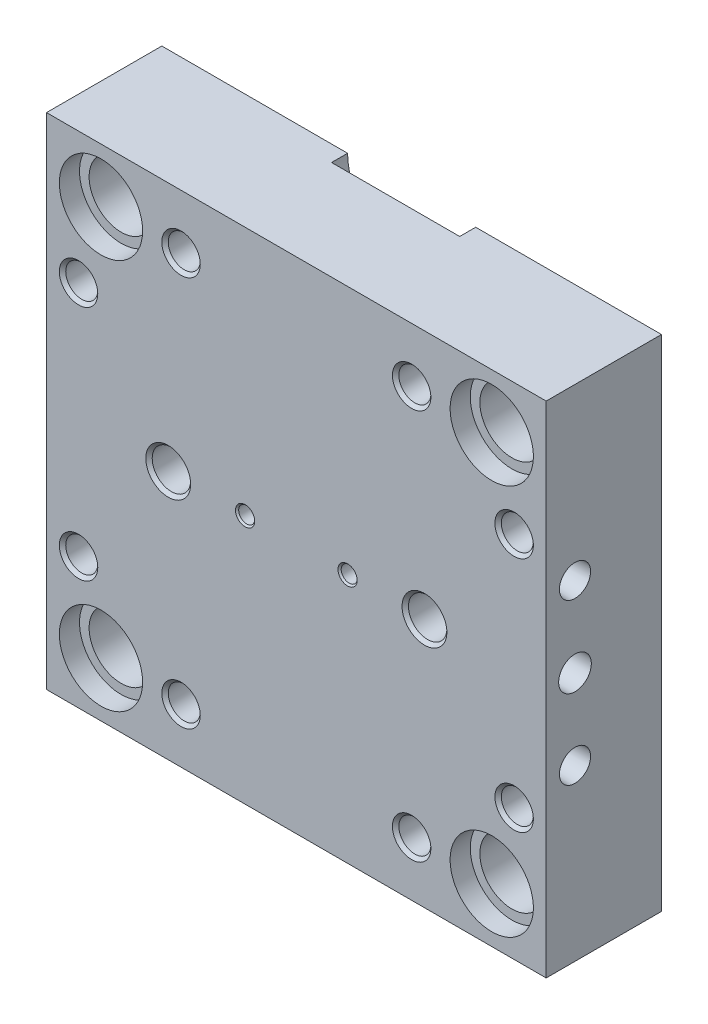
ISO-10303-21;
HEADER;
FILE_DESCRIPTION(('STEP AP214'),'2;1');
FILE_NAME('part.step','',(''),(''),'','','');
FILE_SCHEMA(('AUTOMOTIVE_DESIGN { 1 0 10303 214 1 1 1 1 }'));
ENDSEC;
DATA;
#1=APPLICATION_CONTEXT('core data for automotive mechanical design processes');
#2=APPLICATION_PROTOCOL_DEFINITION('international standard','automotive_design',2000,#1);
#3=PRODUCT_CONTEXT('',#1,'mechanical');
#4=PRODUCT('Part','Part','',(#3));
#5=PRODUCT_RELATED_PRODUCT_CATEGORY('part','',(#4));
#6=PRODUCT_DEFINITION_FORMATION('','',#4);
#7=PRODUCT_DEFINITION_CONTEXT('part definition',#1,'design');
#8=PRODUCT_DEFINITION('design','',#6,#7);
#9=PRODUCT_DEFINITION_SHAPE('','',#8);
#10=(LENGTH_UNIT() NAMED_UNIT(*) SI_UNIT(.MILLI.,.METRE.));
#11=(NAMED_UNIT(*) PLANE_ANGLE_UNIT() SI_UNIT($,.RADIAN.));
#12=(NAMED_UNIT(*) SI_UNIT($,.STERADIAN.) SOLID_ANGLE_UNIT());
#13=UNCERTAINTY_MEASURE_WITH_UNIT(LENGTH_MEASURE(1.E-05),#10,'distance_accuracy_value','');
#14=(GEOMETRIC_REPRESENTATION_CONTEXT(3) GLOBAL_UNCERTAINTY_ASSIGNED_CONTEXT((#13)) GLOBAL_UNIT_ASSIGNED_CONTEXT((#10,
#11,#12)) REPRESENTATION_CONTEXT('',''));
#15=CARTESIAN_POINT('',(0.,0.,0.));
#16=DIRECTION('',(0.,0.,1.));
#17=DIRECTION('',(1.,0.,0.));
#18=AXIS2_PLACEMENT_3D('',#15,#16,#17);
#19=CARTESIAN_POINT('',(-78.,-78.,0.));
#20=DIRECTION('',(0.,0.,1.));
#21=DIRECTION('',(1.,0.,0.));
#22=AXIS2_PLACEMENT_3D('',#19,#20,#21);
#23=PLANE('',#22);
#24=CARTESIAN_POINT('',(61.,-61.,0.));
#25=DIRECTION('',(0.,0.,1.));
#26=DIRECTION('',(-1.,0.,0.));
#27=AXIS2_PLACEMENT_3D('',#24,#25,#26);
#28=CIRCLE('',#27,10.);
#29=CARTESIAN_POINT('',(51.,-61.,0.));
#30=VERTEX_POINT('',#29);
#31=EDGE_CURVE('E528',#30,#30,#28,.T.);
#32=ORIENTED_EDGE('',*,*,#31,.T.);
#33=EDGE_LOOP('',(#32));
#34=FACE_BOUND('',#33,.T.);
#35=CARTESIAN_POINT('',(61.,61.,0.));
#36=DIRECTION('',(0.,0.,-1.));
#37=DIRECTION('',(-1.,0.,0.));
#38=AXIS2_PLACEMENT_3D('',#35,#36,#37);
#39=CIRCLE('',#38,10.);
#40=CARTESIAN_POINT('',(51.,61.,0.));
#41=VERTEX_POINT('',#40);
#42=EDGE_CURVE('E547',#41,#41,#39,.T.);
#43=ORIENTED_EDGE('',*,*,#42,.F.);
#44=EDGE_LOOP('',(#43));
#45=FACE_BOUND('',#44,.T.);
#46=DIRECTION('',(1.,0.,0.));
#47=VECTOR('',#46,1.);
#48=CARTESIAN_POINT('',(-78.,-78.,0.));
#49=LINE('',#48,#47);
#50=CARTESIAN_POINT('',(20.,-78.,0.));
#51=VERTEX_POINT('',#50);
#52=CARTESIAN_POINT('',(78.,-78.,0.));
#53=VERTEX_POINT('',#52);
#54=EDGE_CURVE('E583',#51,#53,#49,.T.);
#55=ORIENTED_EDGE('',*,*,#54,.F.);
#56=CARTESIAN_POINT('',(0.,-78.,0.));
#57=DIRECTION('',(0.,0.,-1.));
#58=DIRECTION('',(-1.,0.,0.));
#59=AXIS2_PLACEMENT_3D('',#56,#57,#58);
#60=CIRCLE('',#59,20.);
#61=CARTESIAN_POINT('',(-20.,-78.,0.));
#62=VERTEX_POINT('',#61);
#63=EDGE_CURVE('E446',#62,#51,#60,.T.);
#64=ORIENTED_EDGE('',*,*,#63,.F.);
#65=CARTESIAN_POINT('',(-78.,-78.,0.));
#66=VERTEX_POINT('',#65);
#67=EDGE_CURVE('E584',#66,#62,#49,.T.);
#68=ORIENTED_EDGE('',*,*,#67,.F.);
#69=DIRECTION('',(0.,-1.,0.));
#70=VECTOR('',#69,1.);
#71=CARTESIAN_POINT('',(-78.,78.,0.));
#72=LINE('',#71,#70);
#73=CARTESIAN_POINT('',(-78.,78.,0.));
#74=VERTEX_POINT('',#73);
#75=EDGE_CURVE('E569',#74,#66,#72,.T.);
#76=ORIENTED_EDGE('',*,*,#75,.F.);
#77=DIRECTION('',(-1.,0.,0.));
#78=VECTOR('',#77,1.);
#79=CARTESIAN_POINT('',(-78.,78.,0.));
#80=LINE('',#79,#78);
#81=CARTESIAN_POINT('',(-20.,78.,0.));
#82=VERTEX_POINT('',#81);
#83=EDGE_CURVE('E589',#82,#74,#80,.T.);
#84=ORIENTED_EDGE('',*,*,#83,.F.);
#85=CARTESIAN_POINT('',(0.,78.,0.));
#86=DIRECTION('',(0.,0.,-1.));
#87=DIRECTION('',(-1.,0.,0.));
#88=AXIS2_PLACEMENT_3D('',#85,#86,#87);
#89=CIRCLE('',#88,20.);
#90=CARTESIAN_POINT('',(20.,78.,0.));
#91=VERTEX_POINT('',#90);
#92=EDGE_CURVE('E456',#91,#82,#89,.T.);
#93=ORIENTED_EDGE('',*,*,#92,.F.);
#94=CARTESIAN_POINT('',(78.,78.,0.));
#95=VERTEX_POINT('',#94);
#96=EDGE_CURVE('E574',#95,#91,#80,.T.);
#97=ORIENTED_EDGE('',*,*,#96,.F.);
#98=DIRECTION('',(0.,1.,0.));
#99=VECTOR('',#98,1.);
#100=CARTESIAN_POINT('',(78.,78.,0.));
#101=LINE('',#100,#99);
#102=EDGE_CURVE('E587',#53,#95,#101,.T.);
#103=ORIENTED_EDGE('',*,*,#102,.F.);
#104=EDGE_LOOP('',(#55,#64,#68,#76,#84,#93,#97,#103));
#105=FACE_BOUND('',#104,.T.);
#106=CARTESIAN_POINT('',(-61.,61.,0.));
#107=DIRECTION('',(0.,0.,1.));
#108=DIRECTION('',(1.,0.,0.));
#109=AXIS2_PLACEMENT_3D('',#106,#107,#108);
#110=CIRCLE('',#109,10.);
#111=CARTESIAN_POINT('',(-51.,61.,0.));
#112=VERTEX_POINT('',#111);
#113=EDGE_CURVE('E566',#112,#112,#110,.T.);
#114=ORIENTED_EDGE('',*,*,#113,.T.);
#115=EDGE_LOOP('',(#114));
#116=FACE_BOUND('',#115,.T.);
#117=CARTESIAN_POINT('',(-61.,-61.,0.));
#118=DIRECTION('',(0.,0.,-1.));
#119=DIRECTION('',(1.,0.,0.));
#120=AXIS2_PLACEMENT_3D('',#117,#118,#119);
#121=CIRCLE('',#120,10.);
#122=CARTESIAN_POINT('',(-51.,-61.,0.));
#123=VERTEX_POINT('',#122);
#124=EDGE_CURVE('E509',#123,#123,#121,.T.);
#125=ORIENTED_EDGE('',*,*,#124,.F.);
#126=EDGE_LOOP('',(#125));
#127=FACE_BOUND('',#126,.T.);
#128=CARTESIAN_POINT('',(68.,37.,0.));
#129=DIRECTION('',(0.,0.,-1.));
#130=DIRECTION('',(-1.,0.,0.));
#131=AXIS2_PLACEMENT_3D('',#128,#129,#130);
#132=CIRCLE('',#131,4.99999999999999);
#133=CARTESIAN_POINT('',(63.,37.,0.));
#134=VERTEX_POINT('',#133);
#135=EDGE_CURVE('E443',#134,#134,#132,.T.);
#136=ORIENTED_EDGE('',*,*,#135,.F.);
#137=EDGE_LOOP('',(#136));
#138=FACE_BOUND('',#137,.T.);
#139=CARTESIAN_POINT('',(-68.,37.,0.));
#140=DIRECTION('',(0.,0.,-1.));
#141=DIRECTION('',(-1.,0.,0.));
#142=AXIS2_PLACEMENT_3D('',#139,#140,#141);
#143=CIRCLE('',#142,4.99999999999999);
#144=CARTESIAN_POINT('',(-73.,37.,0.));
#145=VERTEX_POINT('',#144);
#146=EDGE_CURVE('E440',#145,#145,#143,.T.);
#147=ORIENTED_EDGE('',*,*,#146,.F.);
#148=EDGE_LOOP('',(#147));
#149=FACE_BOUND('',#148,.T.);
#150=CARTESIAN_POINT('',(-68.,-37.,0.));
#151=DIRECTION('',(0.,0.,-1.));
#152=DIRECTION('',(-1.,0.,0.));
#153=AXIS2_PLACEMENT_3D('',#150,#151,#152);
#154=CIRCLE('',#153,4.99999999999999);
#155=CARTESIAN_POINT('',(-73.,-37.,0.));
#156=VERTEX_POINT('',#155);
#157=EDGE_CURVE('E437',#156,#156,#154,.T.);
#158=ORIENTED_EDGE('',*,*,#157,.F.);
#159=EDGE_LOOP('',(#158));
#160=FACE_BOUND('',#159,.T.);
#161=CARTESIAN_POINT('',(68.,-37.,0.));
#162=DIRECTION('',(0.,0.,-1.));
#163=DIRECTION('',(-1.,0.,0.));
#164=AXIS2_PLACEMENT_3D('',#161,#162,#163);
#165=CIRCLE('',#164,4.99999999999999);
#166=CARTESIAN_POINT('',(63.,-37.,0.));
#167=VERTEX_POINT('',#166);
#168=EDGE_CURVE('E434',#167,#167,#165,.T.);
#169=ORIENTED_EDGE('',*,*,#168,.F.);
#170=EDGE_LOOP('',(#169));
#171=FACE_BOUND('',#170,.T.);
#172=DIRECTION('',(1.,0.,0.));
#173=VECTOR('',#172,1.);
#174=CARTESIAN_POINT('',(-29.,-1.,0.));
#175=LINE('',#174,#173);
#176=CARTESIAN_POINT('',(-27.5400642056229,-1.,0.));
#177=VERTEX_POINT('',#176);
#178=CARTESIAN_POINT('',(-24.2912878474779,-1.,0.));
#179=VERTEX_POINT('',#178);
#180=EDGE_CURVE('E1823',#177,#179,#175,.T.);
#181=ORIENTED_EDGE('',*,*,#180,.T.);
#182=CARTESIAN_POINT('',(-22.,0.,0.));
#183=DIRECTION('',(0.,0.,-1.));
#184=DIRECTION('',(1.,0.,0.));
#185=AXIS2_PLACEMENT_3D('',#182,#183,#184);
#186=CIRCLE('',#185,2.5);
#187=CARTESIAN_POINT('',(-22.,-2.5,0.));
#188=VERTEX_POINT('',#187);
#189=EDGE_CURVE('E243',#188,#179,#186,.T.);
#190=ORIENTED_EDGE('',*,*,#189,.F.);
#191=DIRECTION('',(-1.,0.,0.));
#192=VECTOR('',#191,1.);
#193=CARTESIAN_POINT('',(22.,-2.5,0.));
#194=LINE('',#193,#192);
#195=CARTESIAN_POINT('',(22.,-2.5,0.));
#196=VERTEX_POINT('',#195);
#197=EDGE_CURVE('E474',#196,#188,#194,.T.);
#198=ORIENTED_EDGE('',*,*,#197,.F.);
#199=CARTESIAN_POINT('',(22.,0.,0.));
#200=DIRECTION('',(0.,0.,-1.));
#201=DIRECTION('',(-1.,0.,0.));
#202=AXIS2_PLACEMENT_3D('',#199,#200,#201);
#203=CIRCLE('',#202,2.5);
#204=CARTESIAN_POINT('',(24.2912878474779,-1.,0.));
#205=VERTEX_POINT('',#204);
#206=EDGE_CURVE('E475',#205,#196,#203,.T.);
#207=ORIENTED_EDGE('',*,*,#206,.F.);
#208=DIRECTION('',(-1.,0.,0.));
#209=VECTOR('',#208,1.);
#210=CARTESIAN_POINT('',(29.,-1.,0.));
#211=LINE('',#210,#209);
#212=CARTESIAN_POINT('',(27.5400642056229,-1.,0.));
#213=VERTEX_POINT('',#212);
#214=EDGE_CURVE('E264',#213,#205,#211,.T.);
#215=ORIENTED_EDGE('',*,*,#214,.F.);
#216=CARTESIAN_POINT('',(40.,0.,0.));
#217=DIRECTION('',(0.,0.,1.));
#218=DIRECTION('',(1.,0.,0.));
#219=AXIS2_PLACEMENT_3D('',#216,#217,#218);
#220=CIRCLE('',#219,12.5);
#221=CARTESIAN_POINT('',(27.5400642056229,0.999999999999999,0.));
#222=VERTEX_POINT('',#221);
#223=EDGE_CURVE('E290',#222,#213,#220,.F.);
#224=ORIENTED_EDGE('',*,*,#223,.F.);
#225=DIRECTION('',(1.,0.,0.));
#226=VECTOR('',#225,1.);
#227=CARTESIAN_POINT('',(29.,0.999999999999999,0.));
#228=LINE('',#227,#226);
#229=CARTESIAN_POINT('',(24.2912878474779,1.,0.));
#230=VERTEX_POINT('',#229);
#231=EDGE_CURVE('E261',#230,#222,#228,.T.);
#232=ORIENTED_EDGE('',*,*,#231,.F.);
#233=CARTESIAN_POINT('',(22.,2.5,0.));
#234=VERTEX_POINT('',#233);
#235=EDGE_CURVE('E471',#234,#230,#203,.T.);
#236=ORIENTED_EDGE('',*,*,#235,.F.);
#237=DIRECTION('',(1.,0.,0.));
#238=VECTOR('',#237,1.);
#239=CARTESIAN_POINT('',(22.,2.5,0.));
#240=LINE('',#239,#238);
#241=CARTESIAN_POINT('',(-22.,2.5,0.));
#242=VERTEX_POINT('',#241);
#243=EDGE_CURVE('E480',#242,#234,#240,.T.);
#244=ORIENTED_EDGE('',*,*,#243,.F.);
#245=CARTESIAN_POINT('',(-24.2912878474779,1.,0.));
#246=VERTEX_POINT('',#245);
#247=EDGE_CURVE('E478',#246,#242,#186,.T.);
#248=ORIENTED_EDGE('',*,*,#247,.F.);
#249=DIRECTION('',(-1.,0.,0.));
#250=VECTOR('',#249,1.);
#251=CARTESIAN_POINT('',(-29.,0.999999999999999,0.));
#252=LINE('',#251,#250);
#253=CARTESIAN_POINT('',(-27.5400642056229,0.999999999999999,0.));
#254=VERTEX_POINT('',#253);
#255=EDGE_CURVE('E1827',#246,#254,#252,.T.);
#256=ORIENTED_EDGE('',*,*,#255,.T.);
#257=CARTESIAN_POINT('',(-40.,0.,0.));
#258=DIRECTION('',(0.,0.,1.));
#259=DIRECTION('',(1.,0.,0.));
#260=AXIS2_PLACEMENT_3D('',#257,#258,#259);
#261=CIRCLE('',#260,12.5);
#262=EDGE_CURVE('E266',#177,#254,#261,.F.);
#263=ORIENTED_EDGE('',*,*,#262,.F.);
#264=EDGE_LOOP('',(#181,#190,#198,#207,#215,#224,#232,#236,#244,#248,#256,#263));
#265=FACE_BOUND('',#264,.T.);
#266=ADVANCED_FACE('F40',(#34,#45,#105,#116,#127,#138,#149,#160,#171,#265),#23,.F.);
#267=CARTESIAN_POINT('',(-22.,0.,4.));
#268=DIRECTION('',(0.,0.,-1.));
#269=DIRECTION('',(-1.,0.,0.));
#270=AXIS2_PLACEMENT_3D('',#267,#268,#269);
#271=CYLINDRICAL_SURFACE('',#270,2.5);
#272=DIRECTION('',(0.,0.,-1.));
#273=VECTOR('',#272,1.);
#274=CARTESIAN_POINT('',(-24.2912878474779,-1.,4.));
#275=LINE('',#274,#273);
#276=CARTESIAN_POINT('',(-24.2912878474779,-1.,0.6));
#277=VERTEX_POINT('',#276);
#278=EDGE_CURVE('E236',#277,#179,#275,.T.);
#279=ORIENTED_EDGE('',*,*,#278,.F.);
#280=CARTESIAN_POINT('',(-22.,0.,0.6));
#281=DIRECTION('',(0.,0.,-1.));
#282=DIRECTION('',(-1.,0.,0.));
#283=AXIS2_PLACEMENT_3D('',#280,#281,#282);
#284=CIRCLE('',#283,2.5);
#285=CARTESIAN_POINT('',(-24.2912878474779,1.,0.6));
#286=VERTEX_POINT('',#285);
#287=EDGE_CURVE('E225',#286,#277,#284,.F.);
#288=ORIENTED_EDGE('',*,*,#287,.F.);
#289=DIRECTION('',(0.,0.,-1.));
#290=VECTOR('',#289,1.);
#291=CARTESIAN_POINT('',(-24.2912878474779,1.,4.));
#292=LINE('',#291,#290);
#293=EDGE_CURVE('E251',#246,#286,#292,.F.);
#294=ORIENTED_EDGE('',*,*,#293,.F.);
#295=ORIENTED_EDGE('',*,*,#247,.T.);
#296=DIRECTION('',(0.,0.,-1.));
#297=VECTOR('',#296,1.);
#298=CARTESIAN_POINT('',(-22.,2.5,4.));
#299=LINE('',#298,#297);
#300=CARTESIAN_POINT('',(-22.,2.5,1.5));
#301=VERTEX_POINT('',#300);
#302=EDGE_CURVE('E487',#301,#242,#299,.T.);
#303=ORIENTED_EDGE('',*,*,#302,.F.);
#304=CARTESIAN_POINT('',(-22.,0.,1.5));
#305=DIRECTION('',(0.,0.,-1.));
#306=DIRECTION('',(-1.,0.,0.));
#307=AXIS2_PLACEMENT_3D('',#304,#305,#306);
#308=CIRCLE('',#307,2.5);
#309=CARTESIAN_POINT('',(-22.,-2.5,1.5));
#310=VERTEX_POINT('',#309);
#311=EDGE_CURVE('E614',#301,#310,#308,.F.);
#312=ORIENTED_EDGE('',*,*,#311,.T.);
#313=DIRECTION('',(0.,0.,-1.));
#314=VECTOR('',#313,1.);
#315=CARTESIAN_POINT('',(-22.,-2.5,4.));
#316=LINE('',#315,#314);
#317=EDGE_CURVE('E490',#310,#188,#316,.T.);
#318=ORIENTED_EDGE('',*,*,#317,.T.);
#319=ORIENTED_EDGE('',*,*,#189,.T.);
#320=EDGE_LOOP('',(#279,#288,#294,#295,#303,#312,#318,#319));
#321=FACE_BOUND('',#320,.T.);
#322=ADVANCED_FACE('F241',(#321),#271,.F.);
#323=CARTESIAN_POINT('',(-40.,0.,-3.99999999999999));
#324=DIRECTION('',(0.,0.,-1.));
#325=DIRECTION('',(-0.834625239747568,-0.550818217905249,0.));
#326=AXIS2_PLACEMENT_3D('',#323,#324,#325);
#327=CYLINDRICAL_SURFACE('',#326,12.5);
#328=CARTESIAN_POINT('',(-40.,0.,0.200000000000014));
#329=DIRECTION('',(0.,0.,1.));
#330=DIRECTION('',(-0.834625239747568,-0.550818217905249,0.));
#331=AXIS2_PLACEMENT_3D('',#328,#329,#330);
#332=CIRCLE('',#331,12.5);
#333=CARTESIAN_POINT('',(-27.5400642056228,0.999999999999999,0.200000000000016));
#334=VERTEX_POINT('',#333);
#335=CARTESIAN_POINT('',(-27.5400642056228,-1.,0.200000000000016));
#336=VERTEX_POINT('',#335);
#337=EDGE_CURVE('E244',#334,#336,#332,.T.);
#338=ORIENTED_EDGE('',*,*,#337,.T.);
#339=DIRECTION('',(0.,0.,-1.));
#340=VECTOR('',#339,1.);
#341=CARTESIAN_POINT('',(-27.5400642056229,-1.,-3.99999999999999));
#342=LINE('',#341,#340);
#343=EDGE_CURVE('E245',#336,#177,#342,.T.);
#344=ORIENTED_EDGE('',*,*,#343,.T.);
#345=ORIENTED_EDGE('',*,*,#262,.T.);
#346=DIRECTION('',(0.,0.,-1.));
#347=VECTOR('',#346,1.);
#348=CARTESIAN_POINT('',(-27.5400642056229,0.999999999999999,-3.99999999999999));
#349=LINE('',#348,#347);
#350=EDGE_CURVE('E232',#254,#334,#349,.F.);
#351=ORIENTED_EDGE('',*,*,#350,.T.);
#352=EDGE_LOOP('',(#338,#344,#345,#351));
#353=FACE_BOUND('',#352,.T.);
#354=ADVANCED_FACE('F730',(#353),#327,.F.);
#355=CARTESIAN_POINT('',(-40.,0.,0.200000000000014));
#356=DIRECTION('',(0.,0.,-1.));
#357=DIRECTION('',(-0.834625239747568,-0.550818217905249,0.));
#358=AXIS2_PLACEMENT_3D('',#355,#356,#357);
#359=TOROIDAL_SURFACE('',#358,8.7,3.8);
#360=CARTESIAN_POINT('',(-40.,0.,4.00000000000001));
#361=DIRECTION('',(0.,0.,1.));
#362=DIRECTION('',(-0.834625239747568,-0.550818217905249,0.));
#363=AXIS2_PLACEMENT_3D('',#360,#361,#362);
#364=CIRCLE('',#363,8.7);
#365=CARTESIAN_POINT('',(-47.2612395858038,-4.79211849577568,4.00000000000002));
#366=VERTEX_POINT('',#365);
#367=EDGE_CURVE('E248',#366,#366,#364,.T.);
#368=ORIENTED_EDGE('',*,*,#367,.T.);
#369=EDGE_LOOP('',(#368));
#370=FACE_BOUND('',#369,.T.);
#371=CARTESIAN_POINT('',(-40.,0.,0.6));
#372=DIRECTION('',(0.,0.,-1.));
#373=DIRECTION('',(-1.,0.,0.));
#374=AXIS2_PLACEMENT_3D('',#371,#372,#373);
#375=CIRCLE('',#374,12.4788887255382);
#376=CARTESIAN_POINT('',(-27.5612434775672,0.999999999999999,0.6));
#377=VERTEX_POINT('',#376);
#378=CARTESIAN_POINT('',(-27.5612434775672,-1.,0.6));
#379=VERTEX_POINT('',#378);
#380=EDGE_CURVE('E1885',#377,#379,#375,.T.);
#381=ORIENTED_EDGE('',*,*,#380,.T.);
#382=CARTESIAN_POINT('',(-27.5457676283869,-1.,0.407785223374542));
#383=CARTESIAN_POINT('',(-27.5341006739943,-1.,0.195248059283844));
#384=CARTESIAN_POINT('',(-27.540381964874,-1.,-0.0184299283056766));
#385=CARTESIAN_POINT('',(-27.5887529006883,-1.,-0.441872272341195));
#386=CARTESIAN_POINT('',(-27.630885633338,-1.,-0.651631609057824));
#387=CARTESIAN_POINT('',(-27.7497547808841,-1.,-1.06100697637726));
#388=CARTESIAN_POINT('',(-27.8264732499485,-1.,-1.26062820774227));
#389=CARTESIAN_POINT('',(-28.0122853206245,-1.,-1.64411735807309));
#390=CARTESIAN_POINT('',(-28.1213709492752,-1.,-1.82798914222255));
#391=CARTESIAN_POINT('',(-28.3689277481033,-1.,-2.17504310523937));
#392=CARTESIAN_POINT('',(-28.5074293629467,-1.,-2.33820356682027));
#393=CARTESIAN_POINT('',(-28.8097954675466,-1.,-2.63904046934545));
#394=CARTESIAN_POINT('',(-28.9736611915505,-1.,-2.7767156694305));
#395=CARTESIAN_POINT('',(-29.322575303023,-1.,-3.02309546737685));
#396=CARTESIAN_POINT('',(-29.5076814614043,-1.,-3.13171824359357));
#397=CARTESIAN_POINT('',(-29.8934408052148,-1.,-3.31649907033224));
#398=CARTESIAN_POINT('',(-30.0940942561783,-1.,-3.39265656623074));
#399=CARTESIAN_POINT('',(-30.5061942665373,-1.,-3.51072310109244));
#400=CARTESIAN_POINT('',(-30.7176845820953,-1.,-3.55247938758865));
#401=CARTESIAN_POINT('',(-31.1446651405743,-1.,-3.60010955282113));
#402=CARTESIAN_POINT('',(-31.3601554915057,-1.,-3.60598246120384));
#403=CARTESIAN_POINT('',(-31.79033093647,-1.,-3.58171820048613));
#404=CARTESIAN_POINT('',(-32.0050044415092,-1.,-3.55137560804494));
#405=CARTESIAN_POINT('',(-32.4262767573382,-1.,-3.45528482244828));
#406=CARTESIAN_POINT('',(-32.6328752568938,-1.,-3.38953526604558));
#407=CARTESIAN_POINT('',(-33.0333249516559,-1.,-3.22407062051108));
#408=CARTESIAN_POINT('',(-33.2270999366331,-1.,-3.12417104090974));
#409=CARTESIAN_POINT('',(-33.5951735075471,-1.,-2.89330328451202));
#410=CARTESIAN_POINT('',(-33.7694714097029,-1.,-2.76233401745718));
#411=CARTESIAN_POINT('',(-34.0937907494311,-1.,-2.47276263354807));
#412=CARTESIAN_POINT('',(-34.2437800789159,-1.,-2.31412453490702));
#413=CARTESIAN_POINT('',(-34.5147255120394,-1.,-1.9737239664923));
#414=CARTESIAN_POINT('',(-34.6356825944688,-1.,-1.79196227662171));
#415=CARTESIAN_POINT('',(-34.8438183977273,-1.,-1.4121200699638));
#416=CARTESIAN_POINT('',(-34.9312878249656,-1.,-1.2141989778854));
#417=CARTESIAN_POINT('',(-35.0710422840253,-1.,-0.806305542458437));
#418=CARTESIAN_POINT('',(-35.1233324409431,-1.,-0.596334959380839));
#419=CARTESIAN_POINT('',(-35.1902663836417,-1.,-0.174454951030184));
#420=CARTESIAN_POINT('',(-35.2055871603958,-1.,0.0373471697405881));
#421=CARTESIAN_POINT('',(-35.2000218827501,-1.,0.460465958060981));
#422=CARTESIAN_POINT('',(-35.1791383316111,-1.,0.67178265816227));
#423=CARTESIAN_POINT('',(-35.1023215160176,-1.,1.08560057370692));
#424=CARTESIAN_POINT('',(-35.0467628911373,-1.,1.28817158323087));
#425=CARTESIAN_POINT('',(-34.9027811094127,-1.,1.68126991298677));
#426=CARTESIAN_POINT('',(-34.8143558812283,-1.,1.87179647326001));
#427=CARTESIAN_POINT('',(-34.6062885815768,-1.,2.2376390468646));
#428=CARTESIAN_POINT('',(-34.4863252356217,-1.,2.41277221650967));
#429=CARTESIAN_POINT('',(-34.2191984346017,-1.,2.7408917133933));
#430=CARTESIAN_POINT('',(-34.072032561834,-1.,2.89387606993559));
#431=CARTESIAN_POINT('',(-33.7517244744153,-1.,3.17625472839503));
#432=CARTESIAN_POINT('',(-33.5781555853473,-1.,3.30516526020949));
#433=CARTESIAN_POINT('',(-33.2120027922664,-1.,3.53234351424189));
#434=CARTESIAN_POINT('',(-33.0194178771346,-1.,3.63060960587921));
#435=CARTESIAN_POINT('',(-32.6187187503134,-1.,3.79453292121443));
#436=CARTESIAN_POINT('',(-32.4104761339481,-1.,3.85987654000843));
#437=CARTESIAN_POINT('',(-31.9859682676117,-1.,3.95464554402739));
#438=CARTESIAN_POINT('',(-31.7697029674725,-1.,3.98407070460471));
#439=CARTESIAN_POINT('',(-31.3354873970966,-1.,4.00605832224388));
#440=CARTESIAN_POINT('',(-31.1175387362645,-1.,3.99865246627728));
#441=CARTESIAN_POINT('',(-30.6860176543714,-1.,3.94714890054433));
#442=CARTESIAN_POINT('',(-30.4724451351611,-1.,3.90305201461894));
#443=CARTESIAN_POINT('',(-30.0569690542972,-1.,3.77966168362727));
#444=CARTESIAN_POINT('',(-29.8550089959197,-1.,3.7005584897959));
#445=CARTESIAN_POINT('',(-29.4673579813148,-1.,3.50937850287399));
#446=CARTESIAN_POINT('',(-29.2816658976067,-1.,3.39730399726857));
#447=CARTESIAN_POINT('',(-28.9329625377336,-1.,3.14408174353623));
#448=CARTESIAN_POINT('',(-28.7698247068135,-1.,3.00310824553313));
#449=CARTESIAN_POINT('',(-28.4696237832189,-1.,2.69562082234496));
#450=CARTESIAN_POINT('',(-28.3325665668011,-1.,2.52910115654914));
#451=CARTESIAN_POINT('',(-28.0890514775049,-1.,2.17603099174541));
#452=CARTESIAN_POINT('',(-27.9824730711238,-1.,1.98956351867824));
#453=CARTESIAN_POINT('',(-27.8023578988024,-1.,1.6014892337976));
#454=CARTESIAN_POINT('',(-27.7287807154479,-1.,1.39990129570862));
#455=CARTESIAN_POINT('',(-27.6378396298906,-1.,1.06539942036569));
#456=CARTESIAN_POINT('',(-27.6097403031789,-1.,0.9353039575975));
#457=CARTESIAN_POINT('',(-27.5673484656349,-1.,0.672882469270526));
#458=CARTESIAN_POINT('',(-27.5530559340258,-1.,0.540556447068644));
#459=CARTESIAN_POINT('',(-27.5457676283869,-1.,0.407785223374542));
#460=B_SPLINE_CURVE_WITH_KNOTS('',3,(#382,#383,#384,#385,#386,#387,#388,#389,#390,#391,#392,
#393,#394,#395,#396,#397,#398,#399,#400,#401,#402,#403,#404,#405,#406,#407,#408,#409,#410,#411,
#412,#413,#414,#415,#416,#417,#418,#419,#420,#421,#422,#423,#424,#425,#426,#427,#428,#429,#430,
#431,#432,#433,#434,#435,#436,#437,#438,#439,#440,#441,#442,#443,#444,#445,#446,#447,#448,#449,
#450,#451,#452,#453,#454,#455,#456,#457,#458,#459),.UNSPECIFIED.,.T.,.F.,(4,2,2,2,2,2,2,2,2,2,2,
2,2,2,2,2,2,2,2,2,2,2,2,2,2,2,2,2,2,2,2,2,2,2,2,2,2,2,4),(0.,0.638085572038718,1.27693910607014,
1.91546153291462,2.55382680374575,3.1928560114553,3.83191632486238,4.47275794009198,
5.11361050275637,5.75729354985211,6.40099400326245,7.04836310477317,7.69575713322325,
8.3467053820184,8.99767647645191,9.64950052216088,10.3013025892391,10.9473106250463,
11.5932245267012,12.2272174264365,12.8611664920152,13.4883820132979,14.115637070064,
14.7495476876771,15.3835146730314,16.0291014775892,16.6747226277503,17.326382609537,
17.9780466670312,18.6291501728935,19.2802390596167,19.9278320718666,20.5753801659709,
21.2191329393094,21.8630305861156,22.5043454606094,23.1448727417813,23.5434831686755,
23.9420929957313),.UNSPECIFIED.);
#461=EDGE_CURVE('E11',#379,#336,#460,.T.);
#462=ORIENTED_EDGE('',*,*,#461,.T.);
#463=ORIENTED_EDGE('',*,*,#337,.F.);
#464=CARTESIAN_POINT('',(-27.5457676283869,0.999999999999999,0.407785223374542));
#465=CARTESIAN_POINT('',(-27.5574580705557,0.999999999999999,0.620402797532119));
#466=CARTESIAN_POINT('',(-27.5871275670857,0.999999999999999,0.832188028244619));
#467=CARTESIAN_POINT('',(-27.681648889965,0.999999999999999,1.24794040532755));
#468=CARTESIAN_POINT('',(-27.7465432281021,0.999999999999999,1.4518977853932));
#469=CARTESIAN_POINT('',(-27.9096228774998,0.999999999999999,1.84592948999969));
#470=CARTESIAN_POINT('',(-28.0077901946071,0.999999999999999,2.03601125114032));
#471=CARTESIAN_POINT('',(-28.2345781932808,0.999999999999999,2.3969694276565));
#472=CARTESIAN_POINT('',(-28.3631913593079,0.999999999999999,2.56785056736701));
#473=CARTESIAN_POINT('',(-28.6474067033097,0.999999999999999,2.88589668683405));
#474=CARTESIAN_POINT('',(-28.8030466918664,0.999999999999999,3.0330278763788));
#475=CARTESIAN_POINT('',(-29.1367535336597,0.999999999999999,3.29917952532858));
#476=CARTESIAN_POINT('',(-29.3148215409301,0.999999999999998,3.41819853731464));
#477=CARTESIAN_POINT('',(-29.6889453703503,0.999999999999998,3.62518184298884));
#478=CARTESIAN_POINT('',(-29.8850588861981,0.999999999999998,3.71304184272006));
#479=CARTESIAN_POINT('',(-30.2892033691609,0.999999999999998,3.85476802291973));
#480=CARTESIAN_POINT('',(-30.4972345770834,0.999999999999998,3.90863351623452));
#481=CARTESIAN_POINT('',(-30.9203967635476,0.999999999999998,3.98113996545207));
#482=CARTESIAN_POINT('',(-31.1355575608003,0.999999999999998,3.99960685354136));
#483=CARTESIAN_POINT('',(-31.5659420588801,0.999999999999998,4.00038073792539));
#484=CARTESIAN_POINT('',(-31.7811657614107,0.999999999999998,3.98268664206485));
#485=CARTESIAN_POINT('',(-32.206918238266,0.999999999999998,3.91152204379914));
#486=CARTESIAN_POINT('',(-32.4174119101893,0.999999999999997,3.8578415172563));
#487=CARTESIAN_POINT('',(-32.826478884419,0.999999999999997,3.71607421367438));
#488=CARTESIAN_POINT('',(-33.0250517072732,0.999999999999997,3.62798605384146));
#489=CARTESIAN_POINT('',(-33.4056032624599,0.999999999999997,3.41939942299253));
#490=CARTESIAN_POINT('',(-33.5874993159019,0.999999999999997,3.29875005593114));
#491=CARTESIAN_POINT('',(-33.9284367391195,0.999999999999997,3.02859001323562));
#492=CARTESIAN_POINT('',(-34.0874775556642,0.999999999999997,2.87907863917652));
#493=CARTESIAN_POINT('',(-34.37782460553,0.999999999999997,2.55555308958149));
#494=CARTESIAN_POINT('',(-34.5091689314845,0.999999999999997,2.38157312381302));
#495=CARTESIAN_POINT('',(-34.7403479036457,0.999999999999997,2.01379728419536));
#496=CARTESIAN_POINT('',(-34.8401849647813,0.999999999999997,1.82000293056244));
#497=CARTESIAN_POINT('',(-35.0040118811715,0.999999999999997,1.42071121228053));
#498=CARTESIAN_POINT('',(-35.0684456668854,0.999999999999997,1.21539612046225));
#499=CARTESIAN_POINT('',(-35.1611940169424,0.999999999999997,0.796771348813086));
#500=CARTESIAN_POINT('',(-35.1895138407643,0.999999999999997,0.583462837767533));
#501=CARTESIAN_POINT('',(-35.2088484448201,0.999999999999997,0.159112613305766));
#502=CARTESIAN_POINT('',(-35.2005407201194,0.999999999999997,-0.0518984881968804));
#503=CARTESIAN_POINT('',(-35.1484542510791,0.999999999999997,-0.469488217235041));
#504=CARTESIAN_POINT('',(-35.104676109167,0.999999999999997,-0.676066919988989));
#505=CARTESIAN_POINT('',(-34.983383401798,0.999999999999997,-1.07817231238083));
#506=CARTESIAN_POINT('',(-34.9060004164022,0.999999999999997,-1.27373878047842));
#507=CARTESIAN_POINT('',(-34.7199961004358,0.999999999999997,-1.64939873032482));
#508=CARTESIAN_POINT('',(-34.6113722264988,0.999999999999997,-1.82949095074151));
#509=CARTESIAN_POINT('',(-34.36421425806,0.999999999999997,-2.17210660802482));
#510=CARTESIAN_POINT('',(-34.225242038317,0.999999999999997,-2.33431392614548));
#511=CARTESIAN_POINT('',(-33.9224412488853,0.999999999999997,-2.63357787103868));
#512=CARTESIAN_POINT('',(-33.758610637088,0.999999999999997,-2.77063242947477));
#513=CARTESIAN_POINT('',(-33.4077702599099,0.999999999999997,-3.01797802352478));
#514=CARTESIAN_POINT('',(-33.2204226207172,0.999999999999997,-3.12779011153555));
#515=CARTESIAN_POINT('',(-32.8300256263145,0.999999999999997,-3.31460962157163));
#516=CARTESIAN_POINT('',(-32.6269757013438,0.999999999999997,-3.39161585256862));
#517=CARTESIAN_POINT('',(-32.209698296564,0.999999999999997,-3.51095366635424));
#518=CARTESIAN_POINT('',(-31.9954149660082,0.999999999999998,-3.55309015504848));
#519=CARTESIAN_POINT('',(-31.5628090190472,0.999999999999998,-3.60067592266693));
#520=CARTESIAN_POINT('',(-31.3444864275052,0.999999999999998,-3.60612542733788));
#521=CARTESIAN_POINT('',(-30.9106982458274,0.999999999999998,-3.58011193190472));
#522=CARTESIAN_POINT('',(-30.6952260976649,0.999999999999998,-3.54875847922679));
#523=CARTESIAN_POINT('',(-30.2726714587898,0.999999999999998,-3.45010494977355));
#524=CARTESIAN_POINT('',(-30.0655887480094,0.999999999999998,-3.38280581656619));
#525=CARTESIAN_POINT('',(-29.6669754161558,0.999999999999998,-3.21459182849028));
#526=CARTESIAN_POINT('',(-29.4753615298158,0.999999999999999,-3.11387428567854));
#527=CARTESIAN_POINT('',(-29.1118974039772,0.999999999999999,-2.88153438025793));
#528=CARTESIAN_POINT('',(-28.940045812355,0.999999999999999,-2.74991413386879));
#529=CARTESIAN_POINT('',(-28.6219753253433,0.999999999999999,-2.46030130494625));
#530=CARTESIAN_POINT('',(-28.4756196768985,0.999999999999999,-2.30245889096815));
#531=CARTESIAN_POINT('',(-28.211576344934,0.999999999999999,-1.96431300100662));
#532=CARTESIAN_POINT('',(-28.0938951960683,0.999999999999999,-1.78400441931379));
#533=CARTESIAN_POINT('',(-27.891018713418,0.999999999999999,-1.40679030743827));
#534=CARTESIAN_POINT('',(-27.8057114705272,0.999999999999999,-1.20994487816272));
#535=CARTESIAN_POINT('',(-27.6695460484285,0.999999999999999,-0.804862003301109));
#536=CARTESIAN_POINT('',(-27.6186457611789,0.999999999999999,-0.596638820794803));
#537=CARTESIAN_POINT('',(-27.56510303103,0.999999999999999,-0.254661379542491));
#538=CARTESIAN_POINT('',(-27.5514899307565,0.999999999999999,-0.122526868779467));
#539=CARTESIAN_POINT('',(-27.5381793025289,0.999999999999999,0.142441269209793));
#540=CARTESIAN_POINT('',(-27.5384817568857,0.999999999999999,0.275274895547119));
#541=CARTESIAN_POINT('',(-27.5457676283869,0.999999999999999,0.407785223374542));
#542=B_SPLINE_CURVE_WITH_KNOTS('',3,(#464,#465,#466,#467,#468,#469,#470,#471,#472,#473,#474,
#475,#476,#477,#478,#479,#480,#481,#482,#483,#484,#485,#486,#487,#488,#489,#490,#491,#492,#493,
#494,#495,#496,#497,#498,#499,#500,#501,#502,#503,#504,#505,#506,#507,#508,#509,#510,#511,#512,
#513,#514,#515,#516,#517,#518,#519,#520,#521,#522,#523,#524,#525,#526,#527,#528,#529,#530,#531,
#532,#533,#534,#535,#536,#537,#538,#539,#540,#541),.UNSPECIFIED.,.T.,.F.,(4,2,2,2,2,2,2,2,2,2,2,
2,2,2,2,2,2,2,2,2,2,2,2,2,2,2,2,2,2,2,2,2,2,2,2,2,2,2,4),(0.,0.638330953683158,1.27743400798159,
1.91619198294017,2.55479244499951,3.19429361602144,3.83382770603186,4.47548264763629,
5.11715055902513,5.76196577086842,6.40680045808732,7.05543167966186,7.70408897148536,
8.35580549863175,9.00753779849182,9.65836779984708,10.3091479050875,10.9515698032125,
11.5938981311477,12.224395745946,12.8548826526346,13.4829228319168,14.1110141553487,
14.7488554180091,15.3867491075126,16.0351687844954,16.6836120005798,17.335659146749,
17.98770228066,18.637809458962,19.2878995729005,19.9342177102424,20.5804916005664,
21.2231845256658,21.8660237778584,22.5066201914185,23.1464312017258,23.5442607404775,
23.94208977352),.UNSPECIFIED.);
#543=EDGE_CURVE('E52',#334,#377,#542,.T.);
#544=ORIENTED_EDGE('',*,*,#543,.T.);
#545=EDGE_LOOP('',(#381,#462,#463,#544));
#546=FACE_BOUND('',#545,.T.);
#547=ADVANCED_FACE('F1497',(#370,#546),#359,.F.);
#548=CARTESIAN_POINT('',(-40.,0.,36.));
#549=DIRECTION('',(0.,0.,-1.));
#550=DIRECTION('',(-1.,0.,0.));
#551=AXIS2_PLACEMENT_3D('',#548,#549,#550);
#552=CYLINDRICAL_SURFACE('',#551,6.);
#553=CARTESIAN_POINT('',(-40.,0.,35.));
#554=DIRECTION('',(0.,0.,1.));
#555=DIRECTION('',(1.,0.,0.));
#556=AXIS2_PLACEMENT_3D('',#553,#554,#555);
#557=CIRCLE('',#556,6.);
#558=CARTESIAN_POINT('',(-34.,0.,35.));
#559=VERTEX_POINT('',#558);
#560=EDGE_CURVE('E1906',#559,#559,#557,.T.);
#561=ORIENTED_EDGE('',*,*,#560,.T.);
#562=EDGE_LOOP('',(#561));
#563=FACE_BOUND('',#562,.T.);
#564=CARTESIAN_POINT('',(-40.,0.,4.00000000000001));
#565=DIRECTION('',(0.,0.,-1.));
#566=DIRECTION('',(-1.,0.,0.));
#567=AXIS2_PLACEMENT_3D('',#564,#565,#566);
#568=CIRCLE('',#567,6.);
#569=CARTESIAN_POINT('',(-46.,0.,4.00000000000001));
#570=VERTEX_POINT('',#569);
#571=EDGE_CURVE('E257',#570,#570,#568,.F.);
#572=ORIENTED_EDGE('',*,*,#571,.F.);
#573=EDGE_LOOP('',(#572));
#574=FACE_BOUND('',#573,.T.);
#575=ADVANCED_FACE('F1505',(#563,#574),#552,.F.);
#576=CARTESIAN_POINT('',(40.,0.,36.));
#577=DIRECTION('',(0.,0.,-1.));
#578=DIRECTION('',(-1.,0.,0.));
#579=AXIS2_PLACEMENT_3D('',#576,#577,#578);
#580=CYLINDRICAL_SURFACE('',#579,6.);
#581=CARTESIAN_POINT('',(40.,0.,35.));
#582=DIRECTION('',(0.,0.,1.));
#583=DIRECTION('',(1.,0.,0.));
#584=AXIS2_PLACEMENT_3D('',#581,#582,#583);
#585=CIRCLE('',#584,6.);
#586=CARTESIAN_POINT('',(46.,0.,35.));
#587=VERTEX_POINT('',#586);
#588=EDGE_CURVE('E1869',#587,#587,#585,.T.);
#589=ORIENTED_EDGE('',*,*,#588,.T.);
#590=EDGE_LOOP('',(#589));
#591=FACE_BOUND('',#590,.T.);
#592=CARTESIAN_POINT('',(40.,0.,4.00000000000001));
#593=DIRECTION('',(0.,0.,-1.));
#594=DIRECTION('',(-1.,0.,0.));
#595=AXIS2_PLACEMENT_3D('',#592,#593,#594);
#596=CIRCLE('',#595,6.);
#597=CARTESIAN_POINT('',(34.,0.,4.00000000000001));
#598=VERTEX_POINT('',#597);
#599=EDGE_CURVE('E285',#598,#598,#596,.F.);
#600=ORIENTED_EDGE('',*,*,#599,.F.);
#601=EDGE_LOOP('',(#600));
#602=FACE_BOUND('',#601,.T.);
#603=ADVANCED_FACE('F1514',(#591,#602),#580,.F.);
#604=CARTESIAN_POINT('',(-16.,0.,36.));
#605=DIRECTION('',(0.,0.,-1.));
#606=DIRECTION('',(-1.,0.,0.));
#607=AXIS2_PLACEMENT_3D('',#604,#605,#606);
#608=CYLINDRICAL_SURFACE('',#607,2.);
#609=CARTESIAN_POINT('',(-16.,0.,6.5));
#610=DIRECTION('',(0.,0.,1.));
#611=DIRECTION('',(1.,0.,0.));
#612=AXIS2_PLACEMENT_3D('',#609,#610,#611);
#613=CIRCLE('',#612,2.);
#614=CARTESIAN_POINT('',(-14.,0.,6.5));
#615=VERTEX_POINT('',#614);
#616=EDGE_CURVE('E356',#615,#615,#613,.F.);
#617=ORIENTED_EDGE('',*,*,#616,.T.);
#618=EDGE_LOOP('',(#617));
#619=FACE_BOUND('',#618,.T.);
#620=CARTESIAN_POINT('',(-16.,0.,16.));
#621=DIRECTION('',(0.,0.,1.));
#622=DIRECTION('',(1.,0.,0.));
#623=AXIS2_PLACEMENT_3D('',#620,#621,#622);
#624=CIRCLE('',#623,2.);
#625=CARTESIAN_POINT('',(-14.,0.,16.));
#626=VERTEX_POINT('',#625);
#627=EDGE_CURVE('E295',#626,#626,#624,.F.);
#628=ORIENTED_EDGE('',*,*,#627,.F.);
#629=EDGE_LOOP('',(#628));
#630=FACE_BOUND('',#629,.T.);
#631=ADVANCED_FACE('F1536',(#619,#630),#608,.F.);
#632=CARTESIAN_POINT('',(16.,0.,36.));
#633=DIRECTION('',(0.,0.,-1.));
#634=DIRECTION('',(-1.,0.,0.));
#635=AXIS2_PLACEMENT_3D('',#632,#633,#634);
#636=CYLINDRICAL_SURFACE('',#635,2.);
#637=CARTESIAN_POINT('',(16.,0.,6.5));
#638=DIRECTION('',(0.,0.,1.));
#639=DIRECTION('',(1.,0.,0.));
#640=AXIS2_PLACEMENT_3D('',#637,#638,#639);
#641=CIRCLE('',#640,2.);
#642=CARTESIAN_POINT('',(18.,0.,6.5));
#643=VERTEX_POINT('',#642);
#644=EDGE_CURVE('E299',#643,#643,#641,.F.);
#645=ORIENTED_EDGE('',*,*,#644,.T.);
#646=EDGE_LOOP('',(#645));
#647=FACE_BOUND('',#646,.T.);
#648=CARTESIAN_POINT('',(16.,0.,16.));
#649=DIRECTION('',(0.,0.,1.));
#650=DIRECTION('',(1.,0.,0.));
#651=AXIS2_PLACEMENT_3D('',#648,#649,#650);
#652=CIRCLE('',#651,2.);
#653=CARTESIAN_POINT('',(18.,0.,16.));
#654=VERTEX_POINT('',#653);
#655=EDGE_CURVE('E300',#654,#654,#652,.F.);
#656=ORIENTED_EDGE('',*,*,#655,.F.);
#657=EDGE_LOOP('',(#656));
#658=FACE_BOUND('',#657,.T.);
#659=ADVANCED_FACE('F1554',(#647,#658),#636,.F.);
#660=CARTESIAN_POINT('',(-78.,-78.,36.));
#661=DIRECTION('',(0.,0.,1.));
#662=DIRECTION('',(1.,0.,0.));
#663=AXIS2_PLACEMENT_3D('',#660,#661,#662);
#664=PLANE('',#663);
#665=CARTESIAN_POINT('',(68.,-37.,36.));
#666=DIRECTION('',(0.,0.,1.));
#667=DIRECTION('',(1.,0.,0.));
#668=AXIS2_PLACEMENT_3D('',#665,#666,#667);
#669=CIRCLE('',#668,6.00000000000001);
#670=CARTESIAN_POINT('',(74.,-37.,36.));
#671=VERTEX_POINT('',#670);
#672=EDGE_CURVE('E1957',#671,#671,#669,.F.);
#673=ORIENTED_EDGE('',*,*,#672,.T.);
#674=EDGE_LOOP('',(#673));
#675=FACE_BOUND('',#674,.T.);
#676=CARTESIAN_POINT('',(-68.,-37.,36.));
#677=DIRECTION('',(0.,0.,1.));
#678=DIRECTION('',(1.,0.,0.));
#679=AXIS2_PLACEMENT_3D('',#676,#677,#678);
#680=CIRCLE('',#679,6.00000000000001);
#681=CARTESIAN_POINT('',(-62.,-37.,36.));
#682=VERTEX_POINT('',#681);
#683=EDGE_CURVE('E1954',#682,#682,#680,.F.);
#684=ORIENTED_EDGE('',*,*,#683,.T.);
#685=EDGE_LOOP('',(#684));
#686=FACE_BOUND('',#685,.T.);
#687=CARTESIAN_POINT('',(-68.,37.,36.));
#688=DIRECTION('',(0.,0.,1.));
#689=DIRECTION('',(1.,0.,0.));
#690=AXIS2_PLACEMENT_3D('',#687,#688,#689);
#691=CIRCLE('',#690,6.00000000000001);
#692=CARTESIAN_POINT('',(-62.,37.,36.));
#693=VERTEX_POINT('',#692);
#694=EDGE_CURVE('E1951',#693,#693,#691,.F.);
#695=ORIENTED_EDGE('',*,*,#694,.T.);
#696=EDGE_LOOP('',(#695));
#697=FACE_BOUND('',#696,.T.);
#698=CARTESIAN_POINT('',(68.,37.,36.));
#699=DIRECTION('',(0.,0.,1.));
#700=DIRECTION('',(1.,0.,0.));
#701=AXIS2_PLACEMENT_3D('',#698,#699,#700);
#702=CIRCLE('',#701,6.00000000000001);
#703=CARTESIAN_POINT('',(74.,37.,36.));
#704=VERTEX_POINT('',#703);
#705=EDGE_CURVE('E1948',#704,#704,#702,.F.);
#706=ORIENTED_EDGE('',*,*,#705,.T.);
#707=EDGE_LOOP('',(#706));
#708=FACE_BOUND('',#707,.T.);
#709=CARTESIAN_POINT('',(-36.,-61.,36.));
#710=DIRECTION('',(0.,0.,1.));
#711=DIRECTION('',(1.,0.,0.));
#712=AXIS2_PLACEMENT_3D('',#709,#710,#711);
#713=CIRCLE('',#712,6.00000000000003);
#714=CARTESIAN_POINT('',(-30.,-61.,36.));
#715=VERTEX_POINT('',#714);
#716=EDGE_CURVE('E1945',#715,#715,#713,.F.);
#717=ORIENTED_EDGE('',*,*,#716,.T.);
#718=EDGE_LOOP('',(#717));
#719=FACE_BOUND('',#718,.T.);
#720=CARTESIAN_POINT('',(36.,-61.,36.));
#721=DIRECTION('',(0.,0.,1.));
#722=DIRECTION('',(1.,0.,0.));
#723=AXIS2_PLACEMENT_3D('',#720,#721,#722);
#724=CIRCLE('',#723,6.00000000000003);
#725=CARTESIAN_POINT('',(42.,-61.,36.));
#726=VERTEX_POINT('',#725);
#727=EDGE_CURVE('E1942',#726,#726,#724,.F.);
#728=ORIENTED_EDGE('',*,*,#727,.T.);
#729=EDGE_LOOP('',(#728));
#730=FACE_BOUND('',#729,.T.);
#731=CARTESIAN_POINT('',(-36.,61.,36.));
#732=DIRECTION('',(0.,0.,1.));
#733=DIRECTION('',(1.,0.,0.));
#734=AXIS2_PLACEMENT_3D('',#731,#732,#733);
#735=CIRCLE('',#734,6.00000000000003);
#736=CARTESIAN_POINT('',(-30.,61.,36.));
#737=VERTEX_POINT('',#736);
#738=EDGE_CURVE('E1934',#737,#737,#735,.F.);
#739=ORIENTED_EDGE('',*,*,#738,.T.);
#740=EDGE_LOOP('',(#739));
#741=FACE_BOUND('',#740,.T.);
#742=CARTESIAN_POINT('',(36.,61.,36.));
#743=DIRECTION('',(0.,0.,1.));
#744=DIRECTION('',(1.,0.,0.));
#745=AXIS2_PLACEMENT_3D('',#742,#743,#744);
#746=CIRCLE('',#745,6.00000000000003);
#747=CARTESIAN_POINT('',(42.,61.,36.));
#748=VERTEX_POINT('',#747);
#749=EDGE_CURVE('E1930',#748,#748,#746,.F.);
#750=ORIENTED_EDGE('',*,*,#749,.T.);
#751=EDGE_LOOP('',(#750));
#752=FACE_BOUND('',#751,.T.);
#753=CARTESIAN_POINT('',(-16.,0.,36.));
#754=DIRECTION('',(0.,0.,1.));
#755=DIRECTION('',(1.,0.,0.));
#756=AXIS2_PLACEMENT_3D('',#753,#754,#755);
#757=CIRCLE('',#756,2.99999999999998);
#758=CARTESIAN_POINT('',(-13.,0.,36.));
#759=VERTEX_POINT('',#758);
#760=EDGE_CURVE('E1928',#759,#759,#757,.F.);
#761=ORIENTED_EDGE('',*,*,#760,.T.);
#762=EDGE_LOOP('',(#761));
#763=FACE_BOUND('',#762,.T.);
#764=CARTESIAN_POINT('',(16.,0.,36.));
#765=DIRECTION('',(0.,0.,1.));
#766=DIRECTION('',(1.,0.,0.));
#767=AXIS2_PLACEMENT_3D('',#764,#765,#766);
#768=CIRCLE('',#767,2.99999999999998);
#769=CARTESIAN_POINT('',(19.,0.,36.));
#770=VERTEX_POINT('',#769);
#771=EDGE_CURVE('E1931',#770,#770,#768,.F.);
#772=ORIENTED_EDGE('',*,*,#771,.T.);
#773=EDGE_LOOP('',(#772));
#774=FACE_BOUND('',#773,.T.);
#775=CARTESIAN_POINT('',(-40.,0.,36.));
#776=DIRECTION('',(0.,0.,1.));
#777=DIRECTION('',(1.,0.,0.));
#778=AXIS2_PLACEMENT_3D('',#775,#776,#777);
#779=CIRCLE('',#778,6.99999999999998);
#780=CARTESIAN_POINT('',(-33.,0.,36.));
#781=VERTEX_POINT('',#780);
#782=EDGE_CURVE('E1937',#781,#781,#779,.F.);
#783=ORIENTED_EDGE('',*,*,#782,.T.);
#784=EDGE_LOOP('',(#783));
#785=FACE_BOUND('',#784,.T.);
#786=CARTESIAN_POINT('',(40.,0.,36.));
#787=DIRECTION('',(0.,0.,1.));
#788=DIRECTION('',(1.,0.,0.));
#789=AXIS2_PLACEMENT_3D('',#786,#787,#788);
#790=CIRCLE('',#789,6.99999999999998);
#791=CARTESIAN_POINT('',(47.,0.,36.));
#792=VERTEX_POINT('',#791);
#793=EDGE_CURVE('E336',#792,#792,#790,.F.);
#794=ORIENTED_EDGE('',*,*,#793,.T.);
#795=EDGE_LOOP('',(#794));
#796=FACE_BOUND('',#795,.T.);
#797=DIRECTION('',(0.,-1.,0.));
#798=VECTOR('',#797,1.);
#799=CARTESIAN_POINT('',(-78.,78.,36.));
#800=LINE('',#799,#798);
#801=CARTESIAN_POINT('',(-78.,78.,36.));
#802=VERTEX_POINT('',#801);
#803=CARTESIAN_POINT('',(-78.,-78.,36.));
#804=VERTEX_POINT('',#803);
#805=EDGE_CURVE('E570',#802,#804,#800,.T.);
#806=ORIENTED_EDGE('',*,*,#805,.T.);
#807=DIRECTION('',(1.,0.,0.));
#808=VECTOR('',#807,1.);
#809=CARTESIAN_POINT('',(-78.,-78.,36.));
#810=LINE('',#809,#808);
#811=CARTESIAN_POINT('',(78.,-78.,36.));
#812=VERTEX_POINT('',#811);
#813=EDGE_CURVE('E573',#804,#812,#810,.T.);
#814=ORIENTED_EDGE('',*,*,#813,.T.);
#815=DIRECTION('',(0.,1.,0.));
#816=VECTOR('',#815,1.);
#817=CARTESIAN_POINT('',(78.,78.,36.));
#818=LINE('',#817,#816);
#819=CARTESIAN_POINT('',(78.,78.,36.));
#820=VERTEX_POINT('',#819);
#821=EDGE_CURVE('E576',#812,#820,#818,.T.);
#822=ORIENTED_EDGE('',*,*,#821,.T.);
#823=DIRECTION('',(-1.,0.,0.));
#824=VECTOR('',#823,1.);
#825=CARTESIAN_POINT('',(-78.,78.,36.));
#826=LINE('',#825,#824);
#827=EDGE_CURVE('E578',#820,#802,#826,.T.);
#828=ORIENTED_EDGE('',*,*,#827,.T.);
#829=EDGE_LOOP('',(#806,#814,#822,#828));
#830=FACE_BOUND('',#829,.T.);
#831=CARTESIAN_POINT('',(-61.,61.,36.));
#832=DIRECTION('',(0.,0.,1.));
#833=DIRECTION('',(1.,0.,0.));
#834=AXIS2_PLACEMENT_3D('',#831,#832,#833);
#835=CIRCLE('',#834,13.);
#836=CARTESIAN_POINT('',(-48.,61.,36.));
#837=VERTEX_POINT('',#836);
#838=EDGE_CURVE('E559',#837,#837,#835,.T.);
#839=ORIENTED_EDGE('',*,*,#838,.F.);
#840=EDGE_LOOP('',(#839));
#841=FACE_BOUND('',#840,.T.);
#842=CARTESIAN_POINT('',(61.,61.,36.));
#843=DIRECTION('',(0.,0.,-1.));
#844=DIRECTION('',(-1.,0.,0.));
#845=AXIS2_PLACEMENT_3D('',#842,#843,#844);
#846=CIRCLE('',#845,13.);
#847=CARTESIAN_POINT('',(48.,61.,36.));
#848=VERTEX_POINT('',#847);
#849=EDGE_CURVE('E540',#848,#848,#846,.T.);
#850=ORIENTED_EDGE('',*,*,#849,.T.);
#851=EDGE_LOOP('',(#850));
#852=FACE_BOUND('',#851,.T.);
#853=CARTESIAN_POINT('',(61.,-61.,36.));
#854=DIRECTION('',(0.,0.,1.));
#855=DIRECTION('',(-1.,0.,0.));
#856=AXIS2_PLACEMENT_3D('',#853,#854,#855);
#857=CIRCLE('',#856,13.);
#858=CARTESIAN_POINT('',(48.,-61.,36.));
#859=VERTEX_POINT('',#858);
#860=EDGE_CURVE('E521',#859,#859,#857,.T.);
#861=ORIENTED_EDGE('',*,*,#860,.F.);
#862=EDGE_LOOP('',(#861));
#863=FACE_BOUND('',#862,.T.);
#864=CARTESIAN_POINT('',(-61.,-61.,36.));
#865=DIRECTION('',(0.,0.,-1.));
#866=DIRECTION('',(1.,0.,0.));
#867=AXIS2_PLACEMENT_3D('',#864,#865,#866);
#868=CIRCLE('',#867,13.);
#869=CARTESIAN_POINT('',(-48.,-61.,36.));
#870=VERTEX_POINT('',#869);
#871=EDGE_CURVE('E502',#870,#870,#868,.T.);
#872=ORIENTED_EDGE('',*,*,#871,.T.);
#873=EDGE_LOOP('',(#872));
#874=FACE_BOUND('',#873,.T.);
#875=ADVANCED_FACE('F692',(#675,#686,#697,#708,#719,#730,#741,#752,#763,#774,#785,#796,#830,
#841,#852,#863,#874),#664,.T.);
#876=CARTESIAN_POINT('',(-61.,-61.,36.));
#877=DIRECTION('',(0.,0.,-1.));
#878=DIRECTION('',(-1.,0.,0.));
#879=AXIS2_PLACEMENT_3D('',#876,#877,#878);
#880=CYLINDRICAL_SURFACE('',#879,10.);
#881=ORIENTED_EDGE('',*,*,#124,.T.);
#882=EDGE_LOOP('',(#881));
#883=FACE_BOUND('',#882,.T.);
#884=CARTESIAN_POINT('',(-61.,-61.,29.7));
#885=DIRECTION('',(0.,0.,1.));
#886=DIRECTION('',(1.,0.,0.));
#887=AXIS2_PLACEMENT_3D('',#884,#885,#886);
#888=CIRCLE('',#887,10.);
#889=CARTESIAN_POINT('',(-51.,-61.,29.7));
#890=VERTEX_POINT('',#889);
#891=EDGE_CURVE('E506',#890,#890,#888,.F.);
#892=ORIENTED_EDGE('',*,*,#891,.F.);
#893=EDGE_LOOP('',(#892));
#894=FACE_BOUND('',#893,.T.);
#895=ADVANCED_FACE('F1599',(#883,#894),#880,.F.);
#896=CARTESIAN_POINT('',(61.,-61.,36.));
#897=DIRECTION('',(0.,0.,-1.));
#898=DIRECTION('',(-1.,0.,0.));
#899=AXIS2_PLACEMENT_3D('',#896,#897,#898);
#900=CYLINDRICAL_SURFACE('',#899,10.);
#901=ORIENTED_EDGE('',*,*,#31,.F.);
#902=EDGE_LOOP('',(#901));
#903=FACE_BOUND('',#902,.T.);
#904=CARTESIAN_POINT('',(61.,-61.,29.7));
#905=DIRECTION('',(0.,0.,1.));
#906=DIRECTION('',(1.,0.,0.));
#907=AXIS2_PLACEMENT_3D('',#904,#905,#906);
#908=CIRCLE('',#907,10.);
#909=CARTESIAN_POINT('',(71.,-61.,29.7));
#910=VERTEX_POINT('',#909);
#911=EDGE_CURVE('E525',#910,#910,#908,.T.);
#912=ORIENTED_EDGE('',*,*,#911,.T.);
#913=EDGE_LOOP('',(#912));
#914=FACE_BOUND('',#913,.T.);
#915=ADVANCED_FACE('F1608',(#903,#914),#900,.F.);
#916=CARTESIAN_POINT('',(61.,61.,36.));
#917=DIRECTION('',(0.,0.,-1.));
#918=DIRECTION('',(-1.,0.,0.));
#919=AXIS2_PLACEMENT_3D('',#916,#917,#918);
#920=CYLINDRICAL_SURFACE('',#919,10.);
#921=ORIENTED_EDGE('',*,*,#42,.T.);
#922=EDGE_LOOP('',(#921));
#923=FACE_BOUND('',#922,.T.);
#924=CARTESIAN_POINT('',(61.,61.,29.7));
#925=DIRECTION('',(0.,0.,1.));
#926=DIRECTION('',(1.,0.,0.));
#927=AXIS2_PLACEMENT_3D('',#924,#925,#926);
#928=CIRCLE('',#927,10.);
#929=CARTESIAN_POINT('',(71.,61.,29.7));
#930=VERTEX_POINT('',#929);
#931=EDGE_CURVE('E544',#930,#930,#928,.F.);
#932=ORIENTED_EDGE('',*,*,#931,.F.);
#933=EDGE_LOOP('',(#932));
#934=FACE_BOUND('',#933,.T.);
#935=ADVANCED_FACE('F1615',(#923,#934),#920,.F.);
#936=CARTESIAN_POINT('',(-61.,61.,36.));
#937=DIRECTION('',(0.,0.,-1.));
#938=DIRECTION('',(-1.,0.,0.));
#939=AXIS2_PLACEMENT_3D('',#936,#937,#938);
#940=CYLINDRICAL_SURFACE('',#939,10.);
#941=ORIENTED_EDGE('',*,*,#113,.F.);
#942=EDGE_LOOP('',(#941));
#943=FACE_BOUND('',#942,.T.);
#944=CARTESIAN_POINT('',(-61.,61.,29.7));
#945=DIRECTION('',(0.,0.,1.));
#946=DIRECTION('',(1.,0.,0.));
#947=AXIS2_PLACEMENT_3D('',#944,#945,#946);
#948=CIRCLE('',#947,10.);
#949=CARTESIAN_POINT('',(-51.,61.,29.7));
#950=VERTEX_POINT('',#949);
#951=EDGE_CURVE('E563',#950,#950,#948,.T.);
#952=ORIENTED_EDGE('',*,*,#951,.T.);
#953=EDGE_LOOP('',(#952));
#954=FACE_BOUND('',#953,.T.);
#955=ADVANCED_FACE('F674',(#943,#954),#940,.F.);
#956=CARTESIAN_POINT('',(-78.,78.,36.));
#957=DIRECTION('',(1.,0.,0.));
#958=DIRECTION('',(0.,1.,0.));
#959=AXIS2_PLACEMENT_3D('',#956,#957,#958);
#960=PLANE('',#959);
#961=CARTESIAN_POINT('',(-78.,25.,27.));
#962=DIRECTION('',(-1.,0.,0.));
#963=DIRECTION('',(0.,0.,1.));
#964=AXIS2_PLACEMENT_3D('',#961,#962,#963);
#965=CIRCLE('',#964,4.864);
#966=CARTESIAN_POINT('',(-78.,25.,31.864));
#967=VERTEX_POINT('',#966);
#968=EDGE_CURVE('E404',#967,#967,#965,.T.);
#969=ORIENTED_EDGE('',*,*,#968,.F.);
#970=EDGE_LOOP('',(#969));
#971=FACE_BOUND('',#970,.T.);
#972=CARTESIAN_POINT('',(-78.,-25.,27.));
#973=DIRECTION('',(-1.,0.,0.));
#974=DIRECTION('',(0.,0.,1.));
#975=AXIS2_PLACEMENT_3D('',#972,#973,#974);
#976=CIRCLE('',#975,4.864);
#977=CARTESIAN_POINT('',(-78.,-25.,31.864));
#978=VERTEX_POINT('',#977);
#979=EDGE_CURVE('E416',#978,#978,#976,.T.);
#980=ORIENTED_EDGE('',*,*,#979,.F.);
#981=EDGE_LOOP('',(#980));
#982=FACE_BOUND('',#981,.T.);
#983=ORIENTED_EDGE('',*,*,#75,.T.);
#984=DIRECTION('',(0.,0.,-1.));
#985=VECTOR('',#984,1.);
#986=CARTESIAN_POINT('',(-78.,-78.,36.));
#987=LINE('',#986,#985);
#988=EDGE_CURVE('E600',#804,#66,#987,.T.);
#989=ORIENTED_EDGE('',*,*,#988,.F.);
#990=ORIENTED_EDGE('',*,*,#805,.F.);
#991=DIRECTION('',(0.,0.,-1.));
#992=VECTOR('',#991,1.);
#993=CARTESIAN_POINT('',(-78.,78.,36.));
#994=LINE('',#993,#992);
#995=EDGE_CURVE('E580',#802,#74,#994,.T.);
#996=ORIENTED_EDGE('',*,*,#995,.T.);
#997=EDGE_LOOP('',(#983,#989,#990,#996));
#998=FACE_BOUND('',#997,.T.);
#999=ADVANCED_FACE('F347',(#971,#982,#998),#960,.F.);
#1000=CARTESIAN_POINT('',(-78.,-78.,36.));
#1001=DIRECTION('',(0.,1.,0.));
#1002=DIRECTION('',(0.,0.,1.));
#1003=AXIS2_PLACEMENT_3D('',#1000,#1001,#1002);
#1004=PLANE('',#1003);
#1005=DIRECTION('',(-1.,0.,0.));
#1006=VECTOR('',#1005,1.);
#1007=CARTESIAN_POINT('',(20.,-78.,5.));
#1008=LINE('',#1007,#1006);
#1009=CARTESIAN_POINT('',(20.,-78.,5.));
#1010=VERTEX_POINT('',#1009);
#1011=CARTESIAN_POINT('',(-20.,-78.,5.));
#1012=VERTEX_POINT('',#1011);
#1013=EDGE_CURVE('E449',#1010,#1012,#1008,.T.);
#1014=ORIENTED_EDGE('',*,*,#1013,.F.);
#1015=DIRECTION('',(0.,0.,-1.));
#1016=VECTOR('',#1015,1.);
#1017=CARTESIAN_POINT('',(20.,-78.,5.));
#1018=LINE('',#1017,#1016);
#1019=EDGE_CURVE('E452',#1010,#51,#1018,.T.);
#1020=ORIENTED_EDGE('',*,*,#1019,.T.);
#1021=ORIENTED_EDGE('',*,*,#54,.T.);
#1022=DIRECTION('',(0.,0.,-1.));
#1023=VECTOR('',#1022,1.);
#1024=CARTESIAN_POINT('',(78.,-78.,36.));
#1025=LINE('',#1024,#1023);
#1026=EDGE_CURVE('E597',#812,#53,#1025,.T.);
#1027=ORIENTED_EDGE('',*,*,#1026,.F.);
#1028=ORIENTED_EDGE('',*,*,#813,.F.);
#1029=ORIENTED_EDGE('',*,*,#988,.T.);
#1030=ORIENTED_EDGE('',*,*,#67,.T.);
#1031=DIRECTION('',(0.,0.,-1.));
#1032=VECTOR('',#1031,1.);
#1033=CARTESIAN_POINT('',(-20.,-78.,5.));
#1034=LINE('',#1033,#1032);
#1035=EDGE_CURVE('E454',#1012,#62,#1034,.T.);
#1036=ORIENTED_EDGE('',*,*,#1035,.F.);
#1037=EDGE_LOOP('',(#1014,#1020,#1021,#1027,#1028,#1029,#1030,#1036));
#1038=FACE_BOUND('',#1037,.T.);
#1039=ADVANCED_FACE('F673',(#1038),#1004,.F.);
#1040=CARTESIAN_POINT('',(78.,78.,36.));
#1041=DIRECTION('',(-1.,0.,0.));
#1042=DIRECTION('',(0.,0.,1.));
#1043=AXIS2_PLACEMENT_3D('',#1040,#1041,#1042);
#1044=PLANE('',#1043);
#1045=CARTESIAN_POINT('',(78.,25.,27.));
#1046=DIRECTION('',(1.,0.,0.));
#1047=DIRECTION('',(0.,0.,-1.));
#1048=AXIS2_PLACEMENT_3D('',#1045,#1046,#1047);
#1049=CIRCLE('',#1048,4.864);
#1050=CARTESIAN_POINT('',(78.,25.,22.136));
#1051=VERTEX_POINT('',#1050);
#1052=EDGE_CURVE('E380',#1051,#1051,#1049,.T.);
#1053=ORIENTED_EDGE('',*,*,#1052,.F.);
#1054=EDGE_LOOP('',(#1053));
#1055=FACE_BOUND('',#1054,.T.);
#1056=CARTESIAN_POINT('',(78.,-25.,27.));
#1057=DIRECTION('',(1.,0.,0.));
#1058=DIRECTION('',(0.,0.,-1.));
#1059=AXIS2_PLACEMENT_3D('',#1056,#1057,#1058);
#1060=CIRCLE('',#1059,4.864);
#1061=CARTESIAN_POINT('',(78.,-25.,22.136));
#1062=VERTEX_POINT('',#1061);
#1063=EDGE_CURVE('E392',#1062,#1062,#1060,.T.);
#1064=ORIENTED_EDGE('',*,*,#1063,.F.);
#1065=EDGE_LOOP('',(#1064));
#1066=FACE_BOUND('',#1065,.T.);
#1067=CARTESIAN_POINT('',(78.,0.,27.));
#1068=DIRECTION('',(1.,0.,0.));
#1069=DIRECTION('',(0.,0.,-1.));
#1070=AXIS2_PLACEMENT_3D('',#1067,#1068,#1069);
#1071=CIRCLE('',#1070,5.09999999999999);
#1072=CARTESIAN_POINT('',(78.,0.,21.9));
#1073=VERTEX_POINT('',#1072);
#1074=EDGE_CURVE('E431',#1073,#1073,#1071,.T.);
#1075=ORIENTED_EDGE('',*,*,#1074,.F.);
#1076=EDGE_LOOP('',(#1075));
#1077=FACE_BOUND('',#1076,.T.);
#1078=ORIENTED_EDGE('',*,*,#102,.T.);
#1079=DIRECTION('',(0.,0.,-1.));
#1080=VECTOR('',#1079,1.);
#1081=CARTESIAN_POINT('',(78.,78.,36.));
#1082=LINE('',#1081,#1080);
#1083=EDGE_CURVE('E594',#820,#95,#1082,.T.);
#1084=ORIENTED_EDGE('',*,*,#1083,.F.);
#1085=ORIENTED_EDGE('',*,*,#821,.F.);
#1086=ORIENTED_EDGE('',*,*,#1026,.T.);
#1087=EDGE_LOOP('',(#1078,#1084,#1085,#1086));
#1088=FACE_BOUND('',#1087,.T.);
#1089=ADVANCED_FACE('F705',(#1055,#1066,#1077,#1088),#1044,.F.);
#1090=CARTESIAN_POINT('',(-78.,78.,36.));
#1091=DIRECTION('',(0.,-1.,0.));
#1092=DIRECTION('',(0.,0.,-1.));
#1093=AXIS2_PLACEMENT_3D('',#1090,#1091,#1092);
#1094=PLANE('',#1093);
#1095=DIRECTION('',(1.,0.,0.));
#1096=VECTOR('',#1095,1.);
#1097=CARTESIAN_POINT('',(20.,78.,5.));
#1098=LINE('',#1097,#1096);
#1099=CARTESIAN_POINT('',(-20.,78.,5.));
#1100=VERTEX_POINT('',#1099);
#1101=CARTESIAN_POINT('',(20.,78.,5.));
#1102=VERTEX_POINT('',#1101);
#1103=EDGE_CURVE('E461',#1100,#1102,#1098,.T.);
#1104=ORIENTED_EDGE('',*,*,#1103,.F.);
#1105=DIRECTION('',(0.,0.,-1.));
#1106=VECTOR('',#1105,1.);
#1107=CARTESIAN_POINT('',(-20.,78.,5.));
#1108=LINE('',#1107,#1106);
#1109=EDGE_CURVE('E464',#1100,#82,#1108,.T.);
#1110=ORIENTED_EDGE('',*,*,#1109,.T.);
#1111=ORIENTED_EDGE('',*,*,#83,.T.);
#1112=ORIENTED_EDGE('',*,*,#995,.F.);
#1113=ORIENTED_EDGE('',*,*,#827,.F.);
#1114=ORIENTED_EDGE('',*,*,#1083,.T.);
#1115=ORIENTED_EDGE('',*,*,#96,.T.);
#1116=DIRECTION('',(0.,0.,-1.));
#1117=VECTOR('',#1116,1.);
#1118=CARTESIAN_POINT('',(20.,78.,5.));
#1119=LINE('',#1118,#1117);
#1120=EDGE_CURVE('E466',#1102,#91,#1119,.T.);
#1121=ORIENTED_EDGE('',*,*,#1120,.F.);
#1122=EDGE_LOOP('',(#1104,#1110,#1111,#1112,#1113,#1114,#1115,#1121));
#1123=FACE_BOUND('',#1122,.T.);
#1124=ADVANCED_FACE('F698',(#1123),#1094,.F.);
#1125=CARTESIAN_POINT('',(-61.,61.,29.7));
#1126=DIRECTION('',(0.,0.,1.));
#1127=DIRECTION('',(1.,0.,0.));
#1128=AXIS2_PLACEMENT_3D('',#1125,#1126,#1127);
#1129=CYLINDRICAL_SURFACE('',#1128,13.);
#1130=CARTESIAN_POINT('',(-61.,61.,29.7));
#1131=DIRECTION('',(0.,0.,1.));
#1132=DIRECTION('',(1.,0.,0.));
#1133=AXIS2_PLACEMENT_3D('',#1130,#1131,#1132);
#1134=CIRCLE('',#1133,13.);
#1135=CARTESIAN_POINT('',(-48.,61.,29.7));
#1136=VERTEX_POINT('',#1135);
#1137=EDGE_CURVE('E560',#1136,#1136,#1134,.T.);
#1138=ORIENTED_EDGE('',*,*,#1137,.F.);
#1139=EDGE_LOOP('',(#1138));
#1140=FACE_BOUND('',#1139,.T.);
#1141=ORIENTED_EDGE('',*,*,#838,.T.);
#1142=EDGE_LOOP('',(#1141));
#1143=FACE_BOUND('',#1142,.T.);
#1144=ADVANCED_FACE('F738',(#1140,#1143),#1129,.F.);
#1145=CARTESIAN_POINT('',(-61.,61.,29.7));
#1146=DIRECTION('',(0.,0.,1.));
#1147=DIRECTION('',(1.,0.,0.));
#1148=AXIS2_PLACEMENT_3D('',#1145,#1146,#1147);
#1149=PLANE('',#1148);
#1150=ORIENTED_EDGE('',*,*,#951,.F.);
#1151=EDGE_LOOP('',(#1150));
#1152=FACE_BOUND('',#1151,.T.);
#1153=ORIENTED_EDGE('',*,*,#1137,.T.);
#1154=EDGE_LOOP('',(#1153));
#1155=FACE_BOUND('',#1154,.T.);
#1156=ADVANCED_FACE('F762',(#1152,#1155),#1149,.T.);
#1157=CARTESIAN_POINT('',(-36.,61.,36.));
#1158=DIRECTION('',(0.,0.,1.));
#1159=DIRECTION('',(1.,0.,0.));
#1160=AXIS2_PLACEMENT_3D('',#1157,#1158,#1159);
#1161=CYLINDRICAL_SURFACE('',#1160,5.);
#1162=CARTESIAN_POINT('',(-36.,61.,35.));
#1163=DIRECTION('',(0.,0.,1.));
#1164=DIRECTION('',(1.,0.,0.));
#1165=AXIS2_PLACEMENT_3D('',#1162,#1163,#1164);
#1166=CIRCLE('',#1165,5.);
#1167=CARTESIAN_POINT('',(-31.,61.,35.));
#1168=VERTEX_POINT('',#1167);
#1169=EDGE_CURVE('E1978',#1168,#1168,#1166,.T.);
#1170=ORIENTED_EDGE('',*,*,#1169,.T.);
#1171=EDGE_LOOP('',(#1170));
#1172=FACE_BOUND('',#1171,.T.);
#1173=CARTESIAN_POINT('',(-36.,61.,21.));
#1174=DIRECTION('',(0.,0.,1.));
#1175=DIRECTION('',(1.,0.,0.));
#1176=AXIS2_PLACEMENT_3D('',#1173,#1174,#1175);
#1177=CIRCLE('',#1176,5.);
#1178=CARTESIAN_POINT('',(-31.,61.,21.));
#1179=VERTEX_POINT('',#1178);
#1180=EDGE_CURVE('E556',#1179,#1179,#1177,.T.);
#1181=ORIENTED_EDGE('',*,*,#1180,.F.);
#1182=EDGE_LOOP('',(#1181));
#1183=FACE_BOUND('',#1182,.T.);
#1184=ADVANCED_FACE('F771',(#1172,#1183),#1161,.F.);
#1185=CARTESIAN_POINT('',(-31.75,61.,21.));
#1186=DIRECTION('',(0.,0.,-1.));
#1187=DIRECTION('',(-1.,0.,0.));
#1188=AXIS2_PLACEMENT_3D('',#1185,#1186,#1187);
#1189=PLANE('',#1188);
#1190=CARTESIAN_POINT('',(-36.,61.,21.));
#1191=DIRECTION('',(0.,0.,1.));
#1192=DIRECTION('',(1.,0.,0.));
#1193=AXIS2_PLACEMENT_3D('',#1190,#1191,#1192);
#1194=CIRCLE('',#1193,4.25);
#1195=CARTESIAN_POINT('',(-31.75,61.,21.));
#1196=VERTEX_POINT('',#1195);
#1197=EDGE_CURVE('E553',#1196,#1196,#1194,.T.);
#1198=ORIENTED_EDGE('',*,*,#1197,.F.);
#1199=EDGE_LOOP('',(#1198));
#1200=FACE_BOUND('',#1199,.T.);
#1201=ORIENTED_EDGE('',*,*,#1180,.T.);
#1202=EDGE_LOOP('',(#1201));
#1203=FACE_BOUND('',#1202,.T.);
#1204=ADVANCED_FACE('F780',(#1200,#1203),#1189,.F.);
#1205=CARTESIAN_POINT('',(-36.,61.,36.));
#1206=DIRECTION('',(0.,0.,1.));
#1207=DIRECTION('',(1.,0.,0.));
#1208=AXIS2_PLACEMENT_3D('',#1205,#1206,#1207);
#1209=CYLINDRICAL_SURFACE('',#1208,4.25);
#1210=CARTESIAN_POINT('',(-36.,61.,16.));
#1211=DIRECTION('',(0.,0.,1.));
#1212=DIRECTION('',(1.,0.,0.));
#1213=AXIS2_PLACEMENT_3D('',#1210,#1211,#1212);
#1214=CIRCLE('',#1213,4.25);
#1215=CARTESIAN_POINT('',(-31.75,61.,16.));
#1216=VERTEX_POINT('',#1215);
#1217=EDGE_CURVE('E550',#1216,#1216,#1214,.T.);
#1218=ORIENTED_EDGE('',*,*,#1217,.F.);
#1219=EDGE_LOOP('',(#1218));
#1220=FACE_BOUND('',#1219,.T.);
#1221=ORIENTED_EDGE('',*,*,#1197,.T.);
#1222=EDGE_LOOP('',(#1221));
#1223=FACE_BOUND('',#1222,.T.);
#1224=ADVANCED_FACE('F790',(#1220,#1223),#1209,.F.);
#1225=CARTESIAN_POINT('',(-36.,61.,16.));
#1226=DIRECTION('',(0.,0.,1.));
#1227=DIRECTION('',(1.,0.,0.));
#1228=AXIS2_PLACEMENT_3D('',#1225,#1226,#1227);
#1229=CONICAL_SURFACE('',#1228,4.25,1.02974425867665);
#1230=CARTESIAN_POINT('',(-36.,61.,13.4463423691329));
#1231=VERTEX_POINT('',#1230);
#1232=VERTEX_LOOP('',#1231);
#1233=FACE_BOUND('',#1232,.T.);
#1234=ORIENTED_EDGE('',*,*,#1217,.T.);
#1235=EDGE_LOOP('',(#1234));
#1236=FACE_BOUND('',#1235,.T.);
#1237=ADVANCED_FACE('F798',(#1233,#1236),#1229,.F.);
#1238=CARTESIAN_POINT('',(61.,61.,29.7));
#1239=DIRECTION('',(0.,0.,1.));
#1240=DIRECTION('',(-1.,0.,0.));
#1241=AXIS2_PLACEMENT_3D('',#1238,#1239,#1240);
#1242=PLANE('',#1241);
#1243=CARTESIAN_POINT('',(61.,61.,29.7));
#1244=DIRECTION('',(0.,0.,-1.));
#1245=DIRECTION('',(-1.,0.,0.));
#1246=AXIS2_PLACEMENT_3D('',#1243,#1244,#1245);
#1247=CIRCLE('',#1246,13.);
#1248=CARTESIAN_POINT('',(48.,61.,29.7));
#1249=VERTEX_POINT('',#1248);
#1250=EDGE_CURVE('E541',#1249,#1249,#1247,.T.);
#1251=ORIENTED_EDGE('',*,*,#1250,.F.);
#1252=EDGE_LOOP('',(#1251));
#1253=FACE_BOUND('',#1252,.T.);
#1254=ORIENTED_EDGE('',*,*,#931,.T.);
#1255=EDGE_LOOP('',(#1254));
#1256=FACE_BOUND('',#1255,.T.);
#1257=ADVANCED_FACE('F805',(#1253,#1256),#1242,.T.);
#1258=CARTESIAN_POINT('',(61.,61.,29.7));
#1259=DIRECTION('',(0.,0.,1.));
#1260=DIRECTION('',(1.,0.,0.));
#1261=AXIS2_PLACEMENT_3D('',#1258,#1259,#1260);
#1262=CYLINDRICAL_SURFACE('',#1261,13.);
#1263=ORIENTED_EDGE('',*,*,#1250,.T.);
#1264=EDGE_LOOP('',(#1263));
#1265=FACE_BOUND('',#1264,.T.);
#1266=ORIENTED_EDGE('',*,*,#849,.F.);
#1267=EDGE_LOOP('',(#1266));
#1268=FACE_BOUND('',#1267,.T.);
#1269=ADVANCED_FACE('F813',(#1265,#1268),#1262,.F.);
#1270=CARTESIAN_POINT('',(36.,61.,36.));
#1271=DIRECTION('',(0.,0.,1.));
#1272=DIRECTION('',(1.,0.,0.));
#1273=AXIS2_PLACEMENT_3D('',#1270,#1271,#1272);
#1274=CYLINDRICAL_SURFACE('',#1273,5.);
#1275=CARTESIAN_POINT('',(36.,61.,35.));
#1276=DIRECTION('',(0.,0.,1.));
#1277=DIRECTION('',(1.,0.,0.));
#1278=AXIS2_PLACEMENT_3D('',#1275,#1276,#1277);
#1279=CIRCLE('',#1278,5.);
#1280=CARTESIAN_POINT('',(41.,61.,35.));
#1281=VERTEX_POINT('',#1280);
#1282=EDGE_CURVE('E1910',#1281,#1281,#1279,.T.);
#1283=ORIENTED_EDGE('',*,*,#1282,.T.);
#1284=EDGE_LOOP('',(#1283));
#1285=FACE_BOUND('',#1284,.T.);
#1286=CARTESIAN_POINT('',(36.,61.,21.));
#1287=DIRECTION('',(0.,0.,1.));
#1288=DIRECTION('',(1.,0.,0.));
#1289=AXIS2_PLACEMENT_3D('',#1286,#1287,#1288);
#1290=CIRCLE('',#1289,5.);
#1291=CARTESIAN_POINT('',(41.,61.,21.));
#1292=VERTEX_POINT('',#1291);
#1293=EDGE_CURVE('E537',#1292,#1292,#1290,.T.);
#1294=ORIENTED_EDGE('',*,*,#1293,.F.);
#1295=EDGE_LOOP('',(#1294));
#1296=FACE_BOUND('',#1295,.T.);
#1297=ADVANCED_FACE('F822',(#1285,#1296),#1274,.F.);
#1298=CARTESIAN_POINT('',(40.25,61.,21.));
#1299=DIRECTION('',(0.,0.,-1.));
#1300=DIRECTION('',(-1.,0.,0.));
#1301=AXIS2_PLACEMENT_3D('',#1298,#1299,#1300);
#1302=PLANE('',#1301);
#1303=CARTESIAN_POINT('',(36.,61.,21.));
#1304=DIRECTION('',(0.,0.,1.));
#1305=DIRECTION('',(1.,0.,0.));
#1306=AXIS2_PLACEMENT_3D('',#1303,#1304,#1305);
#1307=CIRCLE('',#1306,4.25);
#1308=CARTESIAN_POINT('',(40.25,61.,21.));
#1309=VERTEX_POINT('',#1308);
#1310=EDGE_CURVE('E534',#1309,#1309,#1307,.T.);
#1311=ORIENTED_EDGE('',*,*,#1310,.F.);
#1312=EDGE_LOOP('',(#1311));
#1313=FACE_BOUND('',#1312,.T.);
#1314=ORIENTED_EDGE('',*,*,#1293,.T.);
#1315=EDGE_LOOP('',(#1314));
#1316=FACE_BOUND('',#1315,.T.);
#1317=ADVANCED_FACE('F830',(#1313,#1316),#1302,.F.);
#1318=CARTESIAN_POINT('',(36.,61.,36.));
#1319=DIRECTION('',(0.,0.,1.));
#1320=DIRECTION('',(1.,0.,0.));
#1321=AXIS2_PLACEMENT_3D('',#1318,#1319,#1320);
#1322=CYLINDRICAL_SURFACE('',#1321,4.25);
#1323=CARTESIAN_POINT('',(36.,61.,16.));
#1324=DIRECTION('',(0.,0.,1.));
#1325=DIRECTION('',(1.,0.,0.));
#1326=AXIS2_PLACEMENT_3D('',#1323,#1324,#1325);
#1327=CIRCLE('',#1326,4.25);
#1328=CARTESIAN_POINT('',(40.25,61.,16.));
#1329=VERTEX_POINT('',#1328);
#1330=EDGE_CURVE('E531',#1329,#1329,#1327,.T.);
#1331=ORIENTED_EDGE('',*,*,#1330,.F.);
#1332=EDGE_LOOP('',(#1331));
#1333=FACE_BOUND('',#1332,.T.);
#1334=ORIENTED_EDGE('',*,*,#1310,.T.);
#1335=EDGE_LOOP('',(#1334));
#1336=FACE_BOUND('',#1335,.T.);
#1337=ADVANCED_FACE('F838',(#1333,#1336),#1322,.F.);
#1338=CARTESIAN_POINT('',(36.,61.,16.));
#1339=DIRECTION('',(0.,0.,1.));
#1340=DIRECTION('',(1.,0.,0.));
#1341=AXIS2_PLACEMENT_3D('',#1338,#1339,#1340);
#1342=CONICAL_SURFACE('',#1341,4.25,1.02974425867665);
#1343=CARTESIAN_POINT('',(36.,61.,13.4463423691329));
#1344=VERTEX_POINT('',#1343);
#1345=VERTEX_LOOP('',#1344);
#1346=FACE_BOUND('',#1345,.T.);
#1347=ORIENTED_EDGE('',*,*,#1330,.T.);
#1348=EDGE_LOOP('',(#1347));
#1349=FACE_BOUND('',#1348,.T.);
#1350=ADVANCED_FACE('F846',(#1346,#1349),#1342,.F.);
#1351=CARTESIAN_POINT('',(61.,-61.,29.7));
#1352=DIRECTION('',(0.,0.,1.));
#1353=DIRECTION('',(1.,0.,0.));
#1354=AXIS2_PLACEMENT_3D('',#1351,#1352,#1353);
#1355=CYLINDRICAL_SURFACE('',#1354,13.);
#1356=CARTESIAN_POINT('',(61.,-61.,29.7));
#1357=DIRECTION('',(0.,0.,1.));
#1358=DIRECTION('',(-1.,0.,0.));
#1359=AXIS2_PLACEMENT_3D('',#1356,#1357,#1358);
#1360=CIRCLE('',#1359,13.);
#1361=CARTESIAN_POINT('',(48.,-61.,29.7));
#1362=VERTEX_POINT('',#1361);
#1363=EDGE_CURVE('E522',#1362,#1362,#1360,.T.);
#1364=ORIENTED_EDGE('',*,*,#1363,.F.);
#1365=EDGE_LOOP('',(#1364));
#1366=FACE_BOUND('',#1365,.T.);
#1367=ORIENTED_EDGE('',*,*,#860,.T.);
#1368=EDGE_LOOP('',(#1367));
#1369=FACE_BOUND('',#1368,.T.);
#1370=ADVANCED_FACE('F854',(#1366,#1369),#1355,.F.);
#1371=CARTESIAN_POINT('',(61.,-61.,29.7));
#1372=DIRECTION('',(0.,0.,1.));
#1373=DIRECTION('',(-1.,0.,0.));
#1374=AXIS2_PLACEMENT_3D('',#1371,#1372,#1373);
#1375=PLANE('',#1374);
#1376=ORIENTED_EDGE('',*,*,#911,.F.);
#1377=EDGE_LOOP('',(#1376));
#1378=FACE_BOUND('',#1377,.T.);
#1379=ORIENTED_EDGE('',*,*,#1363,.T.);
#1380=EDGE_LOOP('',(#1379));
#1381=FACE_BOUND('',#1380,.T.);
#1382=ADVANCED_FACE('F862',(#1378,#1381),#1375,.T.);
#1383=CARTESIAN_POINT('',(36.,-61.,36.));
#1384=DIRECTION('',(0.,0.,1.));
#1385=DIRECTION('',(1.,0.,0.));
#1386=AXIS2_PLACEMENT_3D('',#1383,#1384,#1385);
#1387=CYLINDRICAL_SURFACE('',#1386,5.);
#1388=CARTESIAN_POINT('',(36.,-61.,35.));
#1389=DIRECTION('',(0.,0.,1.));
#1390=DIRECTION('',(1.,0.,0.));
#1391=AXIS2_PLACEMENT_3D('',#1388,#1389,#1390);
#1392=CIRCLE('',#1391,5.);
#1393=CARTESIAN_POINT('',(41.,-61.,35.));
#1394=VERTEX_POINT('',#1393);
#1395=EDGE_CURVE('E1975',#1394,#1394,#1392,.T.);
#1396=ORIENTED_EDGE('',*,*,#1395,.T.);
#1397=EDGE_LOOP('',(#1396));
#1398=FACE_BOUND('',#1397,.T.);
#1399=CARTESIAN_POINT('',(36.,-61.,21.));
#1400=DIRECTION('',(0.,0.,1.));
#1401=DIRECTION('',(1.,0.,0.));
#1402=AXIS2_PLACEMENT_3D('',#1399,#1400,#1401);
#1403=CIRCLE('',#1402,5.);
#1404=CARTESIAN_POINT('',(41.,-61.,21.));
#1405=VERTEX_POINT('',#1404);
#1406=EDGE_CURVE('E518',#1405,#1405,#1403,.T.);
#1407=ORIENTED_EDGE('',*,*,#1406,.F.);
#1408=EDGE_LOOP('',(#1407));
#1409=FACE_BOUND('',#1408,.T.);
#1410=ADVANCED_FACE('F871',(#1398,#1409),#1387,.F.);
#1411=CARTESIAN_POINT('',(40.25,-61.,21.));
#1412=DIRECTION('',(0.,0.,-1.));
#1413=DIRECTION('',(-1.,0.,0.));
#1414=AXIS2_PLACEMENT_3D('',#1411,#1412,#1413);
#1415=PLANE('',#1414);
#1416=CARTESIAN_POINT('',(36.,-61.,21.));
#1417=DIRECTION('',(0.,0.,1.));
#1418=DIRECTION('',(1.,0.,0.));
#1419=AXIS2_PLACEMENT_3D('',#1416,#1417,#1418);
#1420=CIRCLE('',#1419,4.25);
#1421=CARTESIAN_POINT('',(40.25,-61.,21.));
#1422=VERTEX_POINT('',#1421);
#1423=EDGE_CURVE('E515',#1422,#1422,#1420,.T.);
#1424=ORIENTED_EDGE('',*,*,#1423,.F.);
#1425=EDGE_LOOP('',(#1424));
#1426=FACE_BOUND('',#1425,.T.);
#1427=ORIENTED_EDGE('',*,*,#1406,.T.);
#1428=EDGE_LOOP('',(#1427));
#1429=FACE_BOUND('',#1428,.T.);
#1430=ADVANCED_FACE('F879',(#1426,#1429),#1415,.F.);
#1431=CARTESIAN_POINT('',(36.,-61.,36.));
#1432=DIRECTION('',(0.,0.,1.));
#1433=DIRECTION('',(1.,0.,0.));
#1434=AXIS2_PLACEMENT_3D('',#1431,#1432,#1433);
#1435=CYLINDRICAL_SURFACE('',#1434,4.25);
#1436=CARTESIAN_POINT('',(36.,-61.,16.));
#1437=DIRECTION('',(0.,0.,1.));
#1438=DIRECTION('',(1.,0.,0.));
#1439=AXIS2_PLACEMENT_3D('',#1436,#1437,#1438);
#1440=CIRCLE('',#1439,4.25);
#1441=CARTESIAN_POINT('',(40.25,-61.,16.));
#1442=VERTEX_POINT('',#1441);
#1443=EDGE_CURVE('E512',#1442,#1442,#1440,.T.);
#1444=ORIENTED_EDGE('',*,*,#1443,.F.);
#1445=EDGE_LOOP('',(#1444));
#1446=FACE_BOUND('',#1445,.T.);
#1447=ORIENTED_EDGE('',*,*,#1423,.T.);
#1448=EDGE_LOOP('',(#1447));
#1449=FACE_BOUND('',#1448,.T.);
#1450=ADVANCED_FACE('F887',(#1446,#1449),#1435,.F.);
#1451=CARTESIAN_POINT('',(36.,-61.,16.));
#1452=DIRECTION('',(0.,0.,1.));
#1453=DIRECTION('',(1.,0.,0.));
#1454=AXIS2_PLACEMENT_3D('',#1451,#1452,#1453);
#1455=CONICAL_SURFACE('',#1454,4.25,1.02974425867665);
#1456=CARTESIAN_POINT('',(36.,-61.,13.4463423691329));
#1457=VERTEX_POINT('',#1456);
#1458=VERTEX_LOOP('',#1457);
#1459=FACE_BOUND('',#1458,.T.);
#1460=ORIENTED_EDGE('',*,*,#1443,.T.);
#1461=EDGE_LOOP('',(#1460));
#1462=FACE_BOUND('',#1461,.T.);
#1463=ADVANCED_FACE('F895',(#1459,#1462),#1455,.F.);
#1464=CARTESIAN_POINT('',(-61.,-61.,29.7));
#1465=DIRECTION('',(0.,0.,1.));
#1466=DIRECTION('',(1.,0.,0.));
#1467=AXIS2_PLACEMENT_3D('',#1464,#1465,#1466);
#1468=PLANE('',#1467);
#1469=CARTESIAN_POINT('',(-61.,-61.,29.7));
#1470=DIRECTION('',(0.,0.,-1.));
#1471=DIRECTION('',(1.,0.,0.));
#1472=AXIS2_PLACEMENT_3D('',#1469,#1470,#1471);
#1473=CIRCLE('',#1472,13.);
#1474=CARTESIAN_POINT('',(-48.,-61.,29.7));
#1475=VERTEX_POINT('',#1474);
#1476=EDGE_CURVE('E503',#1475,#1475,#1473,.T.);
#1477=ORIENTED_EDGE('',*,*,#1476,.F.);
#1478=EDGE_LOOP('',(#1477));
#1479=FACE_BOUND('',#1478,.T.);
#1480=ORIENTED_EDGE('',*,*,#891,.T.);
#1481=EDGE_LOOP('',(#1480));
#1482=FACE_BOUND('',#1481,.T.);
#1483=ADVANCED_FACE('F903',(#1479,#1482),#1468,.T.);
#1484=CARTESIAN_POINT('',(-61.,-61.,29.7));
#1485=DIRECTION('',(0.,0.,1.));
#1486=DIRECTION('',(1.,0.,0.));
#1487=AXIS2_PLACEMENT_3D('',#1484,#1485,#1486);
#1488=CYLINDRICAL_SURFACE('',#1487,13.);
#1489=ORIENTED_EDGE('',*,*,#1476,.T.);
#1490=EDGE_LOOP('',(#1489));
#1491=FACE_BOUND('',#1490,.T.);
#1492=ORIENTED_EDGE('',*,*,#871,.F.);
#1493=EDGE_LOOP('',(#1492));
#1494=FACE_BOUND('',#1493,.T.);
#1495=ADVANCED_FACE('F912',(#1491,#1494),#1488,.F.);
#1496=CARTESIAN_POINT('',(-36.,-61.,36.));
#1497=DIRECTION('',(0.,0.,1.));
#1498=DIRECTION('',(1.,0.,0.));
#1499=AXIS2_PLACEMENT_3D('',#1496,#1497,#1498);
#1500=CYLINDRICAL_SURFACE('',#1499,5.);
#1501=CARTESIAN_POINT('',(-36.,-61.,35.));
#1502=DIRECTION('',(0.,0.,1.));
#1503=DIRECTION('',(1.,0.,0.));
#1504=AXIS2_PLACEMENT_3D('',#1501,#1502,#1503);
#1505=CIRCLE('',#1504,5.);
#1506=CARTESIAN_POINT('',(-31.,-61.,35.));
#1507=VERTEX_POINT('',#1506);
#1508=EDGE_CURVE('E1972',#1507,#1507,#1505,.T.);
#1509=ORIENTED_EDGE('',*,*,#1508,.T.);
#1510=EDGE_LOOP('',(#1509));
#1511=FACE_BOUND('',#1510,.T.);
#1512=CARTESIAN_POINT('',(-36.,-61.,21.));
#1513=DIRECTION('',(0.,0.,1.));
#1514=DIRECTION('',(1.,0.,0.));
#1515=AXIS2_PLACEMENT_3D('',#1512,#1513,#1514);
#1516=CIRCLE('',#1515,5.);
#1517=CARTESIAN_POINT('',(-31.,-61.,21.));
#1518=VERTEX_POINT('',#1517);
#1519=EDGE_CURVE('E499',#1518,#1518,#1516,.T.);
#1520=ORIENTED_EDGE('',*,*,#1519,.F.);
#1521=EDGE_LOOP('',(#1520));
#1522=FACE_BOUND('',#1521,.T.);
#1523=ADVANCED_FACE('F920',(#1511,#1522),#1500,.F.);
#1524=CARTESIAN_POINT('',(-31.75,-61.,21.));
#1525=DIRECTION('',(0.,0.,-1.));
#1526=DIRECTION('',(-1.,0.,0.));
#1527=AXIS2_PLACEMENT_3D('',#1524,#1525,#1526);
#1528=PLANE('',#1527);
#1529=CARTESIAN_POINT('',(-36.,-61.,21.));
#1530=DIRECTION('',(0.,0.,1.));
#1531=DIRECTION('',(1.,0.,0.));
#1532=AXIS2_PLACEMENT_3D('',#1529,#1530,#1531);
#1533=CIRCLE('',#1532,4.25);
#1534=CARTESIAN_POINT('',(-31.75,-61.,21.));
#1535=VERTEX_POINT('',#1534);
#1536=EDGE_CURVE('E496',#1535,#1535,#1533,.T.);
#1537=ORIENTED_EDGE('',*,*,#1536,.F.);
#1538=EDGE_LOOP('',(#1537));
#1539=FACE_BOUND('',#1538,.T.);
#1540=ORIENTED_EDGE('',*,*,#1519,.T.);
#1541=EDGE_LOOP('',(#1540));
#1542=FACE_BOUND('',#1541,.T.);
#1543=ADVANCED_FACE('F928',(#1539,#1542),#1528,.F.);
#1544=CARTESIAN_POINT('',(-36.,-61.,36.));
#1545=DIRECTION('',(0.,0.,1.));
#1546=DIRECTION('',(1.,0.,0.));
#1547=AXIS2_PLACEMENT_3D('',#1544,#1545,#1546);
#1548=CYLINDRICAL_SURFACE('',#1547,4.25);
#1549=CARTESIAN_POINT('',(-36.,-61.,16.));
#1550=DIRECTION('',(0.,0.,1.));
#1551=DIRECTION('',(1.,0.,0.));
#1552=AXIS2_PLACEMENT_3D('',#1549,#1550,#1551);
#1553=CIRCLE('',#1552,4.25);
#1554=CARTESIAN_POINT('',(-31.75,-61.,16.));
#1555=VERTEX_POINT('',#1554);
#1556=EDGE_CURVE('E486',#1555,#1555,#1553,.T.);
#1557=ORIENTED_EDGE('',*,*,#1556,.F.);
#1558=EDGE_LOOP('',(#1557));
#1559=FACE_BOUND('',#1558,.T.);
#1560=ORIENTED_EDGE('',*,*,#1536,.T.);
#1561=EDGE_LOOP('',(#1560));
#1562=FACE_BOUND('',#1561,.T.);
#1563=ADVANCED_FACE('F936',(#1559,#1562),#1548,.F.);
#1564=CARTESIAN_POINT('',(-36.,-61.,16.));
#1565=DIRECTION('',(0.,0.,1.));
#1566=DIRECTION('',(1.,0.,0.));
#1567=AXIS2_PLACEMENT_3D('',#1564,#1565,#1566);
#1568=CONICAL_SURFACE('',#1567,4.25,1.02974425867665);
#1569=CARTESIAN_POINT('',(-36.,-61.,13.4463423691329));
#1570=VERTEX_POINT('',#1569);
#1571=VERTEX_LOOP('',#1570);
#1572=FACE_BOUND('',#1571,.T.);
#1573=ORIENTED_EDGE('',*,*,#1556,.T.);
#1574=EDGE_LOOP('',(#1573));
#1575=FACE_BOUND('',#1574,.T.);
#1576=ADVANCED_FACE('F944',(#1572,#1575),#1568,.F.);
#1577=CARTESIAN_POINT('',(22.,0.,4.));
#1578=DIRECTION('',(0.,0.,-1.));
#1579=DIRECTION('',(-1.,0.,0.));
#1580=AXIS2_PLACEMENT_3D('',#1577,#1578,#1579);
#1581=CYLINDRICAL_SURFACE('',#1580,2.5);
#1582=ORIENTED_EDGE('',*,*,#235,.T.);
#1583=DIRECTION('',(0.,0.,-1.));
#1584=VECTOR('',#1583,1.);
#1585=CARTESIAN_POINT('',(24.2912878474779,1.,4.));
#1586=LINE('',#1585,#1584);
#1587=CARTESIAN_POINT('',(24.2912878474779,1.,0.6));
#1588=VERTEX_POINT('',#1587);
#1589=EDGE_CURVE('E276',#230,#1588,#1586,.F.);
#1590=ORIENTED_EDGE('',*,*,#1589,.T.);
#1591=CARTESIAN_POINT('',(22.,0.,0.6));
#1592=DIRECTION('',(0.,0.,-1.));
#1593=DIRECTION('',(-1.,0.,0.));
#1594=AXIS2_PLACEMENT_3D('',#1591,#1592,#1593);
#1595=CIRCLE('',#1594,2.5);
#1596=CARTESIAN_POINT('',(24.2912878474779,-1.,0.6));
#1597=VERTEX_POINT('',#1596);
#1598=EDGE_CURVE('E263',#1597,#1588,#1595,.F.);
#1599=ORIENTED_EDGE('',*,*,#1598,.F.);
#1600=DIRECTION('',(0.,0.,-1.));
#1601=VECTOR('',#1600,1.);
#1602=CARTESIAN_POINT('',(24.2912878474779,-1.,4.));
#1603=LINE('',#1602,#1601);
#1604=EDGE_CURVE('E271',#1597,#205,#1603,.T.);
#1605=ORIENTED_EDGE('',*,*,#1604,.T.);
#1606=ORIENTED_EDGE('',*,*,#206,.T.);
#1607=DIRECTION('',(0.,0.,-1.));
#1608=VECTOR('',#1607,1.);
#1609=CARTESIAN_POINT('',(22.,-2.5,4.));
#1610=LINE('',#1609,#1608);
#1611=CARTESIAN_POINT('',(22.,-2.5,1.5));
#1612=VERTEX_POINT('',#1611);
#1613=EDGE_CURVE('E483',#1612,#196,#1610,.T.);
#1614=ORIENTED_EDGE('',*,*,#1613,.F.);
#1615=CARTESIAN_POINT('',(22.,0.,1.5));
#1616=DIRECTION('',(0.,0.,-1.));
#1617=DIRECTION('',(-1.,0.,0.));
#1618=AXIS2_PLACEMENT_3D('',#1615,#1616,#1617);
#1619=CIRCLE('',#1618,2.5);
#1620=CARTESIAN_POINT('',(22.,2.5,1.5));
#1621=VERTEX_POINT('',#1620);
#1622=EDGE_CURVE('E355',#1612,#1621,#1619,.F.);
#1623=ORIENTED_EDGE('',*,*,#1622,.T.);
#1624=DIRECTION('',(0.,0.,-1.));
#1625=VECTOR('',#1624,1.);
#1626=CARTESIAN_POINT('',(22.,2.5,4.));
#1627=LINE('',#1626,#1625);
#1628=EDGE_CURVE('E484',#1621,#234,#1627,.T.);
#1629=ORIENTED_EDGE('',*,*,#1628,.T.);
#1630=EDGE_LOOP('',(#1582,#1590,#1599,#1605,#1606,#1614,#1623,#1629));
#1631=FACE_BOUND('',#1630,.T.);
#1632=ADVANCED_FACE('F952',(#1631),#1581,.F.);
#1633=CARTESIAN_POINT('',(22.,2.5,4.));
#1634=DIRECTION('',(0.,1.,0.));
#1635=DIRECTION('',(0.,0.,1.));
#1636=AXIS2_PLACEMENT_3D('',#1633,#1634,#1635);
#1637=PLANE('',#1636);
#1638=ORIENTED_EDGE('',*,*,#1628,.F.);
#1639=DIRECTION('',(1.,0.,0.));
#1640=VECTOR('',#1639,1.);
#1641=CARTESIAN_POINT('',(22.,2.5,1.5));
#1642=LINE('',#1641,#1640);
#1643=EDGE_CURVE('E603',#1621,#301,#1642,.F.);
#1644=ORIENTED_EDGE('',*,*,#1643,.T.);
#1645=ORIENTED_EDGE('',*,*,#302,.T.);
#1646=ORIENTED_EDGE('',*,*,#243,.T.);
#1647=EDGE_LOOP('',(#1638,#1644,#1645,#1646));
#1648=FACE_BOUND('',#1647,.T.);
#1649=ADVANCED_FACE('F960',(#1648),#1637,.F.);
#1650=CARTESIAN_POINT('',(22.,-2.5,4.));
#1651=DIRECTION('',(0.,-1.,0.));
#1652=DIRECTION('',(0.,0.,-1.));
#1653=AXIS2_PLACEMENT_3D('',#1650,#1651,#1652);
#1654=PLANE('',#1653);
#1655=ORIENTED_EDGE('',*,*,#317,.F.);
#1656=DIRECTION('',(-1.,0.,0.));
#1657=VECTOR('',#1656,1.);
#1658=CARTESIAN_POINT('',(22.,-2.5,1.5));
#1659=LINE('',#1658,#1657);
#1660=EDGE_CURVE('E616',#310,#1612,#1659,.F.);
#1661=ORIENTED_EDGE('',*,*,#1660,.T.);
#1662=ORIENTED_EDGE('',*,*,#1613,.T.);
#1663=ORIENTED_EDGE('',*,*,#197,.T.);
#1664=EDGE_LOOP('',(#1655,#1661,#1662,#1663));
#1665=FACE_BOUND('',#1664,.T.);
#1666=ADVANCED_FACE('F970',(#1665),#1654,.F.);
#1667=CARTESIAN_POINT('',(-22.,0.,1.5));
#1668=DIRECTION('',(0.,0.,1.));
#1669=DIRECTION('',(1.,0.,0.));
#1670=AXIS2_PLACEMENT_3D('',#1667,#1668,#1669);
#1671=SPHERICAL_SURFACE('',#1670,2.5);
#1672=CARTESIAN_POINT('',(-22.,0.,1.5));
#1673=DIRECTION('',(-1.,0.,0.));
#1674=DIRECTION('',(0.,0.,1.));
#1675=AXIS2_PLACEMENT_3D('',#1672,#1673,#1674);
#1676=CIRCLE('',#1675,2.5);
#1677=CARTESIAN_POINT('',(-22.,0.,4.));
#1678=VERTEX_POINT('',#1677);
#1679=EDGE_CURVE('E630',#310,#1678,#1676,.T.);
#1680=ORIENTED_EDGE('',*,*,#1679,.F.);
#1681=ORIENTED_EDGE('',*,*,#311,.F.);
#1682=CARTESIAN_POINT('',(-22.,0.,1.5));
#1683=DIRECTION('',(-1.,0.,0.));
#1684=DIRECTION('',(0.,0.,1.));
#1685=AXIS2_PLACEMENT_3D('',#1682,#1683,#1684);
#1686=CIRCLE('',#1685,2.5);
#1687=EDGE_CURVE('E625',#1678,#301,#1686,.T.);
#1688=ORIENTED_EDGE('',*,*,#1687,.F.);
#1689=EDGE_LOOP('',(#1680,#1681,#1688));
#1690=FACE_BOUND('',#1689,.T.);
#1691=ADVANCED_FACE('F978',(#1690),#1671,.F.);
#1692=CARTESIAN_POINT('',(22.,0.,1.5));
#1693=DIRECTION('',(-1.,0.,0.));
#1694=DIRECTION('',(0.,0.,1.));
#1695=AXIS2_PLACEMENT_3D('',#1692,#1693,#1694);
#1696=CYLINDRICAL_SURFACE('',#1695,2.5);
#1697=DIRECTION('',(-1.,0.,0.));
#1698=VECTOR('',#1697,1.);
#1699=CARTESIAN_POINT('',(22.,0.,4.));
#1700=LINE('',#1699,#1698);
#1701=CARTESIAN_POINT('',(13.5403688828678,0.,4.));
#1702=VERTEX_POINT('',#1701);
#1703=CARTESIAN_POINT('',(-13.5403688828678,0.,4.));
#1704=VERTEX_POINT('',#1703);
#1705=EDGE_CURVE('E626',#1702,#1704,#1700,.T.);
#1706=ORIENTED_EDGE('',*,*,#1705,.F.);
#1707=CARTESIAN_POINT('',(13.5403688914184,0.000199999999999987,3.999999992));
#1708=CARTESIAN_POINT('',(13.5403511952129,-0.0535944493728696,4.0000175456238));
#1709=CARTESIAN_POINT('',(13.5422150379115,-0.107379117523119,3.99827274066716));
#1710=CARTESIAN_POINT('',(13.549604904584,-0.214434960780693,3.99136008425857));
#1711=CARTESIAN_POINT('',(13.5551281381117,-0.267706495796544,3.98619484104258));
#1712=CARTESIAN_POINT('',(13.5696764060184,-0.372893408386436,3.97259854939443));
#1713=CARTESIAN_POINT('',(13.5786724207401,-0.424816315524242,3.96419456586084));
#1714=CARTESIAN_POINT('',(13.5999858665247,-0.527364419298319,3.94430335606));
#1715=CARTESIAN_POINT('',(13.6123037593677,-0.577989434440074,3.93281570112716));
#1716=CARTESIAN_POINT('',(13.6538533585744,-0.727127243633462,3.89411458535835));
#1717=CARTESIAN_POINT('',(13.6877369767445,-0.823291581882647,3.86261040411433));
#1718=CARTESIAN_POINT('',(13.7659840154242,-1.00749505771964,3.79015441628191));
#1719=CARTESIAN_POINT('',(13.8103682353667,-1.09551758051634,3.74918386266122));
#1720=CARTESIAN_POINT('',(13.927626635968,-1.29673746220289,3.64155702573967));
#1721=CARTESIAN_POINT('',(14.0047302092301,-1.40551663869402,3.57124723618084));
#1722=CARTESIAN_POINT('',(14.1718564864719,-1.6050840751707,3.42078027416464));
#1723=CARTESIAN_POINT('',(14.2619158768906,-1.69581944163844,3.34059523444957));
#1724=CARTESIAN_POINT('',(14.4192899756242,-1.83146247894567,3.20340014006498));
#1725=CARTESIAN_POINT('',(14.483735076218,-1.88138211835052,3.14793645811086));
#1726=CARTESIAN_POINT('',(14.6166880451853,-1.97402151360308,3.03575052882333));
#1727=CARTESIAN_POINT('',(14.6851985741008,-2.01673648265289,2.97902747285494));
#1728=CARTESIAN_POINT('',(14.8260569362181,-2.09505403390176,2.86582380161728));
#1729=CARTESIAN_POINT('',(14.8983962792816,-2.13067158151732,2.80934292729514));
#1730=CARTESIAN_POINT('',(15.0474356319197,-2.19500977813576,2.69834142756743));
#1731=CARTESIAN_POINT('',(15.1241309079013,-2.22373774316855,2.64381877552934));
#1732=CARTESIAN_POINT('',(15.2615991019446,-2.26741301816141,2.55386248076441));
#1733=CARTESIAN_POINT('',(15.321077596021,-2.28398667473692,2.51725047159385));
#1734=CARTESIAN_POINT('',(15.4437495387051,-2.31323482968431,2.44885085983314));
#1735=CARTESIAN_POINT('',(15.5069418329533,-2.32591053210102,2.41706176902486));
#1736=CARTESIAN_POINT('',(15.6260006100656,-2.34502574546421,2.36686067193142));
#1737=CARTESIAN_POINT('',(15.6811513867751,-2.35217564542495,2.34707242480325));
#1738=CARTESIAN_POINT('',(15.7940661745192,-2.36309884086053,2.3161132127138));
#1739=CARTESIAN_POINT('',(15.8518195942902,-2.36688471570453,2.30491016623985));
#1740=CARTESIAN_POINT('',(15.969284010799,-2.37073244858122,2.29352152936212));
#1741=CARTESIAN_POINT('',(16.0290098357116,-2.37075125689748,2.29346330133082));
#1742=CARTESIAN_POINT('',(16.1472975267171,-2.36694990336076,2.3047193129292));
#1743=CARTESIAN_POINT('',(16.2058563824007,-2.36312086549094,2.31605984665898));
#1744=CARTESIAN_POINT('',(16.337998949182,-2.35030370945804,2.35236617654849));
#1745=CARTESIAN_POINT('',(16.4105443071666,-2.34007539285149,2.38048691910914));
#1746=CARTESIAN_POINT('',(16.5507741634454,-2.31460699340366,2.44541885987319));
#1747=CARTESIAN_POINT('',(16.6184355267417,-2.29934475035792,2.48226827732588));
#1748=CARTESIAN_POINT('',(16.7554161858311,-2.2627482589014,2.56402646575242));
#1749=CARTESIAN_POINT('',(16.8243666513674,-2.24100094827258,2.60935764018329));
#1750=CARTESIAN_POINT('',(16.9585500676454,-2.19231189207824,2.70272741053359));
#1751=CARTESIAN_POINT('',(17.023779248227,-2.16536499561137,2.75076865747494));
#1752=CARTESIAN_POINT('',(17.1511193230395,-2.10624564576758,2.84795074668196));
#1753=CARTESIAN_POINT('',(17.2132259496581,-2.07406628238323,2.89709296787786));
#1754=CARTESIAN_POINT('',(17.3344484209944,-2.00441244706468,2.99531282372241));
#1755=CARTESIAN_POINT('',(17.3935641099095,-1.96693769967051,3.04439045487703));
#1756=CARTESIAN_POINT('',(17.5144217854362,-1.88259938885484,3.14639334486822));
#1757=CARTESIAN_POINT('',(17.5758561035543,-1.83517624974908,3.19922606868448));
#1758=CARTESIAN_POINT('',(17.6947623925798,-1.73357272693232,3.30277775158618));
#1759=CARTESIAN_POINT('',(17.7522329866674,-1.67939001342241,3.35349597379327));
#1760=CARTESIAN_POINT('',(17.9175690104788,-1.50663038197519,3.50070313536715));
#1761=CARTESIAN_POINT('',(18.018972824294,-1.37742498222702,3.59277410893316));
#1762=CARTESIAN_POINT('',(18.1616106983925,-1.14742907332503,3.72338484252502));
#1763=CARTESIAN_POINT('',(18.2108434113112,-1.05537589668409,3.7687552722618));
#1764=CARTESIAN_POINT('',(18.2976855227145,-0.861824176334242,3.84907368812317));
#1765=CARTESIAN_POINT('',(18.3353277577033,-0.760353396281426,3.88405110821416));
#1766=CARTESIAN_POINT('',(18.3811057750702,-0.603450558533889,3.92667279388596));
#1767=CARTESIAN_POINT('',(18.3945188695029,-0.550802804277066,3.93917789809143));
#1768=CARTESIAN_POINT('',(18.4177482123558,-0.444037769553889,3.96085192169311));
#1769=CARTESIAN_POINT('',(18.4275651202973,-0.389920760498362,3.97002145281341));
#1770=CARTESIAN_POINT('',(18.4434668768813,-0.280109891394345,3.98488108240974));
#1771=CARTESIAN_POINT('',(18.4495137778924,-0.224405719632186,3.99053580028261));
#1772=CARTESIAN_POINT('',(18.4576079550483,-0.112405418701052,3.99810713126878));
#1773=CARTESIAN_POINT('',(18.459651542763,-0.0561087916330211,4.0000202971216));
#1774=CARTESIAN_POINT('',(18.4596311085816,0.000199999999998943,3.999999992));
#1775=B_SPLINE_CURVE_WITH_KNOTS('',3,(#1707,#1708,#1709,#1710,#1711,#1712,#1713,#1714,#1715,
#1716,#1717,#1718,#1719,#1720,#1721,#1722,#1723,#1724,#1725,#1726,#1727,#1728,#1729,#1730,#1731,
#1732,#1733,#1734,#1735,#1736,#1737,#1738,#1739,#1740,#1741,#1742,#1743,#1744,#1745,#1746,#1747,
#1748,#1749,#1750,#1751,#1752,#1753,#1754,#1755,#1756,#1757,#1758,#1759,#1760,#1761,#1762,#1763,
#1764,#1765,#1766,#1767,#1768,#1769,#1770,#1771,#1772,#1773,#1774),.UNSPECIFIED.,.F.,.F.,(4,2,2,
2,2,2,2,2,2,2,2,2,2,2,2,2,2,2,2,2,2,2,2,2,2,2,2,2,2,2,2,2,2,4),(0.,0.161306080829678,
0.322489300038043,0.482353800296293,0.64224053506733,0.960840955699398,1.28007781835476,
1.72981568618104,2.18085308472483,2.47631459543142,2.77197164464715,3.06699852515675,
3.36171071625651,3.57682316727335,3.79186910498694,3.96838975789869,4.1442475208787,
4.32211485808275,4.50039343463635,4.73450763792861,4.96966652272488,5.2253061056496,
5.48120024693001,5.73743510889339,5.99368330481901,6.2749664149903,6.55634674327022,
7.11640706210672,7.45675667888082,7.79613299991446,7.96318934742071,8.13021504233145,
8.29889591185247,8.46773212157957),.UNSPECIFIED.);
#1776=CARTESIAN_POINT('',(18.4596311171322,0.,4.));
#1777=VERTEX_POINT('',#1776);
#1778=EDGE_CURVE('E301',#1702,#1777,#1775,.T.);
#1779=ORIENTED_EDGE('',*,*,#1778,.T.);
#1780=CARTESIAN_POINT('',(22.,0.,4.));
#1781=VERTEX_POINT('',#1780);
#1782=EDGE_CURVE('E622',#1781,#1777,#1700,.T.);
#1783=ORIENTED_EDGE('',*,*,#1782,.F.);
#1784=CARTESIAN_POINT('',(22.,0.,1.5));
#1785=DIRECTION('',(-1.,0.,0.));
#1786=DIRECTION('',(0.,0.,1.));
#1787=AXIS2_PLACEMENT_3D('',#1784,#1785,#1786);
#1788=CIRCLE('',#1787,2.5);
#1789=EDGE_CURVE('E628',#1612,#1781,#1788,.T.);
#1790=ORIENTED_EDGE('',*,*,#1789,.F.);
#1791=ORIENTED_EDGE('',*,*,#1660,.F.);
#1792=ORIENTED_EDGE('',*,*,#1679,.T.);
#1793=CARTESIAN_POINT('',(-18.4596311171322,0.,4.));
#1794=VERTEX_POINT('',#1793);
#1795=EDGE_CURVE('E621',#1794,#1678,#1700,.T.);
#1796=ORIENTED_EDGE('',*,*,#1795,.F.);
#1797=CARTESIAN_POINT('',(-18.4596311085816,0.000199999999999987,3.999999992));
#1798=CARTESIAN_POINT('',(-18.4596488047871,-0.0535944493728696,4.0000175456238));
#1799=CARTESIAN_POINT('',(-18.4577849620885,-0.107379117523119,3.99827274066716));
#1800=CARTESIAN_POINT('',(-18.450395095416,-0.214434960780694,3.99136008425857));
#1801=CARTESIAN_POINT('',(-18.4448718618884,-0.267706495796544,3.98619484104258));
#1802=CARTESIAN_POINT('',(-18.4303235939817,-0.372893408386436,3.97259854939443));
#1803=CARTESIAN_POINT('',(-18.4213275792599,-0.424816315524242,3.96419456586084));
#1804=CARTESIAN_POINT('',(-18.4000141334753,-0.527364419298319,3.94430335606));
#1805=CARTESIAN_POINT('',(-18.3876962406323,-0.577989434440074,3.93281570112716));
#1806=CARTESIAN_POINT('',(-18.3461466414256,-0.727127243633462,3.89411458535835));
#1807=CARTESIAN_POINT('',(-18.3122630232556,-0.823291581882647,3.86261040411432));
#1808=CARTESIAN_POINT('',(-18.2340159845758,-1.00749505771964,3.79015441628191));
#1809=CARTESIAN_POINT('',(-18.1896317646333,-1.09551758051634,3.74918386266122));
#1810=CARTESIAN_POINT('',(-18.072373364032,-1.29673746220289,3.64155702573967));
#1811=CARTESIAN_POINT('',(-17.9952697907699,-1.40551663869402,3.57124723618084));
#1812=CARTESIAN_POINT('',(-17.8281435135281,-1.6050840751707,3.42078027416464));
#1813=CARTESIAN_POINT('',(-17.7380841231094,-1.69581944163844,3.34059523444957));
#1814=CARTESIAN_POINT('',(-17.5807100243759,-1.83146247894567,3.20340014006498));
#1815=CARTESIAN_POINT('',(-17.516264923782,-1.88138211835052,3.14793645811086));
#1816=CARTESIAN_POINT('',(-17.3833119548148,-1.97402151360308,3.03575052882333));
#1817=CARTESIAN_POINT('',(-17.3148014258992,-2.01673648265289,2.97902747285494));
#1818=CARTESIAN_POINT('',(-17.173943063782,-2.09505403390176,2.86582380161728));
#1819=CARTESIAN_POINT('',(-17.1016037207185,-2.13067158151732,2.80934292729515));
#1820=CARTESIAN_POINT('',(-16.9525643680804,-2.19500977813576,2.69834142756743));
#1821=CARTESIAN_POINT('',(-16.8758690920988,-2.22373774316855,2.64381877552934));
#1822=CARTESIAN_POINT('',(-16.7384008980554,-2.26741301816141,2.55386248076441));
#1823=CARTESIAN_POINT('',(-16.6789224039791,-2.28398667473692,2.51725047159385));
#1824=CARTESIAN_POINT('',(-16.5562504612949,-2.31323482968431,2.44885085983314));
#1825=CARTESIAN_POINT('',(-16.4930581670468,-2.32591053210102,2.41706176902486));
#1826=CARTESIAN_POINT('',(-16.3739993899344,-2.34502574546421,2.36686067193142));
#1827=CARTESIAN_POINT('',(-16.3188486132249,-2.35217564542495,2.34707242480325));
#1828=CARTESIAN_POINT('',(-16.2059338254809,-2.36309884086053,2.3161132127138));
#1829=CARTESIAN_POINT('',(-16.1481804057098,-2.36688471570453,2.30491016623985));
#1830=CARTESIAN_POINT('',(-16.030715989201,-2.37073244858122,2.29352152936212));
#1831=CARTESIAN_POINT('',(-15.9709901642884,-2.37075125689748,2.29346330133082));
#1832=CARTESIAN_POINT('',(-15.8527024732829,-2.36694990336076,2.3047193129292));
#1833=CARTESIAN_POINT('',(-15.7941436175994,-2.36312086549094,2.31605984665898));
#1834=CARTESIAN_POINT('',(-15.662001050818,-2.35030370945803,2.3523661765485));
#1835=CARTESIAN_POINT('',(-15.5894556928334,-2.34007539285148,2.38048691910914));
#1836=CARTESIAN_POINT('',(-15.4492258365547,-2.31460699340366,2.4454188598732));
#1837=CARTESIAN_POINT('',(-15.3815644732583,-2.29934475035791,2.48226827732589));
#1838=CARTESIAN_POINT('',(-15.2445838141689,-2.26274825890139,2.56402646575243));
#1839=CARTESIAN_POINT('',(-15.1756333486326,-2.24100094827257,2.60935764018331));
#1840=CARTESIAN_POINT('',(-15.0414499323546,-2.19231189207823,2.70272741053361));
#1841=CARTESIAN_POINT('',(-14.976220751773,-2.16536499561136,2.75076865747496));
#1842=CARTESIAN_POINT('',(-14.8488806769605,-2.10624564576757,2.84795074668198));
#1843=CARTESIAN_POINT('',(-14.7867740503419,-2.07406628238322,2.89709296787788));
#1844=CARTESIAN_POINT('',(-14.6655515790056,-2.00441244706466,2.99531282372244));
#1845=CARTESIAN_POINT('',(-14.6064358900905,-1.96693769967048,3.04439045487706));
#1846=CARTESIAN_POINT('',(-14.4855782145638,-1.88259938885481,3.14639334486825));
#1847=CARTESIAN_POINT('',(-14.4241438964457,-1.83517624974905,3.19922606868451));
#1848=CARTESIAN_POINT('',(-14.3052376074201,-1.73357272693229,3.30277775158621));
#1849=CARTESIAN_POINT('',(-14.2477670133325,-1.67939001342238,3.3534959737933));
#1850=CARTESIAN_POINT('',(-14.0824309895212,-1.50663038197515,3.50070313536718));
#1851=CARTESIAN_POINT('',(-13.981027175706,-1.37742498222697,3.59277410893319));
#1852=CARTESIAN_POINT('',(-13.8383893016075,-1.14742907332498,3.72338484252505));
#1853=CARTESIAN_POINT('',(-13.7891565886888,-1.05537589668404,3.76875527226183));
#1854=CARTESIAN_POINT('',(-13.7023144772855,-0.861824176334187,3.84907368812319));
#1855=CARTESIAN_POINT('',(-13.6646722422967,-0.760353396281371,3.88405110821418));
#1856=CARTESIAN_POINT('',(-13.6188942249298,-0.603450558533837,3.92667279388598));
#1857=CARTESIAN_POINT('',(-13.6054811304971,-0.550802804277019,3.93917789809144));
#1858=CARTESIAN_POINT('',(-13.5822517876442,-0.444037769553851,3.96085192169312));
#1859=CARTESIAN_POINT('',(-13.5724348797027,-0.389920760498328,3.97002145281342));
#1860=CARTESIAN_POINT('',(-13.5565331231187,-0.28010989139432,3.98488108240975));
#1861=CARTESIAN_POINT('',(-13.5504862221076,-0.224405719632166,3.99053580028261));
#1862=CARTESIAN_POINT('',(-13.5423920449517,-0.112405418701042,3.99810713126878));
#1863=CARTESIAN_POINT('',(-13.540348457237,-0.056108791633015,4.0000202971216));
#1864=CARTESIAN_POINT('',(-13.5403688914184,0.000200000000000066,3.999999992));
#1865=B_SPLINE_CURVE_WITH_KNOTS('',3,(#1797,#1798,#1799,#1800,#1801,#1802,#1803,#1804,#1805,
#1806,#1807,#1808,#1809,#1810,#1811,#1812,#1813,#1814,#1815,#1816,#1817,#1818,#1819,#1820,#1821,
#1822,#1823,#1824,#1825,#1826,#1827,#1828,#1829,#1830,#1831,#1832,#1833,#1834,#1835,#1836,#1837,
#1838,#1839,#1840,#1841,#1842,#1843,#1844,#1845,#1846,#1847,#1848,#1849,#1850,#1851,#1852,#1853,
#1854,#1855,#1856,#1857,#1858,#1859,#1860,#1861,#1862,#1863,#1864),.UNSPECIFIED.,.F.,.F.,(4,2,2,
2,2,2,2,2,2,2,2,2,2,2,2,2,2,2,2,2,2,2,2,2,2,2,2,2,2,2,2,2,2,4),(0.,0.161306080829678,
0.322489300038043,0.482353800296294,0.642240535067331,0.960840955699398,1.28007781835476,
1.72981568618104,2.18085308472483,2.47631459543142,2.77197164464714,3.06699852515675,
3.36171071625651,3.57682316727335,3.79186910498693,3.96838975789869,4.1442475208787,
4.32211485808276,4.50039343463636,4.73450763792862,4.9696665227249,5.22530610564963,
5.48120024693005,5.73743510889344,5.99368330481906,6.27496641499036,6.55634674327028,
7.11640706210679,7.45675667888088,7.79613299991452,7.96318934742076,8.13021504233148,
8.29889591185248,8.46773212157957),.UNSPECIFIED.);
#1866=EDGE_CURVE('E366',#1794,#1704,#1865,.T.);
#1867=ORIENTED_EDGE('',*,*,#1866,.T.);
#1868=EDGE_LOOP('',(#1706,#1779,#1783,#1790,#1791,#1792,#1796,#1867));
#1869=FACE_BOUND('',#1868,.T.);
#1870=ADVANCED_FACE('F311',(#1869),#1696,.F.);
#1871=CARTESIAN_POINT('',(22.,0.,1.5));
#1872=DIRECTION('',(0.,0.,1.));
#1873=DIRECTION('',(1.,0.,0.));
#1874=AXIS2_PLACEMENT_3D('',#1871,#1872,#1873);
#1875=SPHERICAL_SURFACE('',#1874,2.5);
#1876=ORIENTED_EDGE('',*,*,#1622,.F.);
#1877=ORIENTED_EDGE('',*,*,#1789,.T.);
#1878=CARTESIAN_POINT('',(22.,0.,1.5));
#1879=DIRECTION('',(1.,0.,0.));
#1880=DIRECTION('',(0.,0.,-1.));
#1881=AXIS2_PLACEMENT_3D('',#1878,#1879,#1880);
#1882=CIRCLE('',#1881,2.5);
#1883=EDGE_CURVE('E468',#1621,#1781,#1882,.T.);
#1884=ORIENTED_EDGE('',*,*,#1883,.F.);
#1885=EDGE_LOOP('',(#1876,#1877,#1884));
#1886=FACE_BOUND('',#1885,.T.);
#1887=ADVANCED_FACE('F345',(#1886),#1875,.F.);
#1888=CARTESIAN_POINT('',(22.,0.,1.5));
#1889=DIRECTION('',(1.,0.,0.));
#1890=DIRECTION('',(0.,0.,-1.));
#1891=AXIS2_PLACEMENT_3D('',#1888,#1889,#1890);
#1892=CYLINDRICAL_SURFACE('',#1891,2.5);
#1893=ORIENTED_EDGE('',*,*,#1782,.T.);
#1894=CARTESIAN_POINT('',(18.4596311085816,-0.000199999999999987,3.999999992));
#1895=CARTESIAN_POINT('',(18.4596488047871,0.0535944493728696,4.0000175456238));
#1896=CARTESIAN_POINT('',(18.4577849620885,0.107379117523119,3.99827274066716));
#1897=CARTESIAN_POINT('',(18.450395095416,0.214434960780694,3.99136008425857));
#1898=CARTESIAN_POINT('',(18.4448718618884,0.267706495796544,3.98619484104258));
#1899=CARTESIAN_POINT('',(18.4303235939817,0.372893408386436,3.97259854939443));
#1900=CARTESIAN_POINT('',(18.4213275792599,0.424816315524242,3.96419456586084));
#1901=CARTESIAN_POINT('',(18.4000141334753,0.527364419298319,3.94430335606));
#1902=CARTESIAN_POINT('',(18.3876962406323,0.577989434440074,3.93281570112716));
#1903=CARTESIAN_POINT('',(18.3461466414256,0.727127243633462,3.89411458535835));
#1904=CARTESIAN_POINT('',(18.3122630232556,0.823291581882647,3.86261040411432));
#1905=CARTESIAN_POINT('',(18.2340159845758,1.00749505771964,3.79015441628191));
#1906=CARTESIAN_POINT('',(18.1896317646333,1.09551758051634,3.74918386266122));
#1907=CARTESIAN_POINT('',(18.072373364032,1.29673746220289,3.64155702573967));
#1908=CARTESIAN_POINT('',(17.9952697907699,1.40551663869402,3.57124723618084));
#1909=CARTESIAN_POINT('',(17.8281435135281,1.6050840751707,3.42078027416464));
#1910=CARTESIAN_POINT('',(17.7380841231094,1.69581944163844,3.34059523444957));
#1911=CARTESIAN_POINT('',(17.5807100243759,1.83146247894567,3.20340014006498));
#1912=CARTESIAN_POINT('',(17.516264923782,1.88138211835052,3.14793645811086));
#1913=CARTESIAN_POINT('',(17.3833119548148,1.97402151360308,3.03575052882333));
#1914=CARTESIAN_POINT('',(17.3148014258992,2.01673648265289,2.97902747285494));
#1915=CARTESIAN_POINT('',(17.173943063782,2.09505403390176,2.86582380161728));
#1916=CARTESIAN_POINT('',(17.1016037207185,2.13067158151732,2.80934292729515));
#1917=CARTESIAN_POINT('',(16.9525643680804,2.19500977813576,2.69834142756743));
#1918=CARTESIAN_POINT('',(16.8758690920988,2.22373774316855,2.64381877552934));
#1919=CARTESIAN_POINT('',(16.7384008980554,2.26741301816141,2.55386248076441));
#1920=CARTESIAN_POINT('',(16.6789224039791,2.28398667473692,2.51725047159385));
#1921=CARTESIAN_POINT('',(16.5562504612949,2.31323482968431,2.44885085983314));
#1922=CARTESIAN_POINT('',(16.4930581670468,2.32591053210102,2.41706176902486));
#1923=CARTESIAN_POINT('',(16.3739993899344,2.34502574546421,2.36686067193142));
#1924=CARTESIAN_POINT('',(16.3188486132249,2.35217564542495,2.34707242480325));
#1925=CARTESIAN_POINT('',(16.2059338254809,2.36309884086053,2.3161132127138));
#1926=CARTESIAN_POINT('',(16.1481804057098,2.36688471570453,2.30491016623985));
#1927=CARTESIAN_POINT('',(16.030715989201,2.37073244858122,2.29352152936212));
#1928=CARTESIAN_POINT('',(15.9709901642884,2.37075125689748,2.29346330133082));
#1929=CARTESIAN_POINT('',(15.8527024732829,2.36694990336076,2.3047193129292));
#1930=CARTESIAN_POINT('',(15.7941436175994,2.36312086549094,2.31605984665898));
#1931=CARTESIAN_POINT('',(15.662001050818,2.35030370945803,2.3523661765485));
#1932=CARTESIAN_POINT('',(15.5894556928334,2.34007539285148,2.38048691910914));
#1933=CARTESIAN_POINT('',(15.4492258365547,2.31460699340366,2.4454188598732));
#1934=CARTESIAN_POINT('',(15.3815644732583,2.29934475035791,2.48226827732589));
#1935=CARTESIAN_POINT('',(15.2445838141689,2.26274825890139,2.56402646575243));
#1936=CARTESIAN_POINT('',(15.1756333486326,2.24100094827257,2.60935764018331));
#1937=CARTESIAN_POINT('',(15.0414499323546,2.19231189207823,2.70272741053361));
#1938=CARTESIAN_POINT('',(14.976220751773,2.16536499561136,2.75076865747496));
#1939=CARTESIAN_POINT('',(14.8488806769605,2.10624564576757,2.84795074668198));
#1940=CARTESIAN_POINT('',(14.7867740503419,2.07406628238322,2.89709296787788));
#1941=CARTESIAN_POINT('',(14.6655515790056,2.00441244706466,2.99531282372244));
#1942=CARTESIAN_POINT('',(14.6064358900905,1.96693769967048,3.04439045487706));
#1943=CARTESIAN_POINT('',(14.4855782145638,1.88259938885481,3.14639334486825));
#1944=CARTESIAN_POINT('',(14.4241438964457,1.83517624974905,3.19922606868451));
#1945=CARTESIAN_POINT('',(14.3052376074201,1.73357272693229,3.30277775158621));
#1946=CARTESIAN_POINT('',(14.2477670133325,1.67939001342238,3.3534959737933));
#1947=CARTESIAN_POINT('',(14.0824309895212,1.50663038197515,3.50070313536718));
#1948=CARTESIAN_POINT('',(13.981027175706,1.37742498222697,3.59277410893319));
#1949=CARTESIAN_POINT('',(13.8383893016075,1.14742907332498,3.72338484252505));
#1950=CARTESIAN_POINT('',(13.7891565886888,1.05537589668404,3.76875527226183));
#1951=CARTESIAN_POINT('',(13.7023144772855,0.861824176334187,3.84907368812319));
#1952=CARTESIAN_POINT('',(13.6646722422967,0.760353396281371,3.88405110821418));
#1953=CARTESIAN_POINT('',(13.6188942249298,0.603450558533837,3.92667279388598));
#1954=CARTESIAN_POINT('',(13.6054811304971,0.550802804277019,3.93917789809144));
#1955=CARTESIAN_POINT('',(13.5822517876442,0.444037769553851,3.96085192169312));
#1956=CARTESIAN_POINT('',(13.5724348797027,0.389920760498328,3.97002145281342));
#1957=CARTESIAN_POINT('',(13.5565331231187,0.28010989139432,3.98488108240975));
#1958=CARTESIAN_POINT('',(13.5504862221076,0.224405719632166,3.99053580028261));
#1959=CARTESIAN_POINT('',(13.5423920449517,0.112405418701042,3.99810713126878));
#1960=CARTESIAN_POINT('',(13.540348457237,0.056108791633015,4.0000202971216));
#1961=CARTESIAN_POINT('',(13.5403688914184,-0.000200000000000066,3.999999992));
#1962=B_SPLINE_CURVE_WITH_KNOTS('',3,(#1894,#1895,#1896,#1897,#1898,#1899,#1900,#1901,#1902,
#1903,#1904,#1905,#1906,#1907,#1908,#1909,#1910,#1911,#1912,#1913,#1914,#1915,#1916,#1917,#1918,
#1919,#1920,#1921,#1922,#1923,#1924,#1925,#1926,#1927,#1928,#1929,#1930,#1931,#1932,#1933,#1934,
#1935,#1936,#1937,#1938,#1939,#1940,#1941,#1942,#1943,#1944,#1945,#1946,#1947,#1948,#1949,#1950,
#1951,#1952,#1953,#1954,#1955,#1956,#1957,#1958,#1959,#1960,#1961),.UNSPECIFIED.,.F.,.F.,(4,2,2,
2,2,2,2,2,2,2,2,2,2,2,2,2,2,2,2,2,2,2,2,2,2,2,2,2,2,2,2,2,2,4),(0.,0.161306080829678,
0.322489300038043,0.482353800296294,0.642240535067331,0.960840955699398,1.28007781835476,
1.72981568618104,2.18085308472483,2.47631459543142,2.77197164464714,3.06699852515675,
3.36171071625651,3.57682316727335,3.79186910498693,3.96838975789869,4.1442475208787,
4.32211485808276,4.50039343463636,4.73450763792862,4.9696665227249,5.22530610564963,
5.48120024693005,5.73743510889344,5.99368330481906,6.27496641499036,6.55634674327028,
7.11640706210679,7.45675667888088,7.79613299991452,7.96318934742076,8.13021504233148,
8.29889591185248,8.46773212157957),.UNSPECIFIED.);
#1963=EDGE_CURVE('E328',#1777,#1702,#1962,.T.);
#1964=ORIENTED_EDGE('',*,*,#1963,.T.);
#1965=ORIENTED_EDGE('',*,*,#1705,.T.);
#1966=CARTESIAN_POINT('',(-13.5403688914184,-0.000199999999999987,3.999999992));
#1967=CARTESIAN_POINT('',(-13.5403511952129,0.0535944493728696,4.0000175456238));
#1968=CARTESIAN_POINT('',(-13.5422150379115,0.107379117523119,3.99827274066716));
#1969=CARTESIAN_POINT('',(-13.549604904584,0.214434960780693,3.99136008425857));
#1970=CARTESIAN_POINT('',(-13.5551281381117,0.267706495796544,3.98619484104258));
#1971=CARTESIAN_POINT('',(-13.5696764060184,0.372893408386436,3.97259854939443));
#1972=CARTESIAN_POINT('',(-13.5786724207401,0.424816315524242,3.96419456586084));
#1973=CARTESIAN_POINT('',(-13.5999858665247,0.527364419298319,3.94430335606));
#1974=CARTESIAN_POINT('',(-13.6123037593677,0.577989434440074,3.93281570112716));
#1975=CARTESIAN_POINT('',(-13.6538533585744,0.727127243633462,3.89411458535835));
#1976=CARTESIAN_POINT('',(-13.6877369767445,0.823291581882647,3.86261040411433));
#1977=CARTESIAN_POINT('',(-13.7659840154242,1.00749505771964,3.79015441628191));
#1978=CARTESIAN_POINT('',(-13.8103682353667,1.09551758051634,3.74918386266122));
#1979=CARTESIAN_POINT('',(-13.927626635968,1.29673746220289,3.64155702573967));
#1980=CARTESIAN_POINT('',(-14.0047302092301,1.40551663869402,3.57124723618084));
#1981=CARTESIAN_POINT('',(-14.1718564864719,1.6050840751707,3.42078027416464));
#1982=CARTESIAN_POINT('',(-14.2619158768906,1.69581944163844,3.34059523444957));
#1983=CARTESIAN_POINT('',(-14.4192899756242,1.83146247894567,3.20340014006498));
#1984=CARTESIAN_POINT('',(-14.483735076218,1.88138211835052,3.14793645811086));
#1985=CARTESIAN_POINT('',(-14.6166880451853,1.97402151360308,3.03575052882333));
#1986=CARTESIAN_POINT('',(-14.6851985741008,2.01673648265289,2.97902747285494));
#1987=CARTESIAN_POINT('',(-14.8260569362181,2.09505403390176,2.86582380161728));
#1988=CARTESIAN_POINT('',(-14.8983962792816,2.13067158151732,2.80934292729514));
#1989=CARTESIAN_POINT('',(-15.0474356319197,2.19500977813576,2.69834142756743));
#1990=CARTESIAN_POINT('',(-15.1241309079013,2.22373774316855,2.64381877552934));
#1991=CARTESIAN_POINT('',(-15.2615991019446,2.26741301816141,2.55386248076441));
#1992=CARTESIAN_POINT('',(-15.321077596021,2.28398667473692,2.51725047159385));
#1993=CARTESIAN_POINT('',(-15.4437495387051,2.31323482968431,2.44885085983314));
#1994=CARTESIAN_POINT('',(-15.5069418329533,2.32591053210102,2.41706176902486));
#1995=CARTESIAN_POINT('',(-15.6260006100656,2.34502574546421,2.36686067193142));
#1996=CARTESIAN_POINT('',(-15.6811513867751,2.35217564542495,2.34707242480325));
#1997=CARTESIAN_POINT('',(-15.7940661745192,2.36309884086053,2.3161132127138));
#1998=CARTESIAN_POINT('',(-15.8518195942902,2.36688471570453,2.30491016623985));
#1999=CARTESIAN_POINT('',(-15.969284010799,2.37073244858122,2.29352152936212));
#2000=CARTESIAN_POINT('',(-16.0290098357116,2.37075125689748,2.29346330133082));
#2001=CARTESIAN_POINT('',(-16.1472975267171,2.36694990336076,2.3047193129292));
#2002=CARTESIAN_POINT('',(-16.2058563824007,2.36312086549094,2.31605984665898));
#2003=CARTESIAN_POINT('',(-16.337998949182,2.35030370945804,2.35236617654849));
#2004=CARTESIAN_POINT('',(-16.4105443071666,2.34007539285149,2.38048691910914));
#2005=CARTESIAN_POINT('',(-16.5507741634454,2.31460699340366,2.44541885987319));
#2006=CARTESIAN_POINT('',(-16.6184355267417,2.29934475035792,2.48226827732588));
#2007=CARTESIAN_POINT('',(-16.7554161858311,2.2627482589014,2.56402646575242));
#2008=CARTESIAN_POINT('',(-16.8243666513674,2.24100094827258,2.60935764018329));
#2009=CARTESIAN_POINT('',(-16.9585500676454,2.19231189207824,2.70272741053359));
#2010=CARTESIAN_POINT('',(-17.023779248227,2.16536499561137,2.75076865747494));
#2011=CARTESIAN_POINT('',(-17.1511193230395,2.10624564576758,2.84795074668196));
#2012=CARTESIAN_POINT('',(-17.2132259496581,2.07406628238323,2.89709296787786));
#2013=CARTESIAN_POINT('',(-17.3344484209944,2.00441244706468,2.99531282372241));
#2014=CARTESIAN_POINT('',(-17.3935641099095,1.96693769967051,3.04439045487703));
#2015=CARTESIAN_POINT('',(-17.5144217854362,1.88259938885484,3.14639334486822));
#2016=CARTESIAN_POINT('',(-17.5758561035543,1.83517624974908,3.19922606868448));
#2017=CARTESIAN_POINT('',(-17.6947623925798,1.73357272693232,3.30277775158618));
#2018=CARTESIAN_POINT('',(-17.7522329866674,1.67939001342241,3.35349597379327));
#2019=CARTESIAN_POINT('',(-17.9175690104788,1.50663038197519,3.50070313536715));
#2020=CARTESIAN_POINT('',(-18.018972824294,1.37742498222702,3.59277410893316));
#2021=CARTESIAN_POINT('',(-18.1616106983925,1.14742907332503,3.72338484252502));
#2022=CARTESIAN_POINT('',(-18.2108434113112,1.05537589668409,3.7687552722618));
#2023=CARTESIAN_POINT('',(-18.2976855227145,0.861824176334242,3.84907368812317));
#2024=CARTESIAN_POINT('',(-18.3353277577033,0.760353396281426,3.88405110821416));
#2025=CARTESIAN_POINT('',(-18.3811057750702,0.603450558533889,3.92667279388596));
#2026=CARTESIAN_POINT('',(-18.3945188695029,0.550802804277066,3.93917789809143));
#2027=CARTESIAN_POINT('',(-18.4177482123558,0.444037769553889,3.96085192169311));
#2028=CARTESIAN_POINT('',(-18.4275651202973,0.389920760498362,3.97002145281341));
#2029=CARTESIAN_POINT('',(-18.4434668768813,0.280109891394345,3.98488108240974));
#2030=CARTESIAN_POINT('',(-18.4495137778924,0.224405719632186,3.99053580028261));
#2031=CARTESIAN_POINT('',(-18.4576079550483,0.112405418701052,3.99810713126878));
#2032=CARTESIAN_POINT('',(-18.459651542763,0.0561087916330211,4.0000202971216));
#2033=CARTESIAN_POINT('',(-18.4596311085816,-0.000199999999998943,3.999999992));
#2034=B_SPLINE_CURVE_WITH_KNOTS('',3,(#1966,#1967,#1968,#1969,#1970,#1971,#1972,#1973,#1974,
#1975,#1976,#1977,#1978,#1979,#1980,#1981,#1982,#1983,#1984,#1985,#1986,#1987,#1988,#1989,#1990,
#1991,#1992,#1993,#1994,#1995,#1996,#1997,#1998,#1999,#2000,#2001,#2002,#2003,#2004,#2005,#2006,
#2007,#2008,#2009,#2010,#2011,#2012,#2013,#2014,#2015,#2016,#2017,#2018,#2019,#2020,#2021,#2022,
#2023,#2024,#2025,#2026,#2027,#2028,#2029,#2030,#2031,#2032,#2033),.UNSPECIFIED.,.F.,.F.,(4,2,2,
2,2,2,2,2,2,2,2,2,2,2,2,2,2,2,2,2,2,2,2,2,2,2,2,2,2,2,2,2,2,4),(0.,0.161306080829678,
0.322489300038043,0.482353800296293,0.64224053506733,0.960840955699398,1.28007781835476,
1.72981568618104,2.18085308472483,2.47631459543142,2.77197164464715,3.06699852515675,
3.36171071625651,3.57682316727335,3.79186910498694,3.96838975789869,4.1442475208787,
4.32211485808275,4.50039343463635,4.73450763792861,4.96966652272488,5.2253061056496,
5.48120024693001,5.73743510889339,5.99368330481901,6.2749664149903,6.55634674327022,
7.11640706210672,7.45675667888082,7.79613299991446,7.96318934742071,8.13021504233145,
8.29889591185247,8.46773212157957),.UNSPECIFIED.);
#2035=EDGE_CURVE('E337',#1704,#1794,#2034,.T.);
#2036=ORIENTED_EDGE('',*,*,#2035,.T.);
#2037=ORIENTED_EDGE('',*,*,#1795,.T.);
#2038=ORIENTED_EDGE('',*,*,#1687,.T.);
#2039=ORIENTED_EDGE('',*,*,#1643,.F.);
#2040=ORIENTED_EDGE('',*,*,#1883,.T.);
#2041=EDGE_LOOP('',(#1893,#1964,#1965,#2036,#2037,#2038,#2039,#2040));
#2042=FACE_BOUND('',#2041,.T.);
#2043=ADVANCED_FACE('F340',(#2042),#1892,.F.);
#2044=CARTESIAN_POINT('',(0.,78.,5.));
#2045=DIRECTION('',(0.,0.,-1.));
#2046=DIRECTION('',(-1.,0.,0.));
#2047=AXIS2_PLACEMENT_3D('',#2044,#2045,#2046);
#2048=CYLINDRICAL_SURFACE('',#2047,20.);
#2049=ORIENTED_EDGE('',*,*,#92,.T.);
#2050=ORIENTED_EDGE('',*,*,#1109,.F.);
#2051=CARTESIAN_POINT('',(0.,78.,5.));
#2052=DIRECTION('',(0.,0.,-1.));
#2053=DIRECTION('',(-1.,0.,0.));
#2054=AXIS2_PLACEMENT_3D('',#2051,#2052,#2053);
#2055=CIRCLE('',#2054,20.);
#2056=EDGE_CURVE('E459',#1102,#1100,#2055,.T.);
#2057=ORIENTED_EDGE('',*,*,#2056,.F.);
#2058=ORIENTED_EDGE('',*,*,#1120,.T.);
#2059=EDGE_LOOP('',(#2049,#2050,#2057,#2058));
#2060=FACE_BOUND('',#2059,.T.);
#2061=ADVANCED_FACE('F344',(#2060),#2048,.F.);
#2062=CARTESIAN_POINT('',(0.,78.,5.));
#2063=DIRECTION('',(0.,0.,-1.));
#2064=DIRECTION('',(-1.,0.,0.));
#2065=AXIS2_PLACEMENT_3D('',#2062,#2063,#2064);
#2066=PLANE('',#2065);
#2067=ORIENTED_EDGE('',*,*,#2056,.T.);
#2068=ORIENTED_EDGE('',*,*,#1103,.T.);
#2069=EDGE_LOOP('',(#2067,#2068));
#2070=FACE_BOUND('',#2069,.T.);
#2071=ADVANCED_FACE('F721',(#2070),#2066,.T.);
#2072=CARTESIAN_POINT('',(0.,-78.,5.));
#2073=DIRECTION('',(0.,0.,-1.));
#2074=DIRECTION('',(-1.,0.,0.));
#2075=AXIS2_PLACEMENT_3D('',#2072,#2073,#2074);
#2076=CYLINDRICAL_SURFACE('',#2075,20.);
#2077=ORIENTED_EDGE('',*,*,#63,.T.);
#2078=ORIENTED_EDGE('',*,*,#1019,.F.);
#2079=CARTESIAN_POINT('',(0.,-78.,5.));
#2080=DIRECTION('',(0.,0.,-1.));
#2081=DIRECTION('',(-1.,0.,0.));
#2082=AXIS2_PLACEMENT_3D('',#2079,#2080,#2081);
#2083=CIRCLE('',#2082,20.);
#2084=EDGE_CURVE('E447',#1012,#1010,#2083,.T.);
#2085=ORIENTED_EDGE('',*,*,#2084,.F.);
#2086=ORIENTED_EDGE('',*,*,#1035,.T.);
#2087=EDGE_LOOP('',(#2077,#2078,#2085,#2086));
#2088=FACE_BOUND('',#2087,.T.);
#2089=ADVANCED_FACE('F708',(#2088),#2076,.F.);
#2090=CARTESIAN_POINT('',(0.,-78.,5.));
#2091=DIRECTION('',(0.,0.,-1.));
#2092=DIRECTION('',(-1.,0.,0.));
#2093=AXIS2_PLACEMENT_3D('',#2090,#2091,#2092);
#2094=PLANE('',#2093);
#2095=ORIENTED_EDGE('',*,*,#2084,.T.);
#2096=ORIENTED_EDGE('',*,*,#1013,.T.);
#2097=EDGE_LOOP('',(#2095,#2096));
#2098=FACE_BOUND('',#2097,.T.);
#2099=ADVANCED_FACE('F710',(#2098),#2094,.T.);
#2100=CARTESIAN_POINT('',(68.,37.,36.));
#2101=DIRECTION('',(0.,0.,-1.));
#2102=DIRECTION('',(-1.,0.,0.));
#2103=AXIS2_PLACEMENT_3D('',#2100,#2101,#2102);
#2104=CYLINDRICAL_SURFACE('',#2103,4.99999999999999);
#2105=CARTESIAN_POINT('',(68.,37.,35.));
#2106=DIRECTION('',(0.,0.,1.));
#2107=DIRECTION('',(1.,0.,0.));
#2108=AXIS2_PLACEMENT_3D('',#2105,#2106,#2107);
#2109=CIRCLE('',#2108,4.99999999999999);
#2110=CARTESIAN_POINT('',(73.,37.,35.));
#2111=VERTEX_POINT('',#2110);
#2112=EDGE_CURVE('E1969',#2111,#2111,#2109,.T.);
#2113=ORIENTED_EDGE('',*,*,#2112,.T.);
#2114=EDGE_LOOP('',(#2113));
#2115=FACE_BOUND('',#2114,.T.);
#2116=ORIENTED_EDGE('',*,*,#135,.T.);
#2117=EDGE_LOOP('',(#2116));
#2118=FACE_BOUND('',#2117,.T.);
#2119=ADVANCED_FACE('F712',(#2115,#2118),#2104,.F.);
#2120=CARTESIAN_POINT('',(-68.,37.,36.));
#2121=DIRECTION('',(0.,0.,-1.));
#2122=DIRECTION('',(-1.,0.,0.));
#2123=AXIS2_PLACEMENT_3D('',#2120,#2121,#2122);
#2124=CYLINDRICAL_SURFACE('',#2123,4.99999999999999);
#2125=CARTESIAN_POINT('',(-68.,37.,35.));
#2126=DIRECTION('',(0.,0.,1.));
#2127=DIRECTION('',(1.,0.,0.));
#2128=AXIS2_PLACEMENT_3D('',#2125,#2126,#2127);
#2129=CIRCLE('',#2128,4.99999999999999);
#2130=CARTESIAN_POINT('',(-63.,37.,35.));
#2131=VERTEX_POINT('',#2130);
#2132=EDGE_CURVE('E1966',#2131,#2131,#2129,.T.);
#2133=ORIENTED_EDGE('',*,*,#2132,.T.);
#2134=EDGE_LOOP('',(#2133));
#2135=FACE_BOUND('',#2134,.T.);
#2136=ORIENTED_EDGE('',*,*,#146,.T.);
#2137=EDGE_LOOP('',(#2136));
#2138=FACE_BOUND('',#2137,.T.);
#2139=ADVANCED_FACE('F718',(#2135,#2138),#2124,.F.);
#2140=CARTESIAN_POINT('',(-68.,-37.,36.));
#2141=DIRECTION('',(0.,0.,-1.));
#2142=DIRECTION('',(-1.,0.,0.));
#2143=AXIS2_PLACEMENT_3D('',#2140,#2141,#2142);
#2144=CYLINDRICAL_SURFACE('',#2143,4.99999999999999);
#2145=CARTESIAN_POINT('',(-68.,-37.,35.));
#2146=DIRECTION('',(0.,0.,1.));
#2147=DIRECTION('',(1.,0.,0.));
#2148=AXIS2_PLACEMENT_3D('',#2145,#2146,#2147);
#2149=CIRCLE('',#2148,4.99999999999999);
#2150=CARTESIAN_POINT('',(-63.,-37.,35.));
#2151=VERTEX_POINT('',#2150);
#2152=EDGE_CURVE('E1963',#2151,#2151,#2149,.T.);
#2153=ORIENTED_EDGE('',*,*,#2152,.T.);
#2154=EDGE_LOOP('',(#2153));
#2155=FACE_BOUND('',#2154,.T.);
#2156=ORIENTED_EDGE('',*,*,#157,.T.);
#2157=EDGE_LOOP('',(#2156));
#2158=FACE_BOUND('',#2157,.T.);
#2159=ADVANCED_FACE('F2032',(#2155,#2158),#2144,.F.);
#2160=CARTESIAN_POINT('',(68.,-37.,36.));
#2161=DIRECTION('',(0.,0.,-1.));
#2162=DIRECTION('',(-1.,0.,0.));
#2163=AXIS2_PLACEMENT_3D('',#2160,#2161,#2162);
#2164=CYLINDRICAL_SURFACE('',#2163,4.99999999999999);
#2165=CARTESIAN_POINT('',(68.,-37.,35.));
#2166=DIRECTION('',(0.,0.,1.));
#2167=DIRECTION('',(1.,0.,0.));
#2168=AXIS2_PLACEMENT_3D('',#2165,#2166,#2167);
#2169=CIRCLE('',#2168,4.99999999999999);
#2170=CARTESIAN_POINT('',(73.,-37.,35.));
#2171=VERTEX_POINT('',#2170);
#2172=EDGE_CURVE('E1960',#2171,#2171,#2169,.T.);
#2173=ORIENTED_EDGE('',*,*,#2172,.T.);
#2174=EDGE_LOOP('',(#2173));
#2175=FACE_BOUND('',#2174,.T.);
#2176=ORIENTED_EDGE('',*,*,#168,.T.);
#2177=EDGE_LOOP('',(#2176));
#2178=FACE_BOUND('',#2177,.T.);
#2179=ADVANCED_FACE('F1040',(#2175,#2178),#2164,.F.);
#2180=CARTESIAN_POINT('',(78.,0.,27.));
#2181=DIRECTION('',(1.,0.,0.));
#2182=DIRECTION('',(0.,0.,-1.));
#2183=AXIS2_PLACEMENT_3D('',#2180,#2181,#2182);
#2184=CYLINDRICAL_SURFACE('',#2183,5.09999999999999);
#2185=CARTESIAN_POINT('',(53.,0.,27.));
#2186=DIRECTION('',(1.,0.,0.));
#2187=DIRECTION('',(0.,0.,-1.));
#2188=AXIS2_PLACEMENT_3D('',#2185,#2186,#2187);
#2189=CIRCLE('',#2188,5.09999999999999);
#2190=CARTESIAN_POINT('',(53.,0.,21.9));
#2191=VERTEX_POINT('',#2190);
#2192=EDGE_CURVE('E428',#2191,#2191,#2189,.T.);
#2193=ORIENTED_EDGE('',*,*,#2192,.F.);
#2194=EDGE_LOOP('',(#2193));
#2195=FACE_BOUND('',#2194,.T.);
#2196=ORIENTED_EDGE('',*,*,#1074,.T.);
#2197=EDGE_LOOP('',(#2196));
#2198=FACE_BOUND('',#2197,.T.);
#2199=ADVANCED_FACE('F1034',(#2195,#2198),#2184,.F.);
#2200=CARTESIAN_POINT('',(53.,0.,27.));
#2201=DIRECTION('',(1.,0.,0.));
#2202=DIRECTION('',(0.,0.,-1.));
#2203=AXIS2_PLACEMENT_3D('',#2200,#2201,#2202);
#2204=CONICAL_SURFACE('',#2203,5.09999999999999,1.02974425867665);
#2205=CARTESIAN_POINT('',(49.9356108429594,0.,27.));
#2206=VERTEX_POINT('',#2205);
#2207=VERTEX_LOOP('',#2206);
#2208=FACE_BOUND('',#2207,.T.);
#2209=ORIENTED_EDGE('',*,*,#2192,.T.);
#2210=EDGE_LOOP('',(#2209));
#2211=FACE_BOUND('',#2210,.T.);
#2212=ADVANCED_FACE('F649',(#2208,#2211),#2204,.F.);
#2213=CARTESIAN_POINT('',(-66.06,-25.,27.));
#2214=DIRECTION('',(-1.,0.,0.));
#2215=DIRECTION('',(0.,0.,1.));
#2216=AXIS2_PLACEMENT_3D('',#2213,#2214,#2215);
#2217=CONICAL_SURFACE('',#2216,3.95000000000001,1.02974425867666);
#2218=CARTESIAN_POINT('',(-65.7896127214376,-25.,27.));
#2219=DIRECTION('',(-1.,0.,0.));
#2220=DIRECTION('',(0.,0.,1.));
#2221=AXIS2_PLACEMENT_3D('',#2218,#2219,#2220);
#2222=CIRCLE('',#2221,3.5);
#2223=CARTESIAN_POINT('',(-65.7896127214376,-25.,30.5));
#2224=VERTEX_POINT('',#2223);
#2225=EDGE_CURVE('E373',#2224,#2224,#2222,.F.);
#2226=ORIENTED_EDGE('',*,*,#2225,.T.);
#2227=EDGE_LOOP('',(#2226));
#2228=FACE_BOUND('',#2227,.T.);
#2229=CARTESIAN_POINT('',(-66.06,-25.,27.));
#2230=DIRECTION('',(-1.,0.,0.));
#2231=DIRECTION('',(0.,0.,1.));
#2232=AXIS2_PLACEMENT_3D('',#2229,#2230,#2231);
#2233=CIRCLE('',#2232,3.95000000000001);
#2234=CARTESIAN_POINT('',(-66.06,-25.,30.95));
#2235=VERTEX_POINT('',#2234);
#2236=EDGE_CURVE('E425',#2235,#2235,#2233,.T.);
#2237=ORIENTED_EDGE('',*,*,#2236,.T.);
#2238=EDGE_LOOP('',(#2237));
#2239=FACE_BOUND('',#2238,.T.);
#2240=ADVANCED_FACE('F645',(#2228,#2239),#2217,.F.);
#2241=CARTESIAN_POINT('',(-78.,-25.,27.));
#2242=DIRECTION('',(-1.,0.,0.));
#2243=DIRECTION('',(0.,0.,1.));
#2244=AXIS2_PLACEMENT_3D('',#2241,#2242,#2243);
#2245=CYLINDRICAL_SURFACE('',#2244,3.95000000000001);
#2246=ORIENTED_EDGE('',*,*,#2236,.F.);
#2247=EDGE_LOOP('',(#2246));
#2248=FACE_BOUND('',#2247,.T.);
#2249=CARTESIAN_POINT('',(-70.6,-25.,27.));
#2250=DIRECTION('',(-1.,0.,0.));
#2251=DIRECTION('',(0.,0.,1.));
#2252=AXIS2_PLACEMENT_3D('',#2249,#2250,#2251);
#2253=CIRCLE('',#2252,3.95000000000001);
#2254=CARTESIAN_POINT('',(-70.6,-25.,30.95));
#2255=VERTEX_POINT('',#2254);
#2256=EDGE_CURVE('E422',#2255,#2255,#2253,.T.);
#2257=ORIENTED_EDGE('',*,*,#2256,.T.);
#2258=EDGE_LOOP('',(#2257));
#2259=FACE_BOUND('',#2258,.T.);
#2260=ADVANCED_FACE('F648',(#2248,#2259),#2245,.F.);
#2261=CARTESIAN_POINT('',(-70.6,-21.05,27.));
#2262=DIRECTION('',(1.,0.,0.));
#2263=DIRECTION('',(0.,0.,-1.));
#2264=AXIS2_PLACEMENT_3D('',#2261,#2262,#2263);
#2265=PLANE('',#2264);
#2266=ORIENTED_EDGE('',*,*,#2256,.F.);
#2267=EDGE_LOOP('',(#2266));
#2268=FACE_BOUND('',#2267,.T.);
#2269=CARTESIAN_POINT('',(-70.6,-25.,27.));
#2270=DIRECTION('',(-1.,0.,0.));
#2271=DIRECTION('',(0.,0.,1.));
#2272=AXIS2_PLACEMENT_3D('',#2269,#2270,#2271);
#2273=CIRCLE('',#2272,4.63299700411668);
#2274=CARTESIAN_POINT('',(-70.6,-25.,31.6329970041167));
#2275=VERTEX_POINT('',#2274);
#2276=EDGE_CURVE('E419',#2275,#2275,#2273,.T.);
#2277=ORIENTED_EDGE('',*,*,#2276,.T.);
#2278=EDGE_LOOP('',(#2277));
#2279=FACE_BOUND('',#2278,.T.);
#2280=ADVANCED_FACE('F655',(#2268,#2279),#2265,.F.);
#2281=CARTESIAN_POINT('',(-78.,-25.,27.));
#2282=DIRECTION('',(-1.,0.,0.));
#2283=DIRECTION('',(0.,0.,1.));
#2284=AXIS2_PLACEMENT_3D('',#2281,#2282,#2283);
#2285=CONICAL_SURFACE('',#2284,4.864,0.0312064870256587);
#2286=ORIENTED_EDGE('',*,*,#2276,.F.);
#2287=EDGE_LOOP('',(#2286));
#2288=FACE_BOUND('',#2287,.T.);
#2289=ORIENTED_EDGE('',*,*,#979,.T.);
#2290=EDGE_LOOP('',(#2289));
#2291=FACE_BOUND('',#2290,.T.);
#2292=ADVANCED_FACE('F661',(#2288,#2291),#2285,.F.);
#2293=CARTESIAN_POINT('',(-66.06,25.,27.));
#2294=DIRECTION('',(-1.,0.,0.));
#2295=DIRECTION('',(0.,0.,1.));
#2296=AXIS2_PLACEMENT_3D('',#2293,#2294,#2295);
#2297=CONICAL_SURFACE('',#2296,3.95000000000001,1.02974425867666);
#2298=CARTESIAN_POINT('',(-65.7896127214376,25.,27.));
#2299=DIRECTION('',(-1.,0.,0.));
#2300=DIRECTION('',(0.,0.,1.));
#2301=AXIS2_PLACEMENT_3D('',#2298,#2299,#2300);
#2302=CIRCLE('',#2301,3.5);
#2303=CARTESIAN_POINT('',(-65.7896127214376,25.,30.5));
#2304=VERTEX_POINT('',#2303);
#2305=EDGE_CURVE('E377',#2304,#2304,#2302,.F.);
#2306=ORIENTED_EDGE('',*,*,#2305,.T.);
#2307=EDGE_LOOP('',(#2306));
#2308=FACE_BOUND('',#2307,.T.);
#2309=CARTESIAN_POINT('',(-66.06,25.,27.));
#2310=DIRECTION('',(-1.,0.,0.));
#2311=DIRECTION('',(0.,0.,1.));
#2312=AXIS2_PLACEMENT_3D('',#2309,#2310,#2311);
#2313=CIRCLE('',#2312,3.95000000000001);
#2314=CARTESIAN_POINT('',(-66.06,25.,30.95));
#2315=VERTEX_POINT('',#2314);
#2316=EDGE_CURVE('E413',#2315,#2315,#2313,.T.);
#2317=ORIENTED_EDGE('',*,*,#2316,.T.);
#2318=EDGE_LOOP('',(#2317));
#2319=FACE_BOUND('',#2318,.T.);
#2320=ADVANCED_FACE('F667',(#2308,#2319),#2297,.F.);
#2321=CARTESIAN_POINT('',(-78.,25.,27.));
#2322=DIRECTION('',(-1.,0.,0.));
#2323=DIRECTION('',(0.,0.,1.));
#2324=AXIS2_PLACEMENT_3D('',#2321,#2322,#2323);
#2325=CYLINDRICAL_SURFACE('',#2324,3.95000000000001);
#2326=ORIENTED_EDGE('',*,*,#2316,.F.);
#2327=EDGE_LOOP('',(#2326));
#2328=FACE_BOUND('',#2327,.T.);
#2329=CARTESIAN_POINT('',(-70.6,25.,27.));
#2330=DIRECTION('',(-1.,0.,0.));
#2331=DIRECTION('',(0.,0.,1.));
#2332=AXIS2_PLACEMENT_3D('',#2329,#2330,#2331);
#2333=CIRCLE('',#2332,3.95000000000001);
#2334=CARTESIAN_POINT('',(-70.6,25.,30.95));
#2335=VERTEX_POINT('',#2334);
#2336=EDGE_CURVE('E410',#2335,#2335,#2333,.T.);
#2337=ORIENTED_EDGE('',*,*,#2336,.T.);
#2338=EDGE_LOOP('',(#2337));
#2339=FACE_BOUND('',#2338,.T.);
#2340=ADVANCED_FACE('F1091',(#2328,#2339),#2325,.F.);
#2341=CARTESIAN_POINT('',(-70.6,28.95,27.));
#2342=DIRECTION('',(1.,0.,0.));
#2343=DIRECTION('',(0.,0.,-1.));
#2344=AXIS2_PLACEMENT_3D('',#2341,#2342,#2343);
#2345=PLANE('',#2344);
#2346=ORIENTED_EDGE('',*,*,#2336,.F.);
#2347=EDGE_LOOP('',(#2346));
#2348=FACE_BOUND('',#2347,.T.);
#2349=CARTESIAN_POINT('',(-70.6,25.,27.));
#2350=DIRECTION('',(-1.,0.,0.));
#2351=DIRECTION('',(0.,0.,1.));
#2352=AXIS2_PLACEMENT_3D('',#2349,#2350,#2351);
#2353=CIRCLE('',#2352,4.63299700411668);
#2354=CARTESIAN_POINT('',(-70.6,25.,31.6329970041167));
#2355=VERTEX_POINT('',#2354);
#2356=EDGE_CURVE('E407',#2355,#2355,#2353,.T.);
#2357=ORIENTED_EDGE('',*,*,#2356,.T.);
#2358=EDGE_LOOP('',(#2357));
#2359=FACE_BOUND('',#2358,.T.);
#2360=ADVANCED_FACE('F1097',(#2348,#2359),#2345,.F.);
#2361=CARTESIAN_POINT('',(-78.,25.,27.));
#2362=DIRECTION('',(-1.,0.,0.));
#2363=DIRECTION('',(0.,0.,1.));
#2364=AXIS2_PLACEMENT_3D('',#2361,#2362,#2363);
#2365=CONICAL_SURFACE('',#2364,4.864,0.0312064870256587);
#2366=ORIENTED_EDGE('',*,*,#2356,.F.);
#2367=EDGE_LOOP('',(#2366));
#2368=FACE_BOUND('',#2367,.T.);
#2369=ORIENTED_EDGE('',*,*,#968,.T.);
#2370=EDGE_LOOP('',(#2369));
#2371=FACE_BOUND('',#2370,.T.);
#2372=ADVANCED_FACE('F1108',(#2368,#2371),#2365,.F.);
#2373=CARTESIAN_POINT('',(66.06,-25.,27.));
#2374=DIRECTION('',(1.,0.,0.));
#2375=DIRECTION('',(0.,0.,-1.));
#2376=AXIS2_PLACEMENT_3D('',#2373,#2374,#2375);
#2377=CONICAL_SURFACE('',#2376,3.95000000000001,1.02974425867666);
#2378=CARTESIAN_POINT('',(65.7896127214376,-25.,27.));
#2379=DIRECTION('',(1.,0.,0.));
#2380=DIRECTION('',(0.,0.,-1.));
#2381=AXIS2_PLACEMENT_3D('',#2378,#2379,#2380);
#2382=CIRCLE('',#2381,3.5);
#2383=CARTESIAN_POINT('',(65.7896127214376,-25.,23.5));
#2384=VERTEX_POINT('',#2383);
#2385=EDGE_CURVE('E372',#2384,#2384,#2382,.F.);
#2386=ORIENTED_EDGE('',*,*,#2385,.T.);
#2387=EDGE_LOOP('',(#2386));
#2388=FACE_BOUND('',#2387,.T.);
#2389=CARTESIAN_POINT('',(66.06,-25.,27.));
#2390=DIRECTION('',(1.,0.,0.));
#2391=DIRECTION('',(0.,0.,-1.));
#2392=AXIS2_PLACEMENT_3D('',#2389,#2390,#2391);
#2393=CIRCLE('',#2392,3.95000000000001);
#2394=CARTESIAN_POINT('',(66.06,-25.,23.05));
#2395=VERTEX_POINT('',#2394);
#2396=EDGE_CURVE('E401',#2395,#2395,#2393,.T.);
#2397=ORIENTED_EDGE('',*,*,#2396,.T.);
#2398=EDGE_LOOP('',(#2397));
#2399=FACE_BOUND('',#2398,.T.);
#2400=ADVANCED_FACE('F637',(#2388,#2399),#2377,.F.);
#2401=CARTESIAN_POINT('',(78.,-25.,27.));
#2402=DIRECTION('',(1.,0.,0.));
#2403=DIRECTION('',(0.,0.,-1.));
#2404=AXIS2_PLACEMENT_3D('',#2401,#2402,#2403);
#2405=CYLINDRICAL_SURFACE('',#2404,3.95000000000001);
#2406=ORIENTED_EDGE('',*,*,#2396,.F.);
#2407=EDGE_LOOP('',(#2406));
#2408=FACE_BOUND('',#2407,.T.);
#2409=CARTESIAN_POINT('',(70.6,-25.,27.));
#2410=DIRECTION('',(1.,0.,0.));
#2411=DIRECTION('',(0.,0.,-1.));
#2412=AXIS2_PLACEMENT_3D('',#2409,#2410,#2411);
#2413=CIRCLE('',#2412,3.95000000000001);
#2414=CARTESIAN_POINT('',(70.6,-25.,23.05));
#2415=VERTEX_POINT('',#2414);
#2416=EDGE_CURVE('E398',#2415,#2415,#2413,.T.);
#2417=ORIENTED_EDGE('',*,*,#2416,.T.);
#2418=EDGE_LOOP('',(#2417));
#2419=FACE_BOUND('',#2418,.T.);
#2420=ADVANCED_FACE('F1130',(#2408,#2419),#2405,.F.);
#2421=CARTESIAN_POINT('',(70.6,-21.05,27.));
#2422=DIRECTION('',(-1.,0.,0.));
#2423=DIRECTION('',(0.,0.,1.));
#2424=AXIS2_PLACEMENT_3D('',#2421,#2422,#2423);
#2425=PLANE('',#2424);
#2426=ORIENTED_EDGE('',*,*,#2416,.F.);
#2427=EDGE_LOOP('',(#2426));
#2428=FACE_BOUND('',#2427,.T.);
#2429=CARTESIAN_POINT('',(70.6,-25.,27.));
#2430=DIRECTION('',(1.,0.,0.));
#2431=DIRECTION('',(0.,0.,-1.));
#2432=AXIS2_PLACEMENT_3D('',#2429,#2430,#2431);
#2433=CIRCLE('',#2432,4.63299700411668);
#2434=CARTESIAN_POINT('',(70.6,-25.,22.3670029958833));
#2435=VERTEX_POINT('',#2434);
#2436=EDGE_CURVE('E395',#2435,#2435,#2433,.T.);
#2437=ORIENTED_EDGE('',*,*,#2436,.T.);
#2438=EDGE_LOOP('',(#2437));
#2439=FACE_BOUND('',#2438,.T.);
#2440=ADVANCED_FACE('F1136',(#2428,#2439),#2425,.F.);
#2441=CARTESIAN_POINT('',(78.,-25.,27.));
#2442=DIRECTION('',(1.,0.,0.));
#2443=DIRECTION('',(0.,0.,-1.));
#2444=AXIS2_PLACEMENT_3D('',#2441,#2442,#2443);
#2445=CONICAL_SURFACE('',#2444,4.864,0.0312064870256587);
#2446=ORIENTED_EDGE('',*,*,#2436,.F.);
#2447=EDGE_LOOP('',(#2446));
#2448=FACE_BOUND('',#2447,.T.);
#2449=ORIENTED_EDGE('',*,*,#1063,.T.);
#2450=EDGE_LOOP('',(#2449));
#2451=FACE_BOUND('',#2450,.T.);
#2452=ADVANCED_FACE('F1148',(#2448,#2451),#2445,.F.);
#2453=CARTESIAN_POINT('',(66.06,25.,27.));
#2454=DIRECTION('',(1.,0.,0.));
#2455=DIRECTION('',(0.,0.,-1.));
#2456=AXIS2_PLACEMENT_3D('',#2453,#2454,#2455);
#2457=CONICAL_SURFACE('',#2456,3.95000000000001,1.02974425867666);
#2458=CARTESIAN_POINT('',(65.7896127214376,25.,27.));
#2459=DIRECTION('',(1.,0.,0.));
#2460=DIRECTION('',(0.,0.,-1.));
#2461=AXIS2_PLACEMENT_3D('',#2458,#2459,#2460);
#2462=CIRCLE('',#2461,3.5);
#2463=CARTESIAN_POINT('',(65.7896127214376,25.,23.5));
#2464=VERTEX_POINT('',#2463);
#2465=EDGE_CURVE('E376',#2464,#2464,#2462,.F.);
#2466=ORIENTED_EDGE('',*,*,#2465,.T.);
#2467=EDGE_LOOP('',(#2466));
#2468=FACE_BOUND('',#2467,.T.);
#2469=CARTESIAN_POINT('',(66.06,25.,27.));
#2470=DIRECTION('',(1.,0.,0.));
#2471=DIRECTION('',(0.,0.,-1.));
#2472=AXIS2_PLACEMENT_3D('',#2469,#2470,#2471);
#2473=CIRCLE('',#2472,3.95000000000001);
#2474=CARTESIAN_POINT('',(66.06,25.,23.05));
#2475=VERTEX_POINT('',#2474);
#2476=EDGE_CURVE('E389',#2475,#2475,#2473,.T.);
#2477=ORIENTED_EDGE('',*,*,#2476,.T.);
#2478=EDGE_LOOP('',(#2477));
#2479=FACE_BOUND('',#2478,.T.);
#2480=ADVANCED_FACE('F1159',(#2468,#2479),#2457,.F.);
#2481=CARTESIAN_POINT('',(78.,25.,27.));
#2482=DIRECTION('',(1.,0.,0.));
#2483=DIRECTION('',(0.,0.,-1.));
#2484=AXIS2_PLACEMENT_3D('',#2481,#2482,#2483);
#2485=CYLINDRICAL_SURFACE('',#2484,3.95000000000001);
#2486=ORIENTED_EDGE('',*,*,#2476,.F.);
#2487=EDGE_LOOP('',(#2486));
#2488=FACE_BOUND('',#2487,.T.);
#2489=CARTESIAN_POINT('',(70.6,25.,27.));
#2490=DIRECTION('',(1.,0.,0.));
#2491=DIRECTION('',(0.,0.,-1.));
#2492=AXIS2_PLACEMENT_3D('',#2489,#2490,#2491);
#2493=CIRCLE('',#2492,3.95000000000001);
#2494=CARTESIAN_POINT('',(70.6,25.,23.05));
#2495=VERTEX_POINT('',#2494);
#2496=EDGE_CURVE('E386',#2495,#2495,#2493,.T.);
#2497=ORIENTED_EDGE('',*,*,#2496,.T.);
#2498=EDGE_LOOP('',(#2497));
#2499=FACE_BOUND('',#2498,.T.);
#2500=ADVANCED_FACE('F1167',(#2488,#2499),#2485,.F.);
#2501=CARTESIAN_POINT('',(70.6,28.95,27.));
#2502=DIRECTION('',(-1.,0.,0.));
#2503=DIRECTION('',(0.,0.,1.));
#2504=AXIS2_PLACEMENT_3D('',#2501,#2502,#2503);
#2505=PLANE('',#2504);
#2506=ORIENTED_EDGE('',*,*,#2496,.F.);
#2507=EDGE_LOOP('',(#2506));
#2508=FACE_BOUND('',#2507,.T.);
#2509=CARTESIAN_POINT('',(70.6,25.,27.));
#2510=DIRECTION('',(1.,0.,0.));
#2511=DIRECTION('',(0.,0.,-1.));
#2512=AXIS2_PLACEMENT_3D('',#2509,#2510,#2511);
#2513=CIRCLE('',#2512,4.63299700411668);
#2514=CARTESIAN_POINT('',(70.6,25.,22.3670029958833));
#2515=VERTEX_POINT('',#2514);
#2516=EDGE_CURVE('E383',#2515,#2515,#2513,.T.);
#2517=ORIENTED_EDGE('',*,*,#2516,.T.);
#2518=EDGE_LOOP('',(#2517));
#2519=FACE_BOUND('',#2518,.T.);
#2520=ADVANCED_FACE('F1173',(#2508,#2519),#2505,.F.);
#2521=CARTESIAN_POINT('',(78.,25.,27.));
#2522=DIRECTION('',(1.,0.,0.));
#2523=DIRECTION('',(0.,0.,-1.));
#2524=AXIS2_PLACEMENT_3D('',#2521,#2522,#2523);
#2525=CONICAL_SURFACE('',#2524,4.864,0.0312064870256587);
#2526=ORIENTED_EDGE('',*,*,#2516,.F.);
#2527=EDGE_LOOP('',(#2526));
#2528=FACE_BOUND('',#2527,.T.);
#2529=ORIENTED_EDGE('',*,*,#1052,.T.);
#2530=EDGE_LOOP('',(#2529));
#2531=FACE_BOUND('',#2530,.T.);
#2532=ADVANCED_FACE('F1184',(#2528,#2531),#2525,.F.);
#2533=CARTESIAN_POINT('',(78.,25.,27.));
#2534=DIRECTION('',(-1.,0.,0.));
#2535=DIRECTION('',(0.,-1.,0.));
#2536=AXIS2_PLACEMENT_3D('',#2533,#2534,#2535);
#2537=CYLINDRICAL_SURFACE('',#2536,3.5);
#2538=ORIENTED_EDGE('',*,*,#2465,.F.);
#2539=EDGE_LOOP('',(#2538));
#2540=FACE_BOUND('',#2539,.T.);
#2541=ORIENTED_EDGE('',*,*,#2305,.F.);
#2542=EDGE_LOOP('',(#2541));
#2543=FACE_BOUND('',#2542,.T.);
#2544=ADVANCED_FACE('F642',(#2540,#2543),#2537,.F.);
#2545=CARTESIAN_POINT('',(78.,-25.,27.));
#2546=DIRECTION('',(-1.,0.,0.));
#2547=DIRECTION('',(0.,-1.,0.));
#2548=AXIS2_PLACEMENT_3D('',#2545,#2546,#2547);
#2549=CYLINDRICAL_SURFACE('',#2548,3.5);
#2550=ORIENTED_EDGE('',*,*,#2385,.F.);
#2551=EDGE_LOOP('',(#2550));
#2552=FACE_BOUND('',#2551,.T.);
#2553=ORIENTED_EDGE('',*,*,#2225,.F.);
#2554=EDGE_LOOP('',(#2553));
#2555=FACE_BOUND('',#2554,.T.);
#2556=ADVANCED_FACE('F362',(#2552,#2555),#2549,.F.);
#2557=CARTESIAN_POINT('',(-16.,0.,0.));
#2558=DIRECTION('',(0.,0.,1.));
#2559=DIRECTION('',(1.,0.,0.));
#2560=AXIS2_PLACEMENT_3D('',#2557,#2558,#2559);
#2561=CONICAL_SURFACE('',#2560,2.25,0.0523598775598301);
#2562=CARTESIAN_POINT('',(-16.,0.,6.5));
#2563=DIRECTION('',(0.,0.,-1.));
#2564=DIRECTION('',(-1.,0.,0.));
#2565=AXIS2_PLACEMENT_3D('',#2562,#2563,#2564);
#2566=CIRCLE('',#2565,2.59065056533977);
#2567=CARTESIAN_POINT('',(-18.5906505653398,0.,6.5));
#2568=VERTEX_POINT('',#2567);
#2569=EDGE_CURVE('E309',#2568,#2568,#2566,.T.);
#2570=ORIENTED_EDGE('',*,*,#2569,.F.);
#2571=EDGE_LOOP('',(#2570));
#2572=FACE_BOUND('',#2571,.T.);
#2573=ORIENTED_EDGE('',*,*,#2035,.F.);
#2574=ORIENTED_EDGE('',*,*,#1866,.F.);
#2575=EDGE_LOOP('',(#2573,#2574));
#2576=FACE_BOUND('',#2575,.T.);
#2577=ADVANCED_FACE('F358',(#2572,#2576),#2561,.F.);
#2578=CARTESIAN_POINT('',(-18.5906505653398,0.,6.5));
#2579=DIRECTION('',(0.,0.,1.));
#2580=DIRECTION('',(1.,0.,0.));
#2581=AXIS2_PLACEMENT_3D('',#2578,#2579,#2580);
#2582=PLANE('',#2581);
#2583=ORIENTED_EDGE('',*,*,#2569,.T.);
#2584=EDGE_LOOP('',(#2583));
#2585=FACE_BOUND('',#2584,.T.);
#2586=ORIENTED_EDGE('',*,*,#616,.F.);
#2587=EDGE_LOOP('',(#2586));
#2588=FACE_BOUND('',#2587,.T.);
#2589=ADVANCED_FACE('F321',(#2585,#2588),#2582,.F.);
#2590=CARTESIAN_POINT('',(16.,0.,0.));
#2591=DIRECTION('',(0.,0.,1.));
#2592=DIRECTION('',(-1.,0.,0.));
#2593=AXIS2_PLACEMENT_3D('',#2590,#2591,#2592);
#2594=CONICAL_SURFACE('',#2593,2.25,0.0523598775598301);
#2595=CARTESIAN_POINT('',(16.,0.,6.5));
#2596=DIRECTION('',(0.,0.,1.));
#2597=DIRECTION('',(1.,0.,0.));
#2598=AXIS2_PLACEMENT_3D('',#2595,#2596,#2597);
#2599=CIRCLE('',#2598,2.59065056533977);
#2600=CARTESIAN_POINT('',(18.5906505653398,0.,6.5));
#2601=VERTEX_POINT('',#2600);
#2602=EDGE_CURVE('E296',#2601,#2601,#2599,.T.);
#2603=ORIENTED_EDGE('',*,*,#2602,.T.);
#2604=EDGE_LOOP('',(#2603));
#2605=FACE_BOUND('',#2604,.T.);
#2606=ORIENTED_EDGE('',*,*,#1963,.F.);
#2607=ORIENTED_EDGE('',*,*,#1778,.F.);
#2608=EDGE_LOOP('',(#2606,#2607));
#2609=FACE_BOUND('',#2608,.T.);
#2610=ADVANCED_FACE('F315',(#2605,#2609),#2594,.F.);
#2611=CARTESIAN_POINT('',(18.5906505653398,0.,6.5));
#2612=DIRECTION('',(0.,0.,1.));
#2613=DIRECTION('',(-1.,0.,0.));
#2614=AXIS2_PLACEMENT_3D('',#2611,#2612,#2613);
#2615=PLANE('',#2614);
#2616=ORIENTED_EDGE('',*,*,#2602,.F.);
#2617=EDGE_LOOP('',(#2616));
#2618=FACE_BOUND('',#2617,.T.);
#2619=ORIENTED_EDGE('',*,*,#644,.F.);
#2620=EDGE_LOOP('',(#2619));
#2621=FACE_BOUND('',#2620,.T.);
#2622=ADVANCED_FACE('F320',(#2618,#2621),#2615,.F.);
#2623=CARTESIAN_POINT('',(68.,-37.,36.));
#2624=DIRECTION('',(0.,0.,1.));
#2625=DIRECTION('',(1.,0.,0.));
#2626=AXIS2_PLACEMENT_3D('',#2623,#2624,#2625);
#2627=CONICAL_SURFACE('',#2626,6.00000000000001,0.785398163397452);
#2628=ORIENTED_EDGE('',*,*,#2172,.F.);
#2629=EDGE_LOOP('',(#2628));
#2630=FACE_BOUND('',#2629,.T.);
#2631=ORIENTED_EDGE('',*,*,#672,.F.);
#2632=EDGE_LOOP('',(#2631));
#2633=FACE_BOUND('',#2632,.T.);
#2634=ADVANCED_FACE('F1270',(#2630,#2633),#2627,.F.);
#2635=CARTESIAN_POINT('',(-68.,-37.,36.));
#2636=DIRECTION('',(0.,0.,1.));
#2637=DIRECTION('',(1.,0.,0.));
#2638=AXIS2_PLACEMENT_3D('',#2635,#2636,#2637);
#2639=CONICAL_SURFACE('',#2638,6.00000000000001,0.785398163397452);
#2640=ORIENTED_EDGE('',*,*,#2152,.F.);
#2641=EDGE_LOOP('',(#2640));
#2642=FACE_BOUND('',#2641,.T.);
#2643=ORIENTED_EDGE('',*,*,#683,.F.);
#2644=EDGE_LOOP('',(#2643));
#2645=FACE_BOUND('',#2644,.T.);
#2646=ADVANCED_FACE('F1277',(#2642,#2645),#2639,.F.);
#2647=CARTESIAN_POINT('',(-68.,37.,36.));
#2648=DIRECTION('',(0.,0.,1.));
#2649=DIRECTION('',(1.,0.,0.));
#2650=AXIS2_PLACEMENT_3D('',#2647,#2648,#2649);
#2651=CONICAL_SURFACE('',#2650,6.00000000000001,0.785398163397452);
#2652=ORIENTED_EDGE('',*,*,#2132,.F.);
#2653=EDGE_LOOP('',(#2652));
#2654=FACE_BOUND('',#2653,.T.);
#2655=ORIENTED_EDGE('',*,*,#694,.F.);
#2656=EDGE_LOOP('',(#2655));
#2657=FACE_BOUND('',#2656,.T.);
#2658=ADVANCED_FACE('F1286',(#2654,#2657),#2651,.F.);
#2659=CARTESIAN_POINT('',(68.,37.,36.));
#2660=DIRECTION('',(0.,0.,1.));
#2661=DIRECTION('',(1.,0.,0.));
#2662=AXIS2_PLACEMENT_3D('',#2659,#2660,#2661);
#2663=CONICAL_SURFACE('',#2662,6.00000000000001,0.785398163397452);
#2664=ORIENTED_EDGE('',*,*,#2112,.F.);
#2665=EDGE_LOOP('',(#2664));
#2666=FACE_BOUND('',#2665,.T.);
#2667=ORIENTED_EDGE('',*,*,#705,.F.);
#2668=EDGE_LOOP('',(#2667));
#2669=FACE_BOUND('',#2668,.T.);
#2670=ADVANCED_FACE('F1294',(#2666,#2669),#2663,.F.);
#2671=CARTESIAN_POINT('',(-36.,-61.,35.));
#2672=DIRECTION('',(0.,0.,1.));
#2673=DIRECTION('',(1.,0.,0.));
#2674=AXIS2_PLACEMENT_3D('',#2671,#2672,#2673);
#2675=CONICAL_SURFACE('',#2674,5.,0.785398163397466);
#2676=ORIENTED_EDGE('',*,*,#716,.F.);
#2677=EDGE_LOOP('',(#2676));
#2678=FACE_BOUND('',#2677,.T.);
#2679=ORIENTED_EDGE('',*,*,#1508,.F.);
#2680=EDGE_LOOP('',(#2679));
#2681=FACE_BOUND('',#2680,.T.);
#2682=ADVANCED_FACE('F1302',(#2678,#2681),#2675,.F.);
#2683=CARTESIAN_POINT('',(36.,-61.,35.));
#2684=DIRECTION('',(0.,0.,1.));
#2685=DIRECTION('',(1.,0.,0.));
#2686=AXIS2_PLACEMENT_3D('',#2683,#2684,#2685);
#2687=CONICAL_SURFACE('',#2686,5.,0.785398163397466);
#2688=ORIENTED_EDGE('',*,*,#727,.F.);
#2689=EDGE_LOOP('',(#2688));
#2690=FACE_BOUND('',#2689,.T.);
#2691=ORIENTED_EDGE('',*,*,#1395,.F.);
#2692=EDGE_LOOP('',(#2691));
#2693=FACE_BOUND('',#2692,.T.);
#2694=ADVANCED_FACE('F1310',(#2690,#2693),#2687,.F.);
#2695=CARTESIAN_POINT('',(-36.,61.,35.));
#2696=DIRECTION('',(0.,0.,1.));
#2697=DIRECTION('',(1.,0.,0.));
#2698=AXIS2_PLACEMENT_3D('',#2695,#2696,#2697);
#2699=CONICAL_SURFACE('',#2698,5.,0.785398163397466);
#2700=ORIENTED_EDGE('',*,*,#738,.F.);
#2701=EDGE_LOOP('',(#2700));
#2702=FACE_BOUND('',#2701,.T.);
#2703=ORIENTED_EDGE('',*,*,#1169,.F.);
#2704=EDGE_LOOP('',(#2703));
#2705=FACE_BOUND('',#2704,.T.);
#2706=ADVANCED_FACE('F1318',(#2702,#2705),#2699,.F.);
#2707=CARTESIAN_POINT('',(36.,61.,35.));
#2708=DIRECTION('',(0.,0.,1.));
#2709=DIRECTION('',(1.,0.,0.));
#2710=AXIS2_PLACEMENT_3D('',#2707,#2708,#2709);
#2711=CONICAL_SURFACE('',#2710,5.,0.785398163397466);
#2712=ORIENTED_EDGE('',*,*,#749,.F.);
#2713=EDGE_LOOP('',(#2712));
#2714=FACE_BOUND('',#2713,.T.);
#2715=ORIENTED_EDGE('',*,*,#1282,.F.);
#2716=EDGE_LOOP('',(#2715));
#2717=FACE_BOUND('',#2716,.T.);
#2718=ADVANCED_FACE('F1326',(#2714,#2717),#2711,.F.);
#2719=CARTESIAN_POINT('',(-16.,0.,36.));
#2720=DIRECTION('',(0.,0.,1.));
#2721=DIRECTION('',(1.,0.,0.));
#2722=AXIS2_PLACEMENT_3D('',#2719,#2720,#2721);
#2723=CONICAL_SURFACE('',#2722,2.99999999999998,0.785398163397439);
#2724=CARTESIAN_POINT('',(-16.,0.,35.5));
#2725=DIRECTION('',(0.,0.,1.));
#2726=DIRECTION('',(1.,0.,0.));
#2727=AXIS2_PLACEMENT_3D('',#2724,#2725,#2726);
#2728=CIRCLE('',#2727,2.5);
#2729=CARTESIAN_POINT('',(-13.5,0.,35.5));
#2730=VERTEX_POINT('',#2729);
#2731=EDGE_CURVE('E289',#2730,#2730,#2728,.T.);
#2732=ORIENTED_EDGE('',*,*,#2731,.F.);
#2733=EDGE_LOOP('',(#2732));
#2734=FACE_BOUND('',#2733,.T.);
#2735=ORIENTED_EDGE('',*,*,#760,.F.);
#2736=EDGE_LOOP('',(#2735));
#2737=FACE_BOUND('',#2736,.T.);
#2738=ADVANCED_FACE('F1334',(#2734,#2737),#2723,.F.);
#2739=CARTESIAN_POINT('',(16.,0.,36.));
#2740=DIRECTION('',(0.,0.,1.));
#2741=DIRECTION('',(1.,0.,0.));
#2742=AXIS2_PLACEMENT_3D('',#2739,#2740,#2741);
#2743=CONICAL_SURFACE('',#2742,2.99999999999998,0.785398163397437);
#2744=CARTESIAN_POINT('',(16.,0.,35.5));
#2745=DIRECTION('',(0.,0.,1.));
#2746=DIRECTION('',(1.,0.,0.));
#2747=AXIS2_PLACEMENT_3D('',#2744,#2745,#2746);
#2748=CIRCLE('',#2747,2.5);
#2749=CARTESIAN_POINT('',(18.5,0.,35.5));
#2750=VERTEX_POINT('',#2749);
#2751=EDGE_CURVE('E294',#2750,#2750,#2748,.T.);
#2752=ORIENTED_EDGE('',*,*,#2751,.F.);
#2753=EDGE_LOOP('',(#2752));
#2754=FACE_BOUND('',#2753,.T.);
#2755=ORIENTED_EDGE('',*,*,#771,.F.);
#2756=EDGE_LOOP('',(#2755));
#2757=FACE_BOUND('',#2756,.T.);
#2758=ADVANCED_FACE('F1343',(#2754,#2757),#2743,.F.);
#2759=CARTESIAN_POINT('',(-40.,0.,36.));
#2760=DIRECTION('',(0.,0.,1.));
#2761=DIRECTION('',(1.,0.,0.));
#2762=AXIS2_PLACEMENT_3D('',#2759,#2760,#2761);
#2763=CONICAL_SURFACE('',#2762,6.99999999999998,0.78539816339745);
#2764=ORIENTED_EDGE('',*,*,#560,.F.);
#2765=EDGE_LOOP('',(#2764));
#2766=FACE_BOUND('',#2765,.T.);
#2767=ORIENTED_EDGE('',*,*,#782,.F.);
#2768=EDGE_LOOP('',(#2767));
#2769=FACE_BOUND('',#2768,.T.);
#2770=ADVANCED_FACE('F1352',(#2766,#2769),#2763,.F.);
#2771=CARTESIAN_POINT('',(40.,0.,36.));
#2772=DIRECTION('',(0.,0.,1.));
#2773=DIRECTION('',(1.,0.,0.));
#2774=AXIS2_PLACEMENT_3D('',#2771,#2772,#2773);
#2775=CONICAL_SURFACE('',#2774,6.99999999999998,0.78539816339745);
#2776=ORIENTED_EDGE('',*,*,#588,.F.);
#2777=EDGE_LOOP('',(#2776));
#2778=FACE_BOUND('',#2777,.T.);
#2779=ORIENTED_EDGE('',*,*,#793,.F.);
#2780=EDGE_LOOP('',(#2779));
#2781=FACE_BOUND('',#2780,.T.);
#2782=ADVANCED_FACE('F42',(#2778,#2781),#2775,.F.);
#2783=CARTESIAN_POINT('',(16.,0.,16.));
#2784=DIRECTION('',(0.,0.,1.));
#2785=DIRECTION('',(1.,0.,0.));
#2786=AXIS2_PLACEMENT_3D('',#2783,#2784,#2785);
#2787=PLANE('',#2786);
#2788=CARTESIAN_POINT('',(16.,0.,16.));
#2789=DIRECTION('',(0.,0.,1.));
#2790=DIRECTION('',(1.,0.,0.));
#2791=AXIS2_PLACEMENT_3D('',#2788,#2789,#2790);
#2792=CIRCLE('',#2791,2.5);
#2793=CARTESIAN_POINT('',(18.5,0.,16.));
#2794=VERTEX_POINT('',#2793);
#2795=EDGE_CURVE('E291',#2794,#2794,#2792,.T.);
#2796=ORIENTED_EDGE('',*,*,#2795,.T.);
#2797=EDGE_LOOP('',(#2796));
#2798=FACE_BOUND('',#2797,.T.);
#2799=ORIENTED_EDGE('',*,*,#655,.T.);
#2800=EDGE_LOOP('',(#2799));
#2801=FACE_BOUND('',#2800,.T.);
#2802=ADVANCED_FACE('F1366',(#2798,#2801),#2787,.T.);
#2803=CARTESIAN_POINT('',(16.,0.,16.));
#2804=DIRECTION('',(0.,0.,1.));
#2805=DIRECTION('',(1.,0.,0.));
#2806=AXIS2_PLACEMENT_3D('',#2803,#2804,#2805);
#2807=CYLINDRICAL_SURFACE('',#2806,2.5);
#2808=ORIENTED_EDGE('',*,*,#2751,.T.);
#2809=EDGE_LOOP('',(#2808));
#2810=FACE_BOUND('',#2809,.T.);
#2811=ORIENTED_EDGE('',*,*,#2795,.F.);
#2812=EDGE_LOOP('',(#2811));
#2813=FACE_BOUND('',#2812,.T.);
#2814=ADVANCED_FACE('F323',(#2810,#2813),#2807,.F.);
#2815=CARTESIAN_POINT('',(-16.,0.,16.));
#2816=DIRECTION('',(0.,0.,1.));
#2817=DIRECTION('',(1.,0.,0.));
#2818=AXIS2_PLACEMENT_3D('',#2815,#2816,#2817);
#2819=PLANE('',#2818);
#2820=CARTESIAN_POINT('',(-16.,0.,16.));
#2821=DIRECTION('',(0.,0.,1.));
#2822=DIRECTION('',(1.,0.,0.));
#2823=AXIS2_PLACEMENT_3D('',#2820,#2821,#2822);
#2824=CIRCLE('',#2823,2.5);
#2825=CARTESIAN_POINT('',(-13.5,0.,16.));
#2826=VERTEX_POINT('',#2825);
#2827=EDGE_CURVE('E286',#2826,#2826,#2824,.T.);
#2828=ORIENTED_EDGE('',*,*,#2827,.T.);
#2829=EDGE_LOOP('',(#2828));
#2830=FACE_BOUND('',#2829,.T.);
#2831=ORIENTED_EDGE('',*,*,#627,.T.);
#2832=EDGE_LOOP('',(#2831));
#2833=FACE_BOUND('',#2832,.T.);
#2834=ADVANCED_FACE('F1379',(#2830,#2833),#2819,.T.);
#2835=CARTESIAN_POINT('',(-16.,0.,16.));
#2836=DIRECTION('',(0.,0.,1.));
#2837=DIRECTION('',(1.,0.,0.));
#2838=AXIS2_PLACEMENT_3D('',#2835,#2836,#2837);
#2839=CYLINDRICAL_SURFACE('',#2838,2.5);
#2840=ORIENTED_EDGE('',*,*,#2731,.T.);
#2841=EDGE_LOOP('',(#2840));
#2842=FACE_BOUND('',#2841,.T.);
#2843=ORIENTED_EDGE('',*,*,#2827,.F.);
#2844=EDGE_LOOP('',(#2843));
#2845=FACE_BOUND('',#2844,.T.);
#2846=ADVANCED_FACE('F1386',(#2842,#2845),#2839,.F.);
#2847=CARTESIAN_POINT('',(40.,0.,-3.99999999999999));
#2848=DIRECTION('',(0.,0.,-1.));
#2849=DIRECTION('',(0.834625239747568,-0.550818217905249,0.));
#2850=AXIS2_PLACEMENT_3D('',#2847,#2848,#2849);
#2851=CYLINDRICAL_SURFACE('',#2850,12.5);
#2852=DIRECTION('',(0.,0.,-1.));
#2853=VECTOR('',#2852,1.);
#2854=CARTESIAN_POINT('',(27.5400642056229,0.999999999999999,-3.99999999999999));
#2855=LINE('',#2854,#2853);
#2856=CARTESIAN_POINT('',(27.5400642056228,0.999999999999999,0.200000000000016));
#2857=VERTEX_POINT('',#2856);
#2858=EDGE_CURVE('E274',#222,#2857,#2855,.F.);
#2859=ORIENTED_EDGE('',*,*,#2858,.F.);
#2860=ORIENTED_EDGE('',*,*,#223,.T.);
#2861=DIRECTION('',(0.,0.,-1.));
#2862=VECTOR('',#2861,1.);
#2863=CARTESIAN_POINT('',(27.5400642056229,-1.,-3.99999999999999));
#2864=LINE('',#2863,#2862);
#2865=CARTESIAN_POINT('',(27.5400642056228,-1.,0.200000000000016));
#2866=VERTEX_POINT('',#2865);
#2867=EDGE_CURVE('E269',#2866,#213,#2864,.T.);
#2868=ORIENTED_EDGE('',*,*,#2867,.F.);
#2869=CARTESIAN_POINT('',(40.,0.,0.200000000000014));
#2870=DIRECTION('',(0.,0.,-1.));
#2871=DIRECTION('',(0.834625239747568,-0.550818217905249,0.));
#2872=AXIS2_PLACEMENT_3D('',#2869,#2870,#2871);
#2873=CIRCLE('',#2872,12.5);
#2874=EDGE_CURVE('E279',#2857,#2866,#2873,.T.);
#2875=ORIENTED_EDGE('',*,*,#2874,.F.);
#2876=EDGE_LOOP('',(#2859,#2860,#2868,#2875));
#2877=FACE_BOUND('',#2876,.T.);
#2878=ADVANCED_FACE('F1394',(#2877),#2851,.F.);
#2879=CARTESIAN_POINT('',(44.7921184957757,7.26123958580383,4.00000000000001));
#2880=DIRECTION('',(0.,0.,-1.));
#2881=DIRECTION('',(0.834625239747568,-0.550818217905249,0.));
#2882=AXIS2_PLACEMENT_3D('',#2879,#2880,#2881);
#2883=PLANE('',#2882);
#2884=CARTESIAN_POINT('',(40.,0.,4.00000000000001));
#2885=DIRECTION('',(0.,0.,-1.));
#2886=DIRECTION('',(0.834625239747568,-0.550818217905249,0.));
#2887=AXIS2_PLACEMENT_3D('',#2884,#2885,#2886);
#2888=CIRCLE('',#2887,8.7);
#2889=CARTESIAN_POINT('',(47.2612395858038,-4.79211849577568,4.00000000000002));
#2890=VERTEX_POINT('',#2889);
#2891=EDGE_CURVE('E282',#2890,#2890,#2888,.T.);
#2892=ORIENTED_EDGE('',*,*,#2891,.T.);
#2893=EDGE_LOOP('',(#2892));
#2894=FACE_BOUND('',#2893,.T.);
#2895=ORIENTED_EDGE('',*,*,#599,.T.);
#2896=EDGE_LOOP('',(#2895));
#2897=FACE_BOUND('',#2896,.T.);
#2898=ADVANCED_FACE('F1402',(#2894,#2897),#2883,.T.);
#2899=CARTESIAN_POINT('',(40.,0.,0.200000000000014));
#2900=DIRECTION('',(0.,0.,-1.));
#2901=DIRECTION('',(0.834625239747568,-0.550818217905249,0.));
#2902=AXIS2_PLACEMENT_3D('',#2899,#2900,#2901);
#2903=TOROIDAL_SURFACE('',#2902,8.7,3.8);
#2904=CARTESIAN_POINT('',(27.5457676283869,0.999999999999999,0.407785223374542));
#2905=CARTESIAN_POINT('',(27.5574580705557,0.999999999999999,0.620402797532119));
#2906=CARTESIAN_POINT('',(27.5871275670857,0.999999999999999,0.832188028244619));
#2907=CARTESIAN_POINT('',(27.681648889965,0.999999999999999,1.24794040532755));
#2908=CARTESIAN_POINT('',(27.7465432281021,0.999999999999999,1.4518977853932));
#2909=CARTESIAN_POINT('',(27.9096228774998,0.999999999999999,1.84592948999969));
#2910=CARTESIAN_POINT('',(28.0077901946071,0.999999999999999,2.03601125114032));
#2911=CARTESIAN_POINT('',(28.2345781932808,0.999999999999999,2.3969694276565));
#2912=CARTESIAN_POINT('',(28.3631913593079,0.999999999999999,2.56785056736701));
#2913=CARTESIAN_POINT('',(28.6474067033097,0.999999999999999,2.88589668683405));
#2914=CARTESIAN_POINT('',(28.8030466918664,0.999999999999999,3.0330278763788));
#2915=CARTESIAN_POINT('',(29.1367535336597,0.999999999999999,3.29917952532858));
#2916=CARTESIAN_POINT('',(29.3148215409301,0.999999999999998,3.41819853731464));
#2917=CARTESIAN_POINT('',(29.6889453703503,0.999999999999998,3.62518184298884));
#2918=CARTESIAN_POINT('',(29.8850588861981,0.999999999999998,3.71304184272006));
#2919=CARTESIAN_POINT('',(30.2892033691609,0.999999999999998,3.85476802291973));
#2920=CARTESIAN_POINT('',(30.4972345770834,0.999999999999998,3.90863351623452));
#2921=CARTESIAN_POINT('',(30.9203967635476,0.999999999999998,3.98113996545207));
#2922=CARTESIAN_POINT('',(31.1355575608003,0.999999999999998,3.99960685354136));
#2923=CARTESIAN_POINT('',(31.5659420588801,0.999999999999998,4.00038073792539));
#2924=CARTESIAN_POINT('',(31.7811657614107,0.999999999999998,3.98268664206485));
#2925=CARTESIAN_POINT('',(32.206918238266,0.999999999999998,3.91152204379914));
#2926=CARTESIAN_POINT('',(32.4174119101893,0.999999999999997,3.8578415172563));
#2927=CARTESIAN_POINT('',(32.826478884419,0.999999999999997,3.71607421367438));
#2928=CARTESIAN_POINT('',(33.0250517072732,0.999999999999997,3.62798605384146));
#2929=CARTESIAN_POINT('',(33.4056032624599,0.999999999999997,3.41939942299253));
#2930=CARTESIAN_POINT('',(33.5874993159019,0.999999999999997,3.29875005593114));
#2931=CARTESIAN_POINT('',(33.9284367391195,0.999999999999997,3.02859001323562));
#2932=CARTESIAN_POINT('',(34.0874775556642,0.999999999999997,2.87907863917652));
#2933=CARTESIAN_POINT('',(34.37782460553,0.999999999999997,2.55555308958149));
#2934=CARTESIAN_POINT('',(34.5091689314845,0.999999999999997,2.38157312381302));
#2935=CARTESIAN_POINT('',(34.7403479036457,0.999999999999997,2.01379728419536));
#2936=CARTESIAN_POINT('',(34.8401849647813,0.999999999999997,1.82000293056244));
#2937=CARTESIAN_POINT('',(35.0040118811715,0.999999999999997,1.42071121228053));
#2938=CARTESIAN_POINT('',(35.0684456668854,0.999999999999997,1.21539612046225));
#2939=CARTESIAN_POINT('',(35.1611940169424,0.999999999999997,0.796771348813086));
#2940=CARTESIAN_POINT('',(35.1895138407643,0.999999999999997,0.583462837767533));
#2941=CARTESIAN_POINT('',(35.2088484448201,0.999999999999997,0.159112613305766));
#2942=CARTESIAN_POINT('',(35.2005407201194,0.999999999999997,-0.0518984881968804));
#2943=CARTESIAN_POINT('',(35.1484542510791,0.999999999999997,-0.469488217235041));
#2944=CARTESIAN_POINT('',(35.104676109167,0.999999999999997,-0.676066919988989));
#2945=CARTESIAN_POINT('',(34.983383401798,0.999999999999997,-1.07817231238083));
#2946=CARTESIAN_POINT('',(34.9060004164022,0.999999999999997,-1.27373878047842));
#2947=CARTESIAN_POINT('',(34.7199961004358,0.999999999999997,-1.64939873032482));
#2948=CARTESIAN_POINT('',(34.6113722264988,0.999999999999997,-1.82949095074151));
#2949=CARTESIAN_POINT('',(34.36421425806,0.999999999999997,-2.17210660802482));
#2950=CARTESIAN_POINT('',(34.225242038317,0.999999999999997,-2.33431392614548));
#2951=CARTESIAN_POINT('',(33.9224412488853,0.999999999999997,-2.63357787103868));
#2952=CARTESIAN_POINT('',(33.758610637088,0.999999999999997,-2.77063242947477));
#2953=CARTESIAN_POINT('',(33.4077702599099,0.999999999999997,-3.01797802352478));
#2954=CARTESIAN_POINT('',(33.2204226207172,0.999999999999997,-3.12779011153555));
#2955=CARTESIAN_POINT('',(32.8300256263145,0.999999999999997,-3.31460962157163));
#2956=CARTESIAN_POINT('',(32.6269757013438,0.999999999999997,-3.39161585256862));
#2957=CARTESIAN_POINT('',(32.209698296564,0.999999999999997,-3.51095366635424));
#2958=CARTESIAN_POINT('',(31.9954149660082,0.999999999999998,-3.55309015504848));
#2959=CARTESIAN_POINT('',(31.5628090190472,0.999999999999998,-3.60067592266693));
#2960=CARTESIAN_POINT('',(31.3444864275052,0.999999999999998,-3.60612542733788));
#2961=CARTESIAN_POINT('',(30.9106982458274,0.999999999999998,-3.58011193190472));
#2962=CARTESIAN_POINT('',(30.6952260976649,0.999999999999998,-3.54875847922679));
#2963=CARTESIAN_POINT('',(30.2726714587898,0.999999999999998,-3.45010494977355));
#2964=CARTESIAN_POINT('',(30.0655887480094,0.999999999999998,-3.38280581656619));
#2965=CARTESIAN_POINT('',(29.6669754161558,0.999999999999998,-3.21459182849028));
#2966=CARTESIAN_POINT('',(29.4753615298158,0.999999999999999,-3.11387428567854));
#2967=CARTESIAN_POINT('',(29.1118974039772,0.999999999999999,-2.88153438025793));
#2968=CARTESIAN_POINT('',(28.940045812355,0.999999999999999,-2.74991413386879));
#2969=CARTESIAN_POINT('',(28.6219753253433,0.999999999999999,-2.46030130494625));
#2970=CARTESIAN_POINT('',(28.4756196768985,0.999999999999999,-2.30245889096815));
#2971=CARTESIAN_POINT('',(28.211576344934,0.999999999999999,-1.96431300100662));
#2972=CARTESIAN_POINT('',(28.0938951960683,0.999999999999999,-1.78400441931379));
#2973=CARTESIAN_POINT('',(27.891018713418,0.999999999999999,-1.40679030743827));
#2974=CARTESIAN_POINT('',(27.8057114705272,0.999999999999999,-1.20994487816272));
#2975=CARTESIAN_POINT('',(27.6695460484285,0.999999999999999,-0.804862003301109));
#2976=CARTESIAN_POINT('',(27.6186457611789,0.999999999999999,-0.596638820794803));
#2977=CARTESIAN_POINT('',(27.56510303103,0.999999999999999,-0.254661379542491));
#2978=CARTESIAN_POINT('',(27.5514899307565,0.999999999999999,-0.122526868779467));
#2979=CARTESIAN_POINT('',(27.5381793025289,0.999999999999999,0.142441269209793));
#2980=CARTESIAN_POINT('',(27.5384817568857,0.999999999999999,0.275274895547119));
#2981=CARTESIAN_POINT('',(27.5457676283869,0.999999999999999,0.407785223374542));
#2982=B_SPLINE_CURVE_WITH_KNOTS('',3,(#2904,#2905,#2906,#2907,#2908,#2909,#2910,#2911,#2912,
#2913,#2914,#2915,#2916,#2917,#2918,#2919,#2920,#2921,#2922,#2923,#2924,#2925,#2926,#2927,#2928,
#2929,#2930,#2931,#2932,#2933,#2934,#2935,#2936,#2937,#2938,#2939,#2940,#2941,#2942,#2943,#2944,
#2945,#2946,#2947,#2948,#2949,#2950,#2951,#2952,#2953,#2954,#2955,#2956,#2957,#2958,#2959,#2960,
#2961,#2962,#2963,#2964,#2965,#2966,#2967,#2968,#2969,#2970,#2971,#2972,#2973,#2974,#2975,#2976,
#2977,#2978,#2979,#2980,#2981),.UNSPECIFIED.,.T.,.F.,(4,2,2,2,2,2,2,2,2,2,2,2,2,2,2,2,2,2,2,2,2,
2,2,2,2,2,2,2,2,2,2,2,2,2,2,2,2,2,4),(0.,0.638330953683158,1.27743400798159,1.91619198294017,
2.55479244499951,3.19429361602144,3.83382770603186,4.47548264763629,5.11715055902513,
5.76196577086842,6.40680045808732,7.05543167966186,7.70408897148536,8.35580549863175,
9.00753779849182,9.65836779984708,10.3091479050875,10.9515698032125,11.5938981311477,
12.224395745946,12.8548826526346,13.4829228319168,14.1110141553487,14.7488554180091,
15.3867491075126,16.0351687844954,16.6836120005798,17.335659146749,17.98770228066,
18.637809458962,19.2878995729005,19.9342177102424,20.5804916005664,21.2231845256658,
21.8660237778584,22.5066201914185,23.1464312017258,23.5442607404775,23.94208977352),.UNSPECIFIED.);
#2983=CARTESIAN_POINT('',(27.5612434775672,0.999999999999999,0.6));
#2984=VERTEX_POINT('',#2983);
#2985=EDGE_CURVE('E1873',#2857,#2984,#2982,.T.);
#2986=ORIENTED_EDGE('',*,*,#2985,.F.);
#2987=ORIENTED_EDGE('',*,*,#2874,.T.);
#2988=CARTESIAN_POINT('',(27.5457676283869,-1.,0.407785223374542));
#2989=CARTESIAN_POINT('',(27.5341006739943,-1.,0.195248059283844));
#2990=CARTESIAN_POINT('',(27.540381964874,-1.,-0.0184299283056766));
#2991=CARTESIAN_POINT('',(27.5887529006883,-1.,-0.441872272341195));
#2992=CARTESIAN_POINT('',(27.630885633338,-1.,-0.651631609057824));
#2993=CARTESIAN_POINT('',(27.7497547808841,-1.,-1.06100697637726));
#2994=CARTESIAN_POINT('',(27.8264732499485,-1.,-1.26062820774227));
#2995=CARTESIAN_POINT('',(28.0122853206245,-1.,-1.64411735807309));
#2996=CARTESIAN_POINT('',(28.1213709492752,-1.,-1.82798914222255));
#2997=CARTESIAN_POINT('',(28.3689277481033,-1.,-2.17504310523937));
#2998=CARTESIAN_POINT('',(28.5074293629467,-1.,-2.33820356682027));
#2999=CARTESIAN_POINT('',(28.8097954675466,-1.,-2.63904046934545));
#3000=CARTESIAN_POINT('',(28.9736611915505,-1.,-2.7767156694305));
#3001=CARTESIAN_POINT('',(29.322575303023,-1.,-3.02309546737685));
#3002=CARTESIAN_POINT('',(29.5076814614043,-1.,-3.13171824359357));
#3003=CARTESIAN_POINT('',(29.8934408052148,-1.,-3.31649907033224));
#3004=CARTESIAN_POINT('',(30.0940942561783,-1.,-3.39265656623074));
#3005=CARTESIAN_POINT('',(30.5061942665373,-1.,-3.51072310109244));
#3006=CARTESIAN_POINT('',(30.7176845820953,-1.,-3.55247938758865));
#3007=CARTESIAN_POINT('',(31.1446651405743,-1.,-3.60010955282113));
#3008=CARTESIAN_POINT('',(31.3601554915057,-1.,-3.60598246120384));
#3009=CARTESIAN_POINT('',(31.79033093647,-1.,-3.58171820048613));
#3010=CARTESIAN_POINT('',(32.0050044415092,-1.,-3.55137560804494));
#3011=CARTESIAN_POINT('',(32.4262767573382,-1.,-3.45528482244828));
#3012=CARTESIAN_POINT('',(32.6328752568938,-1.,-3.38953526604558));
#3013=CARTESIAN_POINT('',(33.0333249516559,-1.,-3.22407062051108));
#3014=CARTESIAN_POINT('',(33.2270999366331,-1.,-3.12417104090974));
#3015=CARTESIAN_POINT('',(33.5951735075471,-1.,-2.89330328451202));
#3016=CARTESIAN_POINT('',(33.7694714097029,-1.,-2.76233401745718));
#3017=CARTESIAN_POINT('',(34.0937907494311,-1.,-2.47276263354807));
#3018=CARTESIAN_POINT('',(34.2437800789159,-1.,-2.31412453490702));
#3019=CARTESIAN_POINT('',(34.5147255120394,-1.,-1.9737239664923));
#3020=CARTESIAN_POINT('',(34.6356825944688,-1.,-1.79196227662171));
#3021=CARTESIAN_POINT('',(34.8438183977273,-1.,-1.4121200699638));
#3022=CARTESIAN_POINT('',(34.9312878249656,-1.,-1.2141989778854));
#3023=CARTESIAN_POINT('',(35.0710422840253,-1.,-0.806305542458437));
#3024=CARTESIAN_POINT('',(35.1233324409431,-1.,-0.596334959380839));
#3025=CARTESIAN_POINT('',(35.1902663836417,-1.,-0.174454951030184));
#3026=CARTESIAN_POINT('',(35.2055871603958,-1.,0.0373471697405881));
#3027=CARTESIAN_POINT('',(35.2000218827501,-1.,0.460465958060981));
#3028=CARTESIAN_POINT('',(35.1791383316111,-1.,0.67178265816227));
#3029=CARTESIAN_POINT('',(35.1023215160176,-1.,1.08560057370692));
#3030=CARTESIAN_POINT('',(35.0467628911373,-1.,1.28817158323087));
#3031=CARTESIAN_POINT('',(34.9027811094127,-1.,1.68126991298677));
#3032=CARTESIAN_POINT('',(34.8143558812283,-1.,1.87179647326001));
#3033=CARTESIAN_POINT('',(34.6062885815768,-1.,2.2376390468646));
#3034=CARTESIAN_POINT('',(34.4863252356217,-1.,2.41277221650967));
#3035=CARTESIAN_POINT('',(34.2191984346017,-1.,2.7408917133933));
#3036=CARTESIAN_POINT('',(34.072032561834,-1.,2.89387606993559));
#3037=CARTESIAN_POINT('',(33.7517244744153,-1.,3.17625472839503));
#3038=CARTESIAN_POINT('',(33.5781555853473,-1.,3.30516526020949));
#3039=CARTESIAN_POINT('',(33.2120027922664,-1.,3.53234351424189));
#3040=CARTESIAN_POINT('',(33.0194178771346,-1.,3.63060960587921));
#3041=CARTESIAN_POINT('',(32.6187187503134,-1.,3.79453292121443));
#3042=CARTESIAN_POINT('',(32.4104761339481,-1.,3.85987654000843));
#3043=CARTESIAN_POINT('',(31.9859682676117,-1.,3.95464554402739));
#3044=CARTESIAN_POINT('',(31.7697029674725,-1.,3.98407070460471));
#3045=CARTESIAN_POINT('',(31.3354873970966,-1.,4.00605832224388));
#3046=CARTESIAN_POINT('',(31.1175387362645,-1.,3.99865246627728));
#3047=CARTESIAN_POINT('',(30.6860176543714,-1.,3.94714890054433));
#3048=CARTESIAN_POINT('',(30.4724451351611,-1.,3.90305201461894));
#3049=CARTESIAN_POINT('',(30.0569690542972,-1.,3.77966168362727));
#3050=CARTESIAN_POINT('',(29.8550089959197,-1.,3.7005584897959));
#3051=CARTESIAN_POINT('',(29.4673579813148,-1.,3.50937850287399));
#3052=CARTESIAN_POINT('',(29.2816658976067,-1.,3.39730399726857));
#3053=CARTESIAN_POINT('',(28.9329625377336,-1.,3.14408174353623));
#3054=CARTESIAN_POINT('',(28.7698247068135,-1.,3.00310824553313));
#3055=CARTESIAN_POINT('',(28.4696237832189,-1.,2.69562082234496));
#3056=CARTESIAN_POINT('',(28.3325665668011,-1.,2.52910115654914));
#3057=CARTESIAN_POINT('',(28.0890514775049,-1.,2.17603099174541));
#3058=CARTESIAN_POINT('',(27.9824730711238,-1.,1.98956351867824));
#3059=CARTESIAN_POINT('',(27.8023578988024,-1.,1.6014892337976));
#3060=CARTESIAN_POINT('',(27.7287807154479,-1.,1.39990129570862));
#3061=CARTESIAN_POINT('',(27.6378396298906,-1.,1.06539942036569));
#3062=CARTESIAN_POINT('',(27.6097403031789,-1.,0.9353039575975));
#3063=CARTESIAN_POINT('',(27.5673484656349,-1.,0.672882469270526));
#3064=CARTESIAN_POINT('',(27.5530559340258,-1.,0.540556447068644));
#3065=CARTESIAN_POINT('',(27.5457676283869,-1.,0.407785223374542));
#3066=B_SPLINE_CURVE_WITH_KNOTS('',3,(#2988,#2989,#2990,#2991,#2992,#2993,#2994,#2995,#2996,
#2997,#2998,#2999,#3000,#3001,#3002,#3003,#3004,#3005,#3006,#3007,#3008,#3009,#3010,#3011,#3012,
#3013,#3014,#3015,#3016,#3017,#3018,#3019,#3020,#3021,#3022,#3023,#3024,#3025,#3026,#3027,#3028,
#3029,#3030,#3031,#3032,#3033,#3034,#3035,#3036,#3037,#3038,#3039,#3040,#3041,#3042,#3043,#3044,
#3045,#3046,#3047,#3048,#3049,#3050,#3051,#3052,#3053,#3054,#3055,#3056,#3057,#3058,#3059,#3060,
#3061,#3062,#3063,#3064,#3065),.UNSPECIFIED.,.T.,.F.,(4,2,2,2,2,2,2,2,2,2,2,2,2,2,2,2,2,2,2,2,2,
2,2,2,2,2,2,2,2,2,2,2,2,2,2,2,2,2,4),(0.,0.638085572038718,1.27693910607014,1.91546153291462,
2.55382680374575,3.1928560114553,3.83191632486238,4.47275794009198,5.11361050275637,
5.75729354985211,6.40099400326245,7.04836310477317,7.69575713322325,8.3467053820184,
8.99767647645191,9.64950052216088,10.3013025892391,10.9473106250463,11.5932245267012,
12.2272174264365,12.8611664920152,13.4883820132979,14.115637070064,14.7495476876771,
15.3835146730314,16.0291014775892,16.6747226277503,17.326382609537,17.9780466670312,
18.6291501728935,19.2802390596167,19.9278320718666,20.5753801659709,21.2191329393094,
21.8630305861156,22.5043454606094,23.1448727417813,23.5434831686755,23.9420929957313),.UNSPECIFIED.);
#3067=CARTESIAN_POINT('',(27.5612434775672,-1.,0.6));
#3068=VERTEX_POINT('',#3067);
#3069=EDGE_CURVE('E1868',#3068,#2866,#3066,.T.);
#3070=ORIENTED_EDGE('',*,*,#3069,.F.);
#3071=CARTESIAN_POINT('',(40.,0.,0.6));
#3072=DIRECTION('',(0.,0.,-1.));
#3073=DIRECTION('',(-1.,0.,0.));
#3074=AXIS2_PLACEMENT_3D('',#3071,#3072,#3073);
#3075=CIRCLE('',#3074,12.4788887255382);
#3076=EDGE_CURVE('E1865',#3068,#2984,#3075,.T.);
#3077=ORIENTED_EDGE('',*,*,#3076,.T.);
#3078=EDGE_LOOP('',(#2986,#2987,#3070,#3077));
#3079=FACE_BOUND('',#3078,.T.);
#3080=ORIENTED_EDGE('',*,*,#2891,.F.);
#3081=EDGE_LOOP('',(#3080));
#3082=FACE_BOUND('',#3081,.T.);
#3083=ADVANCED_FACE('F1410',(#3079,#3082),#2903,.F.);
#3084=CARTESIAN_POINT('',(29.,0.999999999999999,0.6));
#3085=DIRECTION('',(0.,1.,0.));
#3086=DIRECTION('',(-1.,0.,0.));
#3087=AXIS2_PLACEMENT_3D('',#3084,#3085,#3086);
#3088=PLANE('',#3087);
#3089=ORIENTED_EDGE('',*,*,#231,.T.);
#3090=ORIENTED_EDGE('',*,*,#2858,.T.);
#3091=ORIENTED_EDGE('',*,*,#2985,.T.);
#3092=DIRECTION('',(1.,0.,0.));
#3093=VECTOR('',#3092,1.);
#3094=CARTESIAN_POINT('',(29.,0.999999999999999,0.6));
#3095=LINE('',#3094,#3093);
#3096=EDGE_CURVE('E67',#1588,#2984,#3095,.T.);
#3097=ORIENTED_EDGE('',*,*,#3096,.F.);
#3098=ORIENTED_EDGE('',*,*,#1589,.F.);
#3099=EDGE_LOOP('',(#3089,#3090,#3091,#3097,#3098));
#3100=FACE_BOUND('',#3099,.T.);
#3101=ADVANCED_FACE('F1417',(#3100),#3088,.F.);
#3102=CARTESIAN_POINT('',(29.,-1.,0.6));
#3103=DIRECTION('',(0.,-1.,0.));
#3104=DIRECTION('',(0.,0.,-1.));
#3105=AXIS2_PLACEMENT_3D('',#3102,#3103,#3104);
#3106=PLANE('',#3105);
#3107=DIRECTION('',(-1.,0.,0.));
#3108=VECTOR('',#3107,1.);
#3109=CARTESIAN_POINT('',(29.,-1.,0.6));
#3110=LINE('',#3109,#3108);
#3111=EDGE_CURVE('E258',#3068,#1597,#3110,.T.);
#3112=ORIENTED_EDGE('',*,*,#3111,.F.);
#3113=ORIENTED_EDGE('',*,*,#3069,.T.);
#3114=ORIENTED_EDGE('',*,*,#2867,.T.);
#3115=ORIENTED_EDGE('',*,*,#214,.T.);
#3116=ORIENTED_EDGE('',*,*,#1604,.F.);
#3117=EDGE_LOOP('',(#3112,#3113,#3114,#3115,#3116));
#3118=FACE_BOUND('',#3117,.T.);
#3119=ADVANCED_FACE('F1425',(#3118),#3106,.F.);
#3120=CARTESIAN_POINT('',(0.,0.,0.6));
#3121=DIRECTION('',(0.,0.,-1.));
#3122=DIRECTION('',(-1.,0.,0.));
#3123=AXIS2_PLACEMENT_3D('',#3120,#3121,#3122);
#3124=PLANE('',#3123);
#3125=ORIENTED_EDGE('',*,*,#1598,.T.);
#3126=ORIENTED_EDGE('',*,*,#3096,.T.);
#3127=ORIENTED_EDGE('',*,*,#3076,.F.);
#3128=ORIENTED_EDGE('',*,*,#3111,.T.);
#3129=EDGE_LOOP('',(#3125,#3126,#3127,#3128));
#3130=FACE_BOUND('',#3129,.T.);
#3131=ADVANCED_FACE('F1433',(#3130),#3124,.T.);
#3132=CARTESIAN_POINT('',(-44.7921184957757,7.26123958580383,4.00000000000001));
#3133=DIRECTION('',(0.,0.,-1.));
#3134=DIRECTION('',(-0.834625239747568,-0.550818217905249,0.));
#3135=AXIS2_PLACEMENT_3D('',#3132,#3133,#3134);
#3136=PLANE('',#3135);
#3137=ORIENTED_EDGE('',*,*,#367,.F.);
#3138=EDGE_LOOP('',(#3137));
#3139=FACE_BOUND('',#3138,.T.);
#3140=ORIENTED_EDGE('',*,*,#571,.T.);
#3141=EDGE_LOOP('',(#3140));
#3142=FACE_BOUND('',#3141,.T.);
#3143=ADVANCED_FACE('F1441',(#3139,#3142),#3136,.T.);
#3144=CARTESIAN_POINT('',(-29.,-1.,0.6));
#3145=DIRECTION('',(0.,1.,0.));
#3146=DIRECTION('',(0.,0.,1.));
#3147=AXIS2_PLACEMENT_3D('',#3144,#3145,#3146);
#3148=PLANE('',#3147);
#3149=ORIENTED_EDGE('',*,*,#278,.T.);
#3150=ORIENTED_EDGE('',*,*,#180,.F.);
#3151=ORIENTED_EDGE('',*,*,#343,.F.);
#3152=ORIENTED_EDGE('',*,*,#461,.F.);
#3153=DIRECTION('',(1.,0.,0.));
#3154=VECTOR('',#3153,1.);
#3155=CARTESIAN_POINT('',(-29.,-1.,0.6));
#3156=LINE('',#3155,#3154);
#3157=EDGE_CURVE('E59',#379,#277,#3156,.T.);
#3158=ORIENTED_EDGE('',*,*,#3157,.T.);
#3159=EDGE_LOOP('',(#3149,#3150,#3151,#3152,#3158));
#3160=FACE_BOUND('',#3159,.T.);
#3161=ADVANCED_FACE('F235',(#3160),#3148,.T.);
#3162=CARTESIAN_POINT('',(-29.,0.999999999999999,0.6));
#3163=DIRECTION('',(0.,-1.,0.));
#3164=DIRECTION('',(1.,0.,0.));
#3165=AXIS2_PLACEMENT_3D('',#3162,#3163,#3164);
#3166=PLANE('',#3165);
#3167=ORIENTED_EDGE('',*,*,#293,.T.);
#3168=DIRECTION('',(-1.,0.,0.));
#3169=VECTOR('',#3168,1.);
#3170=CARTESIAN_POINT('',(-29.,0.999999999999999,0.6));
#3171=LINE('',#3170,#3169);
#3172=EDGE_CURVE('E228',#286,#377,#3171,.T.);
#3173=ORIENTED_EDGE('',*,*,#3172,.T.);
#3174=ORIENTED_EDGE('',*,*,#543,.F.);
#3175=ORIENTED_EDGE('',*,*,#350,.F.);
#3176=ORIENTED_EDGE('',*,*,#255,.F.);
#3177=EDGE_LOOP('',(#3167,#3173,#3174,#3175,#3176));
#3178=FACE_BOUND('',#3177,.T.);
#3179=ADVANCED_FACE('F1456',(#3178),#3166,.T.);
#3180=CARTESIAN_POINT('',(0.,0.,0.6));
#3181=DIRECTION('',(0.,0.,-1.));
#3182=DIRECTION('',(1.,0.,0.));
#3183=AXIS2_PLACEMENT_3D('',#3180,#3181,#3182);
#3184=PLANE('',#3183);
#3185=ORIENTED_EDGE('',*,*,#287,.T.);
#3186=ORIENTED_EDGE('',*,*,#3157,.F.);
#3187=ORIENTED_EDGE('',*,*,#380,.F.);
#3188=ORIENTED_EDGE('',*,*,#3172,.F.);
#3189=EDGE_LOOP('',(#3185,#3186,#3187,#3188));
#3190=FACE_BOUND('',#3189,.T.);
#3191=ADVANCED_FACE('F226',(#3190),#3184,.T.);
#3192=CLOSED_SHELL('',(#266,#322,#354,#547,#575,#603,#631,#659,#875,#895,#915,#935,#955,#999,
#1039,#1089,#1124,#1144,#1156,#1184,#1204,#1224,#1237,#1257,#1269,#1297,#1317,#1337,#1350,#1370,
#1382,#1410,#1430,#1450,#1463,#1483,#1495,#1523,#1543,#1563,#1576,#1632,#1649,#1666,#1691,#1870,
#1887,#2043,#2061,#2071,#2089,#2099,#2119,#2139,#2159,#2179,#2199,#2212,#2240,#2260,#2280,#2292,
#2320,#2340,#2360,#2372,#2400,#2420,#2440,#2452,#2480,#2500,#2520,#2532,#2544,#2556,#2577,#2589,
#2610,#2622,#2634,#2646,#2658,#2670,#2682,#2694,#2706,#2718,#2738,#2758,#2770,#2782,#2802,#2814,
#2834,#2846,#2878,#2898,#3083,#3101,#3119,#3131,#3143,#3161,#3179,#3191));
#3193=MANIFOLD_SOLID_BREP('B2',#3192);
#3194=ADVANCED_BREP_SHAPE_REPRESENTATION('',(#18,#3193),#14);
#3195=SHAPE_DEFINITION_REPRESENTATION(#9,#3194);
ENDSEC;
END-ISO-10303-21;
